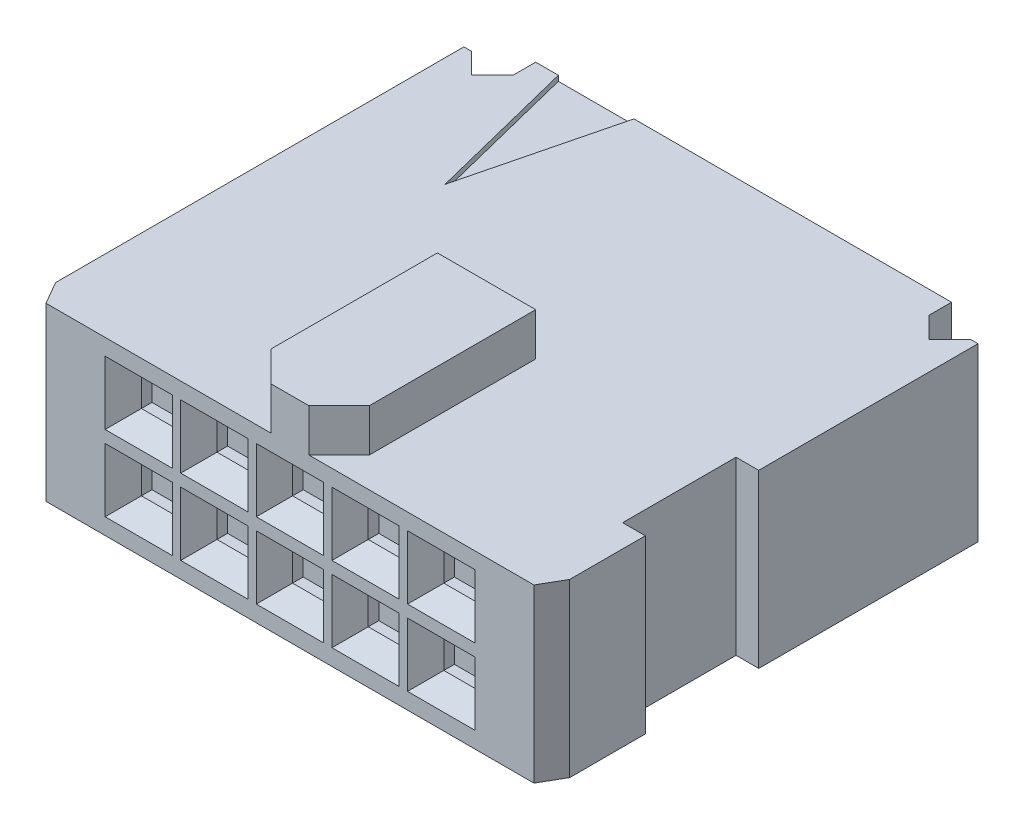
ISO-10303-21;
HEADER;
FILE_DESCRIPTION(('STEP AP214'),'2;1');
FILE_NAME('part.step','',(''),(''),'','','');
FILE_SCHEMA(('AUTOMOTIVE_DESIGN { 1 0 10303 214 1 1 1 1 }'));
ENDSEC;
DATA;
#1=APPLICATION_CONTEXT('core data for automotive mechanical design processes');
#2=APPLICATION_PROTOCOL_DEFINITION('international standard','automotive_design',2000,#1);
#3=PRODUCT_CONTEXT('',#1,'mechanical');
#4=PRODUCT('Part','Part','',(#3));
#5=PRODUCT_RELATED_PRODUCT_CATEGORY('part','',(#4));
#6=PRODUCT_DEFINITION_FORMATION('','',#4);
#7=PRODUCT_DEFINITION_CONTEXT('part definition',#1,'design');
#8=PRODUCT_DEFINITION('design','',#6,#7);
#9=PRODUCT_DEFINITION_SHAPE('','',#8);
#10=(LENGTH_UNIT() NAMED_UNIT(*) SI_UNIT(.MILLI.,.METRE.));
#11=(NAMED_UNIT(*) PLANE_ANGLE_UNIT() SI_UNIT($,.RADIAN.));
#12=(NAMED_UNIT(*) SI_UNIT($,.STERADIAN.) SOLID_ANGLE_UNIT());
#13=UNCERTAINTY_MEASURE_WITH_UNIT(LENGTH_MEASURE(1.E-05),#10,'distance_accuracy_value','');
#14=(GEOMETRIC_REPRESENTATION_CONTEXT(3) GLOBAL_UNCERTAINTY_ASSIGNED_CONTEXT((#13)) GLOBAL_UNIT_ASSIGNED_CONTEXT((#10,
#11,#12)) REPRESENTATION_CONTEXT('',''));
#15=CARTESIAN_POINT('',(0.,0.,0.));
#16=DIRECTION('',(0.,0.,1.));
#17=DIRECTION('',(1.,0.,0.));
#18=AXIS2_PLACEMENT_3D('',#15,#16,#17);
#19=CARTESIAN_POINT('',(-8.636,0.,-0.9906));
#20=DIRECTION('',(0.,0.,1.));
#21=DIRECTION('',(1.,0.,0.));
#22=AXIS2_PLACEMENT_3D('',#19,#20,#21);
#23=PLANE('',#22);
#24=DIRECTION('',(1.,0.,0.));
#25=VECTOR('',#24,1.);
#26=CARTESIAN_POINT('',(-5.08,1.7526,-0.9906));
#27=LINE('',#26,#25);
#28=CARTESIAN_POINT('',(-4.5339,1.7526,-0.9906));
#29=VERTEX_POINT('',#28);
#30=CARTESIAN_POINT('',(-5.6261,1.7526,-0.9906));
#31=VERTEX_POINT('',#30);
#32=EDGE_CURVE('E1045',#29,#31,#27,.F.);
#33=ORIENTED_EDGE('',*,*,#32,.T.);
#34=DIRECTION('',(0.,1.,0.));
#35=VECTOR('',#34,1.);
#36=CARTESIAN_POINT('',(-5.6261,1.27,-0.9906));
#37=LINE('',#36,#35);
#38=CARTESIAN_POINT('',(-5.6261,0.7874,-0.9906));
#39=VERTEX_POINT('',#38);
#40=EDGE_CURVE('E1035',#31,#39,#37,.F.);
#41=ORIENTED_EDGE('',*,*,#40,.T.);
#42=DIRECTION('',(1.,0.,0.));
#43=VECTOR('',#42,1.);
#44=CARTESIAN_POINT('',(-5.08,0.7874,-0.9906));
#45=LINE('',#44,#43);
#46=CARTESIAN_POINT('',(-4.5339,0.7874,-0.9906));
#47=VERTEX_POINT('',#46);
#48=EDGE_CURVE('E1039',#39,#47,#45,.T.);
#49=ORIENTED_EDGE('',*,*,#48,.T.);
#50=DIRECTION('',(0.,1.,0.));
#51=VECTOR('',#50,1.);
#52=CARTESIAN_POINT('',(-4.5339,1.27,-0.9906));
#53=LINE('',#52,#51);
#54=EDGE_CURVE('E1043',#47,#29,#53,.T.);
#55=ORIENTED_EDGE('',*,*,#54,.T.);
#56=EDGE_LOOP('',(#33,#41,#49,#55));
#57=FACE_BOUND('',#56,.T.);
#58=ADVANCED_FACE('F15',(#57),#23,.T.);
#59=CARTESIAN_POINT('',(-6.096,0.,-0.9906));
#60=DIRECTION('',(0.,0.,1.));
#61=DIRECTION('',(1.,0.,0.));
#62=AXIS2_PLACEMENT_3D('',#59,#60,#61);
#63=PLANE('',#62);
#64=DIRECTION('',(1.,0.,0.));
#65=VECTOR('',#64,1.);
#66=CARTESIAN_POINT('',(-2.54,1.7526,-0.9906));
#67=LINE('',#66,#65);
#68=CARTESIAN_POINT('',(-1.9939,1.7526,-0.9906));
#69=VERTEX_POINT('',#68);
#70=CARTESIAN_POINT('',(-3.0861,1.7526,-0.9906));
#71=VERTEX_POINT('',#70);
#72=EDGE_CURVE('E1028',#69,#71,#67,.F.);
#73=ORIENTED_EDGE('',*,*,#72,.T.);
#74=DIRECTION('',(0.,1.,0.));
#75=VECTOR('',#74,1.);
#76=CARTESIAN_POINT('',(-3.0861,1.27,-0.9906));
#77=LINE('',#76,#75);
#78=CARTESIAN_POINT('',(-3.0861,0.7874,-0.9906));
#79=VERTEX_POINT('',#78);
#80=EDGE_CURVE('E1018',#71,#79,#77,.F.);
#81=ORIENTED_EDGE('',*,*,#80,.T.);
#82=DIRECTION('',(1.,0.,0.));
#83=VECTOR('',#82,1.);
#84=CARTESIAN_POINT('',(-2.54,0.7874,-0.9906));
#85=LINE('',#84,#83);
#86=CARTESIAN_POINT('',(-1.9939,0.7874,-0.9906));
#87=VERTEX_POINT('',#86);
#88=EDGE_CURVE('E1022',#79,#87,#85,.T.);
#89=ORIENTED_EDGE('',*,*,#88,.T.);
#90=DIRECTION('',(0.,1.,0.));
#91=VECTOR('',#90,1.);
#92=CARTESIAN_POINT('',(-1.9939,1.27,-0.9906));
#93=LINE('',#92,#91);
#94=EDGE_CURVE('E1026',#87,#69,#93,.T.);
#95=ORIENTED_EDGE('',*,*,#94,.T.);
#96=EDGE_LOOP('',(#73,#81,#89,#95));
#97=FACE_BOUND('',#96,.T.);
#98=ADVANCED_FACE('F2468',(#97),#63,.T.);
#99=CARTESIAN_POINT('',(-3.556,0.,-0.9906));
#100=DIRECTION('',(0.,0.,1.));
#101=DIRECTION('',(1.,0.,0.));
#102=AXIS2_PLACEMENT_3D('',#99,#100,#101);
#103=PLANE('',#102);
#104=DIRECTION('',(1.,0.,0.));
#105=VECTOR('',#104,1.);
#106=CARTESIAN_POINT('',(0.,1.7526,-0.9906));
#107=LINE('',#106,#105);
#108=CARTESIAN_POINT('',(0.5461,1.7526,-0.9906));
#109=VERTEX_POINT('',#108);
#110=CARTESIAN_POINT('',(-0.5461,1.7526,-0.9906));
#111=VERTEX_POINT('',#110);
#112=EDGE_CURVE('E1011',#109,#111,#107,.F.);
#113=ORIENTED_EDGE('',*,*,#112,.T.);
#114=DIRECTION('',(0.,1.,0.));
#115=VECTOR('',#114,1.);
#116=CARTESIAN_POINT('',(-0.5461,1.27,-0.9906));
#117=LINE('',#116,#115);
#118=CARTESIAN_POINT('',(-0.5461,0.7874,-0.9906));
#119=VERTEX_POINT('',#118);
#120=EDGE_CURVE('E1001',#111,#119,#117,.F.);
#121=ORIENTED_EDGE('',*,*,#120,.T.);
#122=DIRECTION('',(1.,0.,0.));
#123=VECTOR('',#122,1.);
#124=CARTESIAN_POINT('',(0.,0.7874,-0.9906));
#125=LINE('',#124,#123);
#126=CARTESIAN_POINT('',(0.5461,0.7874,-0.9906));
#127=VERTEX_POINT('',#126);
#128=EDGE_CURVE('E1005',#119,#127,#125,.T.);
#129=ORIENTED_EDGE('',*,*,#128,.T.);
#130=DIRECTION('',(0.,1.,0.));
#131=VECTOR('',#130,1.);
#132=CARTESIAN_POINT('',(0.5461,1.27,-0.9906));
#133=LINE('',#132,#131);
#134=EDGE_CURVE('E1009',#127,#109,#133,.T.);
#135=ORIENTED_EDGE('',*,*,#134,.T.);
#136=EDGE_LOOP('',(#113,#121,#129,#135));
#137=FACE_BOUND('',#136,.T.);
#138=ADVANCED_FACE('F2470',(#137),#103,.T.);
#139=CARTESIAN_POINT('',(-1.016,0.,-0.9906));
#140=DIRECTION('',(0.,0.,1.));
#141=DIRECTION('',(1.,0.,0.));
#142=AXIS2_PLACEMENT_3D('',#139,#140,#141);
#143=PLANE('',#142);
#144=DIRECTION('',(1.,0.,0.));
#145=VECTOR('',#144,1.);
#146=CARTESIAN_POINT('',(2.54,1.7526,-0.9906));
#147=LINE('',#146,#145);
#148=CARTESIAN_POINT('',(3.0861,1.7526,-0.9906));
#149=VERTEX_POINT('',#148);
#150=CARTESIAN_POINT('',(1.9939,1.7526,-0.9906));
#151=VERTEX_POINT('',#150);
#152=EDGE_CURVE('E994',#149,#151,#147,.F.);
#153=ORIENTED_EDGE('',*,*,#152,.T.);
#154=DIRECTION('',(0.,1.,0.));
#155=VECTOR('',#154,1.);
#156=CARTESIAN_POINT('',(1.9939,1.27,-0.9906));
#157=LINE('',#156,#155);
#158=CARTESIAN_POINT('',(1.9939,0.7874,-0.9906));
#159=VERTEX_POINT('',#158);
#160=EDGE_CURVE('E984',#151,#159,#157,.F.);
#161=ORIENTED_EDGE('',*,*,#160,.T.);
#162=DIRECTION('',(1.,0.,0.));
#163=VECTOR('',#162,1.);
#164=CARTESIAN_POINT('',(2.54,0.7874,-0.9906));
#165=LINE('',#164,#163);
#166=CARTESIAN_POINT('',(3.0861,0.7874,-0.9906));
#167=VERTEX_POINT('',#166);
#168=EDGE_CURVE('E988',#159,#167,#165,.T.);
#169=ORIENTED_EDGE('',*,*,#168,.T.);
#170=DIRECTION('',(0.,1.,0.));
#171=VECTOR('',#170,1.);
#172=CARTESIAN_POINT('',(3.0861,1.27,-0.9906));
#173=LINE('',#172,#171);
#174=EDGE_CURVE('E992',#167,#149,#173,.T.);
#175=ORIENTED_EDGE('',*,*,#174,.T.);
#176=EDGE_LOOP('',(#153,#161,#169,#175));
#177=FACE_BOUND('',#176,.T.);
#178=ADVANCED_FACE('F2475',(#177),#143,.T.);
#179=CARTESIAN_POINT('',(1.524,0.,-0.9906));
#180=DIRECTION('',(0.,0.,1.));
#181=DIRECTION('',(1.,0.,0.));
#182=AXIS2_PLACEMENT_3D('',#179,#180,#181);
#183=PLANE('',#182);
#184=DIRECTION('',(1.,0.,0.));
#185=VECTOR('',#184,1.);
#186=CARTESIAN_POINT('',(5.08,1.7526,-0.9906));
#187=LINE('',#186,#185);
#188=CARTESIAN_POINT('',(5.6261,1.7526,-0.9906));
#189=VERTEX_POINT('',#188);
#190=CARTESIAN_POINT('',(4.5339,1.7526,-0.9906));
#191=VERTEX_POINT('',#190);
#192=EDGE_CURVE('E977',#189,#191,#187,.F.);
#193=ORIENTED_EDGE('',*,*,#192,.T.);
#194=DIRECTION('',(0.,1.,0.));
#195=VECTOR('',#194,1.);
#196=CARTESIAN_POINT('',(4.5339,1.27,-0.9906));
#197=LINE('',#196,#195);
#198=CARTESIAN_POINT('',(4.5339,0.7874,-0.9906));
#199=VERTEX_POINT('',#198);
#200=EDGE_CURVE('E967',#191,#199,#197,.F.);
#201=ORIENTED_EDGE('',*,*,#200,.T.);
#202=DIRECTION('',(1.,0.,0.));
#203=VECTOR('',#202,1.);
#204=CARTESIAN_POINT('',(5.08,0.7874,-0.9906));
#205=LINE('',#204,#203);
#206=CARTESIAN_POINT('',(5.6261,0.7874,-0.9906));
#207=VERTEX_POINT('',#206);
#208=EDGE_CURVE('E971',#199,#207,#205,.T.);
#209=ORIENTED_EDGE('',*,*,#208,.T.);
#210=DIRECTION('',(0.,1.,0.));
#211=VECTOR('',#210,1.);
#212=CARTESIAN_POINT('',(5.6261,1.27,-0.9906));
#213=LINE('',#212,#211);
#214=EDGE_CURVE('E975',#207,#189,#213,.T.);
#215=ORIENTED_EDGE('',*,*,#214,.T.);
#216=EDGE_LOOP('',(#193,#201,#209,#215));
#217=FACE_BOUND('',#216,.T.);
#218=ADVANCED_FACE('F2481',(#217),#183,.T.);
#219=CARTESIAN_POINT('',(-8.636,0.,-0.9906));
#220=DIRECTION('',(0.,0.,1.));
#221=DIRECTION('',(1.,0.,0.));
#222=AXIS2_PLACEMENT_3D('',#219,#220,#221);
#223=PLANE('',#222);
#224=DIRECTION('',(1.,0.,0.));
#225=VECTOR('',#224,1.);
#226=CARTESIAN_POINT('',(-5.08,-0.7874,-0.9906));
#227=LINE('',#226,#225);
#228=CARTESIAN_POINT('',(-4.5339,-0.7874,-0.9906));
#229=VERTEX_POINT('',#228);
#230=CARTESIAN_POINT('',(-5.6261,-0.7874,-0.9906));
#231=VERTEX_POINT('',#230);
#232=EDGE_CURVE('E960',#229,#231,#227,.F.);
#233=ORIENTED_EDGE('',*,*,#232,.T.);
#234=DIRECTION('',(0.,1.,0.));
#235=VECTOR('',#234,1.);
#236=CARTESIAN_POINT('',(-5.6261,-1.27,-0.9906));
#237=LINE('',#236,#235);
#238=CARTESIAN_POINT('',(-5.6261,-1.7526,-0.9906));
#239=VERTEX_POINT('',#238);
#240=EDGE_CURVE('E950',#231,#239,#237,.F.);
#241=ORIENTED_EDGE('',*,*,#240,.T.);
#242=DIRECTION('',(1.,0.,0.));
#243=VECTOR('',#242,1.);
#244=CARTESIAN_POINT('',(-5.08,-1.7526,-0.9906));
#245=LINE('',#244,#243);
#246=CARTESIAN_POINT('',(-4.5339,-1.7526,-0.9906));
#247=VERTEX_POINT('',#246);
#248=EDGE_CURVE('E954',#239,#247,#245,.T.);
#249=ORIENTED_EDGE('',*,*,#248,.T.);
#250=DIRECTION('',(0.,1.,0.));
#251=VECTOR('',#250,1.);
#252=CARTESIAN_POINT('',(-4.5339,-1.27,-0.9906));
#253=LINE('',#252,#251);
#254=EDGE_CURVE('E958',#247,#229,#253,.T.);
#255=ORIENTED_EDGE('',*,*,#254,.T.);
#256=EDGE_LOOP('',(#233,#241,#249,#255));
#257=FACE_BOUND('',#256,.T.);
#258=ADVANCED_FACE('F2485',(#257),#223,.T.);
#259=CARTESIAN_POINT('',(-8.636,0.,-0.9906));
#260=DIRECTION('',(0.,0.,1.));
#261=DIRECTION('',(1.,0.,0.));
#262=AXIS2_PLACEMENT_3D('',#259,#260,#261);
#263=PLANE('',#262);
#264=DIRECTION('',(1.,0.,0.));
#265=VECTOR('',#264,1.);
#266=CARTESIAN_POINT('',(-2.54,-0.7874,-0.9906));
#267=LINE('',#266,#265);
#268=CARTESIAN_POINT('',(-1.9939,-0.7874,-0.9906));
#269=VERTEX_POINT('',#268);
#270=CARTESIAN_POINT('',(-3.0861,-0.7874,-0.9906));
#271=VERTEX_POINT('',#270);
#272=EDGE_CURVE('E943',#269,#271,#267,.F.);
#273=ORIENTED_EDGE('',*,*,#272,.T.);
#274=DIRECTION('',(0.,1.,0.));
#275=VECTOR('',#274,1.);
#276=CARTESIAN_POINT('',(-3.0861,-1.27,-0.9906));
#277=LINE('',#276,#275);
#278=CARTESIAN_POINT('',(-3.0861,-1.7526,-0.9906));
#279=VERTEX_POINT('',#278);
#280=EDGE_CURVE('E933',#271,#279,#277,.F.);
#281=ORIENTED_EDGE('',*,*,#280,.T.);
#282=DIRECTION('',(1.,0.,0.));
#283=VECTOR('',#282,1.);
#284=CARTESIAN_POINT('',(-2.54,-1.7526,-0.9906));
#285=LINE('',#284,#283);
#286=CARTESIAN_POINT('',(-1.9939,-1.7526,-0.9906));
#287=VERTEX_POINT('',#286);
#288=EDGE_CURVE('E937',#279,#287,#285,.T.);
#289=ORIENTED_EDGE('',*,*,#288,.T.);
#290=DIRECTION('',(0.,1.,0.));
#291=VECTOR('',#290,1.);
#292=CARTESIAN_POINT('',(-1.9939,-1.27,-0.9906));
#293=LINE('',#292,#291);
#294=EDGE_CURVE('E941',#287,#269,#293,.T.);
#295=ORIENTED_EDGE('',*,*,#294,.T.);
#296=EDGE_LOOP('',(#273,#281,#289,#295));
#297=FACE_BOUND('',#296,.T.);
#298=ADVANCED_FACE('F2489',(#297),#263,.T.);
#299=CARTESIAN_POINT('',(-8.636,0.,-0.9906));
#300=DIRECTION('',(0.,0.,1.));
#301=DIRECTION('',(1.,0.,0.));
#302=AXIS2_PLACEMENT_3D('',#299,#300,#301);
#303=PLANE('',#302);
#304=DIRECTION('',(1.,0.,0.));
#305=VECTOR('',#304,1.);
#306=CARTESIAN_POINT('',(0.,-0.7874,-0.9906));
#307=LINE('',#306,#305);
#308=CARTESIAN_POINT('',(0.5461,-0.7874,-0.9906));
#309=VERTEX_POINT('',#308);
#310=CARTESIAN_POINT('',(-0.5461,-0.7874,-0.9906));
#311=VERTEX_POINT('',#310);
#312=EDGE_CURVE('E926',#309,#311,#307,.F.);
#313=ORIENTED_EDGE('',*,*,#312,.T.);
#314=DIRECTION('',(0.,1.,0.));
#315=VECTOR('',#314,1.);
#316=CARTESIAN_POINT('',(-0.5461,-1.27,-0.9906));
#317=LINE('',#316,#315);
#318=CARTESIAN_POINT('',(-0.5461,-1.7526,-0.9906));
#319=VERTEX_POINT('',#318);
#320=EDGE_CURVE('E916',#311,#319,#317,.F.);
#321=ORIENTED_EDGE('',*,*,#320,.T.);
#322=DIRECTION('',(1.,0.,0.));
#323=VECTOR('',#322,1.);
#324=CARTESIAN_POINT('',(0.,-1.7526,-0.9906));
#325=LINE('',#324,#323);
#326=CARTESIAN_POINT('',(0.5461,-1.7526,-0.9906));
#327=VERTEX_POINT('',#326);
#328=EDGE_CURVE('E920',#319,#327,#325,.T.);
#329=ORIENTED_EDGE('',*,*,#328,.T.);
#330=DIRECTION('',(0.,1.,0.));
#331=VECTOR('',#330,1.);
#332=CARTESIAN_POINT('',(0.5461,-1.27,-0.9906));
#333=LINE('',#332,#331);
#334=EDGE_CURVE('E924',#327,#309,#333,.T.);
#335=ORIENTED_EDGE('',*,*,#334,.T.);
#336=EDGE_LOOP('',(#313,#321,#329,#335));
#337=FACE_BOUND('',#336,.T.);
#338=ADVANCED_FACE('F2493',(#337),#303,.T.);
#339=CARTESIAN_POINT('',(-8.636,0.,-0.9906));
#340=DIRECTION('',(0.,0.,1.));
#341=DIRECTION('',(1.,0.,0.));
#342=AXIS2_PLACEMENT_3D('',#339,#340,#341);
#343=PLANE('',#342);
#344=DIRECTION('',(1.,0.,0.));
#345=VECTOR('',#344,1.);
#346=CARTESIAN_POINT('',(2.54,-0.7874,-0.9906));
#347=LINE('',#346,#345);
#348=CARTESIAN_POINT('',(3.0861,-0.7874,-0.9906));
#349=VERTEX_POINT('',#348);
#350=CARTESIAN_POINT('',(1.9939,-0.7874,-0.9906));
#351=VERTEX_POINT('',#350);
#352=EDGE_CURVE('E909',#349,#351,#347,.F.);
#353=ORIENTED_EDGE('',*,*,#352,.T.);
#354=DIRECTION('',(0.,1.,0.));
#355=VECTOR('',#354,1.);
#356=CARTESIAN_POINT('',(1.9939,-1.27,-0.9906));
#357=LINE('',#356,#355);
#358=CARTESIAN_POINT('',(1.9939,-1.7526,-0.9906));
#359=VERTEX_POINT('',#358);
#360=EDGE_CURVE('E899',#351,#359,#357,.F.);
#361=ORIENTED_EDGE('',*,*,#360,.T.);
#362=DIRECTION('',(1.,0.,0.));
#363=VECTOR('',#362,1.);
#364=CARTESIAN_POINT('',(2.54,-1.7526,-0.9906));
#365=LINE('',#364,#363);
#366=CARTESIAN_POINT('',(3.0861,-1.7526,-0.9906));
#367=VERTEX_POINT('',#366);
#368=EDGE_CURVE('E903',#359,#367,#365,.T.);
#369=ORIENTED_EDGE('',*,*,#368,.T.);
#370=DIRECTION('',(0.,1.,0.));
#371=VECTOR('',#370,1.);
#372=CARTESIAN_POINT('',(3.0861,-1.27,-0.9906));
#373=LINE('',#372,#371);
#374=EDGE_CURVE('E907',#367,#349,#373,.T.);
#375=ORIENTED_EDGE('',*,*,#374,.T.);
#376=EDGE_LOOP('',(#353,#361,#369,#375));
#377=FACE_BOUND('',#376,.T.);
#378=ADVANCED_FACE('F2497',(#377),#343,.T.);
#379=CARTESIAN_POINT('',(-8.636,0.,-0.9906));
#380=DIRECTION('',(0.,0.,1.));
#381=DIRECTION('',(1.,0.,0.));
#382=AXIS2_PLACEMENT_3D('',#379,#380,#381);
#383=PLANE('',#382);
#384=DIRECTION('',(1.,0.,0.));
#385=VECTOR('',#384,1.);
#386=CARTESIAN_POINT('',(5.08,-0.7874,-0.9906));
#387=LINE('',#386,#385);
#388=CARTESIAN_POINT('',(5.6261,-0.7874,-0.9906));
#389=VERTEX_POINT('',#388);
#390=CARTESIAN_POINT('',(4.5339,-0.7874,-0.9906));
#391=VERTEX_POINT('',#390);
#392=EDGE_CURVE('E892',#389,#391,#387,.F.);
#393=ORIENTED_EDGE('',*,*,#392,.T.);
#394=DIRECTION('',(0.,1.,0.));
#395=VECTOR('',#394,1.);
#396=CARTESIAN_POINT('',(4.5339,-1.27,-0.9906));
#397=LINE('',#396,#395);
#398=CARTESIAN_POINT('',(4.5339,-1.7526,-0.9906));
#399=VERTEX_POINT('',#398);
#400=EDGE_CURVE('E882',#391,#399,#397,.F.);
#401=ORIENTED_EDGE('',*,*,#400,.T.);
#402=DIRECTION('',(1.,0.,0.));
#403=VECTOR('',#402,1.);
#404=CARTESIAN_POINT('',(5.08,-1.7526,-0.9906));
#405=LINE('',#404,#403);
#406=CARTESIAN_POINT('',(5.6261,-1.7526,-0.9906));
#407=VERTEX_POINT('',#406);
#408=EDGE_CURVE('E886',#399,#407,#405,.T.);
#409=ORIENTED_EDGE('',*,*,#408,.T.);
#410=DIRECTION('',(0.,1.,0.));
#411=VECTOR('',#410,1.);
#412=CARTESIAN_POINT('',(5.6261,-1.27,-0.9906));
#413=LINE('',#412,#411);
#414=EDGE_CURVE('E890',#407,#389,#413,.T.);
#415=ORIENTED_EDGE('',*,*,#414,.T.);
#416=EDGE_LOOP('',(#393,#401,#409,#415));
#417=FACE_BOUND('',#416,.T.);
#418=ADVANCED_FACE('F2501',(#417),#383,.T.);
#419=CARTESIAN_POINT('',(-8.636,4.318,0.));
#420=DIRECTION('',(0.,1.,0.));
#421=DIRECTION('',(0.,0.,1.));
#422=AXIS2_PLACEMENT_3D('',#419,#420,#421);
#423=PLANE('',#422);
#424=DIRECTION('',(-1.,0.,0.));
#425=VECTOR('',#424,1.);
#426=CARTESIAN_POINT('',(1.651,4.318,-6.604));
#427=LINE('',#426,#425);
#428=CARTESIAN_POINT('',(-1.651,4.318,-6.604));
#429=VERTEX_POINT('',#428);
#430=CARTESIAN_POINT('',(1.651,4.318,-6.604));
#431=VERTEX_POINT('',#430);
#432=EDGE_CURVE('E819',#429,#431,#427,.F.);
#433=ORIENTED_EDGE('',*,*,#432,.F.);
#434=DIRECTION('',(0.,0.,1.));
#435=VECTOR('',#434,1.);
#436=CARTESIAN_POINT('',(-1.651,4.318,-6.604));
#437=LINE('',#436,#435);
#438=CARTESIAN_POINT('',(-1.651,4.318,-1.016));
#439=VERTEX_POINT('',#438);
#440=EDGE_CURVE('E816',#439,#429,#437,.F.);
#441=ORIENTED_EDGE('',*,*,#440,.F.);
#442=DIRECTION('',(0.707106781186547,0.,0.707106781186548));
#443=VECTOR('',#442,1.);
#444=CARTESIAN_POINT('',(-1.651,4.318,-1.016));
#445=LINE('',#444,#443);
#446=CARTESIAN_POINT('',(-0.635,4.318,0.));
#447=VERTEX_POINT('',#446);
#448=EDGE_CURVE('E18',#439,#447,#445,.T.);
#449=ORIENTED_EDGE('',*,*,#448,.T.);
#450=DIRECTION('',(1.,0.,0.));
#451=VECTOR('',#450,1.);
#452=CARTESIAN_POINT('',(-8.636,4.318,0.));
#453=LINE('',#452,#451);
#454=CARTESIAN_POINT('',(0.635000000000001,4.318,0.));
#455=VERTEX_POINT('',#454);
#456=EDGE_CURVE('E797',#447,#455,#453,.T.);
#457=ORIENTED_EDGE('',*,*,#456,.T.);
#458=DIRECTION('',(0.707106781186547,0.,-0.707106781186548));
#459=VECTOR('',#458,1.);
#460=CARTESIAN_POINT('',(0.635,4.318,0.));
#461=LINE('',#460,#459);
#462=CARTESIAN_POINT('',(1.651,4.318,-1.016));
#463=VERTEX_POINT('',#462);
#464=EDGE_CURVE('E791',#455,#463,#461,.T.);
#465=ORIENTED_EDGE('',*,*,#464,.T.);
#466=DIRECTION('',(0.,0.,-1.));
#467=VECTOR('',#466,1.);
#468=CARTESIAN_POINT('',(1.651,4.318,-1.016));
#469=LINE('',#468,#467);
#470=EDGE_CURVE('E848',#431,#463,#469,.F.);
#471=ORIENTED_EDGE('',*,*,#470,.F.);
#472=EDGE_LOOP('',(#433,#441,#449,#457,#465,#471));
#473=FACE_BOUND('',#472,.T.);
#474=ADVANCED_FACE('F815',(#473),#423,.T.);
#475=CARTESIAN_POINT('',(-5.08,1.7526,-0.8128));
#476=DIRECTION('',(0.,1.,0.));
#477=DIRECTION('',(0.,0.,1.));
#478=AXIS2_PLACEMENT_3D('',#475,#476,#477);
#479=PLANE('',#478);
#480=DIRECTION('',(1.,0.,0.));
#481=VECTOR('',#480,1.);
#482=CARTESIAN_POINT('',(-5.08,1.75259999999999,-0.634999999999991));
#483=LINE('',#482,#481);
#484=CARTESIAN_POINT('',(-4.5339,1.7526,-0.634999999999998));
#485=VERTEX_POINT('',#484);
#486=CARTESIAN_POINT('',(-5.6261,1.7526,-0.634999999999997));
#487=VERTEX_POINT('',#486);
#488=EDGE_CURVE('E830',#485,#487,#483,.F.);
#489=ORIENTED_EDGE('',*,*,#488,.T.);
#490=DIRECTION('',(0.,0.,1.));
#491=VECTOR('',#490,1.);
#492=CARTESIAN_POINT('',(-5.6261,1.7526,-0.8128));
#493=LINE('',#492,#491);
#494=EDGE_CURVE('E1030',#487,#31,#493,.F.);
#495=ORIENTED_EDGE('',*,*,#494,.T.);
#496=ORIENTED_EDGE('',*,*,#32,.F.);
#497=DIRECTION('',(0.,0.,-1.));
#498=VECTOR('',#497,1.);
#499=CARTESIAN_POINT('',(-4.5339,1.7526,-0.8128));
#500=LINE('',#499,#498);
#501=EDGE_CURVE('E1041',#29,#485,#500,.F.);
#502=ORIENTED_EDGE('',*,*,#501,.T.);
#503=EDGE_LOOP('',(#489,#495,#496,#502));
#504=FACE_BOUND('',#503,.T.);
#505=ADVANCED_FACE('F1846',(#504),#479,.F.);
#506=CARTESIAN_POINT('',(-4.5339,1.27,-0.8128));
#507=DIRECTION('',(1.,0.,0.));
#508=DIRECTION('',(0.,0.,-1.));
#509=AXIS2_PLACEMENT_3D('',#506,#507,#508);
#510=PLANE('',#509);
#511=DIRECTION('',(0.,1.,0.));
#512=VECTOR('',#511,1.);
#513=CARTESIAN_POINT('',(-4.53390000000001,1.27,-0.634999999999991));
#514=LINE('',#513,#512);
#515=CARTESIAN_POINT('',(-4.5339,0.787400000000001,-0.634999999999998));
#516=VERTEX_POINT('',#515);
#517=EDGE_CURVE('E833',#516,#485,#514,.T.);
#518=ORIENTED_EDGE('',*,*,#517,.T.);
#519=ORIENTED_EDGE('',*,*,#501,.F.);
#520=ORIENTED_EDGE('',*,*,#54,.F.);
#521=DIRECTION('',(0.,0.,-1.));
#522=VECTOR('',#521,1.);
#523=CARTESIAN_POINT('',(-4.5339,0.7874,-0.8128));
#524=LINE('',#523,#522);
#525=EDGE_CURVE('E1037',#47,#516,#524,.F.);
#526=ORIENTED_EDGE('',*,*,#525,.T.);
#527=EDGE_LOOP('',(#518,#519,#520,#526));
#528=FACE_BOUND('',#527,.T.);
#529=ADVANCED_FACE('F1476',(#528),#510,.F.);
#530=CARTESIAN_POINT('',(-5.08,0.7874,-0.8128));
#531=DIRECTION('',(0.,-1.,0.));
#532=DIRECTION('',(0.,0.,-1.));
#533=AXIS2_PLACEMENT_3D('',#530,#531,#532);
#534=PLANE('',#533);
#535=DIRECTION('',(1.,0.,0.));
#536=VECTOR('',#535,1.);
#537=CARTESIAN_POINT('',(-5.08,0.78740000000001,-0.634999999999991));
#538=LINE('',#537,#536);
#539=CARTESIAN_POINT('',(-5.6261,0.787400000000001,-0.634999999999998));
#540=VERTEX_POINT('',#539);
#541=EDGE_CURVE('E1467',#540,#516,#538,.T.);
#542=ORIENTED_EDGE('',*,*,#541,.T.);
#543=ORIENTED_EDGE('',*,*,#525,.F.);
#544=ORIENTED_EDGE('',*,*,#48,.F.);
#545=DIRECTION('',(0.,0.,1.));
#546=VECTOR('',#545,1.);
#547=CARTESIAN_POINT('',(-5.6261,0.7874,-0.8128));
#548=LINE('',#547,#546);
#549=EDGE_CURVE('E1033',#39,#540,#548,.T.);
#550=ORIENTED_EDGE('',*,*,#549,.T.);
#551=EDGE_LOOP('',(#542,#543,#544,#550));
#552=FACE_BOUND('',#551,.T.);
#553=ADVANCED_FACE('F1850',(#552),#534,.F.);
#554=CARTESIAN_POINT('',(-5.6261,1.27,-0.8128));
#555=DIRECTION('',(-1.,0.,0.));
#556=DIRECTION('',(0.,0.,1.));
#557=AXIS2_PLACEMENT_3D('',#554,#555,#556);
#558=PLANE('',#557);
#559=DIRECTION('',(0.,1.,0.));
#560=VECTOR('',#559,1.);
#561=CARTESIAN_POINT('',(-5.62609999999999,1.27,-0.634999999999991));
#562=LINE('',#561,#560);
#563=EDGE_CURVE('E1459',#487,#540,#562,.F.);
#564=ORIENTED_EDGE('',*,*,#563,.T.);
#565=ORIENTED_EDGE('',*,*,#549,.F.);
#566=ORIENTED_EDGE('',*,*,#40,.F.);
#567=ORIENTED_EDGE('',*,*,#494,.F.);
#568=EDGE_LOOP('',(#564,#565,#566,#567));
#569=FACE_BOUND('',#568,.T.);
#570=ADVANCED_FACE('F1843',(#569),#558,.F.);
#571=CARTESIAN_POINT('',(-2.54,1.7526,-0.8128));
#572=DIRECTION('',(0.,1.,0.));
#573=DIRECTION('',(0.,0.,1.));
#574=AXIS2_PLACEMENT_3D('',#571,#572,#573);
#575=PLANE('',#574);
#576=DIRECTION('',(1.,0.,0.));
#577=VECTOR('',#576,1.);
#578=CARTESIAN_POINT('',(-2.54,1.75259999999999,-0.634999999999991));
#579=LINE('',#578,#577);
#580=CARTESIAN_POINT('',(-1.9939,1.7526,-0.634999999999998));
#581=VERTEX_POINT('',#580);
#582=CARTESIAN_POINT('',(-3.0861,1.7526,-0.634999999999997));
#583=VERTEX_POINT('',#582);
#584=EDGE_CURVE('E1455',#581,#583,#579,.F.);
#585=ORIENTED_EDGE('',*,*,#584,.T.);
#586=DIRECTION('',(0.,0.,1.));
#587=VECTOR('',#586,1.);
#588=CARTESIAN_POINT('',(-3.0861,1.7526,-0.8128));
#589=LINE('',#588,#587);
#590=EDGE_CURVE('E1013',#583,#71,#589,.F.);
#591=ORIENTED_EDGE('',*,*,#590,.T.);
#592=ORIENTED_EDGE('',*,*,#72,.F.);
#593=DIRECTION('',(0.,0.,-1.));
#594=VECTOR('',#593,1.);
#595=CARTESIAN_POINT('',(-1.9939,1.7526,-0.8128));
#596=LINE('',#595,#594);
#597=EDGE_CURVE('E1024',#69,#581,#596,.F.);
#598=ORIENTED_EDGE('',*,*,#597,.T.);
#599=EDGE_LOOP('',(#585,#591,#592,#598));
#600=FACE_BOUND('',#599,.T.);
#601=ADVANCED_FACE('F1858',(#600),#575,.F.);
#602=CARTESIAN_POINT('',(-1.9939,1.27,-0.8128));
#603=DIRECTION('',(1.,0.,0.));
#604=DIRECTION('',(0.,0.,-1.));
#605=AXIS2_PLACEMENT_3D('',#602,#603,#604);
#606=PLANE('',#605);
#607=DIRECTION('',(0.,1.,0.));
#608=VECTOR('',#607,1.);
#609=CARTESIAN_POINT('',(-1.99390000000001,1.27,-0.634999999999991));
#610=LINE('',#609,#608);
#611=CARTESIAN_POINT('',(-1.9939,0.787400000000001,-0.634999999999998));
#612=VERTEX_POINT('',#611);
#613=EDGE_CURVE('E1452',#612,#581,#610,.T.);
#614=ORIENTED_EDGE('',*,*,#613,.T.);
#615=ORIENTED_EDGE('',*,*,#597,.F.);
#616=ORIENTED_EDGE('',*,*,#94,.F.);
#617=DIRECTION('',(0.,0.,-1.));
#618=VECTOR('',#617,1.);
#619=CARTESIAN_POINT('',(-1.9939,0.7874,-0.8128));
#620=LINE('',#619,#618);
#621=EDGE_CURVE('E1020',#87,#612,#620,.F.);
#622=ORIENTED_EDGE('',*,*,#621,.T.);
#623=EDGE_LOOP('',(#614,#615,#616,#622));
#624=FACE_BOUND('',#623,.T.);
#625=ADVANCED_FACE('F2439',(#624),#606,.F.);
#626=CARTESIAN_POINT('',(-2.54,0.7874,-0.8128));
#627=DIRECTION('',(0.,-1.,0.));
#628=DIRECTION('',(0.,0.,-1.));
#629=AXIS2_PLACEMENT_3D('',#626,#627,#628);
#630=PLANE('',#629);
#631=DIRECTION('',(1.,0.,0.));
#632=VECTOR('',#631,1.);
#633=CARTESIAN_POINT('',(-2.54,0.78740000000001,-0.634999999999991));
#634=LINE('',#633,#632);
#635=CARTESIAN_POINT('',(-3.0861,0.787400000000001,-0.634999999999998));
#636=VERTEX_POINT('',#635);
#637=EDGE_CURVE('E1447',#636,#612,#634,.T.);
#638=ORIENTED_EDGE('',*,*,#637,.T.);
#639=ORIENTED_EDGE('',*,*,#621,.F.);
#640=ORIENTED_EDGE('',*,*,#88,.F.);
#641=DIRECTION('',(0.,0.,1.));
#642=VECTOR('',#641,1.);
#643=CARTESIAN_POINT('',(-3.0861,0.7874,-0.8128));
#644=LINE('',#643,#642);
#645=EDGE_CURVE('E1016',#79,#636,#644,.T.);
#646=ORIENTED_EDGE('',*,*,#645,.T.);
#647=EDGE_LOOP('',(#638,#639,#640,#646));
#648=FACE_BOUND('',#647,.T.);
#649=ADVANCED_FACE('F2435',(#648),#630,.F.);
#650=CARTESIAN_POINT('',(-3.0861,1.27,-0.8128));
#651=DIRECTION('',(-1.,0.,0.));
#652=DIRECTION('',(0.,0.,1.));
#653=AXIS2_PLACEMENT_3D('',#650,#651,#652);
#654=PLANE('',#653);
#655=DIRECTION('',(0.,1.,0.));
#656=VECTOR('',#655,1.);
#657=CARTESIAN_POINT('',(-3.08609999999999,1.27,-0.634999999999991));
#658=LINE('',#657,#656);
#659=EDGE_CURVE('E1439',#583,#636,#658,.F.);
#660=ORIENTED_EDGE('',*,*,#659,.T.);
#661=ORIENTED_EDGE('',*,*,#645,.F.);
#662=ORIENTED_EDGE('',*,*,#80,.F.);
#663=ORIENTED_EDGE('',*,*,#590,.F.);
#664=EDGE_LOOP('',(#660,#661,#662,#663));
#665=FACE_BOUND('',#664,.T.);
#666=ADVANCED_FACE('F2431',(#665),#654,.F.);
#667=CARTESIAN_POINT('',(0.,1.7526,-0.8128));
#668=DIRECTION('',(0.,1.,0.));
#669=DIRECTION('',(0.,0.,1.));
#670=AXIS2_PLACEMENT_3D('',#667,#668,#669);
#671=PLANE('',#670);
#672=DIRECTION('',(1.,0.,0.));
#673=VECTOR('',#672,1.);
#674=CARTESIAN_POINT('',(0.,1.75259999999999,-0.634999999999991));
#675=LINE('',#674,#673);
#676=CARTESIAN_POINT('',(0.546099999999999,1.7526,-0.634999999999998));
#677=VERTEX_POINT('',#676);
#678=CARTESIAN_POINT('',(-0.546099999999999,1.7526,-0.634999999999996));
#679=VERTEX_POINT('',#678);
#680=EDGE_CURVE('E1435',#677,#679,#675,.F.);
#681=ORIENTED_EDGE('',*,*,#680,.T.);
#682=DIRECTION('',(0.,0.,1.));
#683=VECTOR('',#682,1.);
#684=CARTESIAN_POINT('',(-0.5461,1.7526,-0.8128));
#685=LINE('',#684,#683);
#686=EDGE_CURVE('E996',#679,#111,#685,.F.);
#687=ORIENTED_EDGE('',*,*,#686,.T.);
#688=ORIENTED_EDGE('',*,*,#112,.F.);
#689=DIRECTION('',(0.,0.,-1.));
#690=VECTOR('',#689,1.);
#691=CARTESIAN_POINT('',(0.5461,1.7526,-0.8128));
#692=LINE('',#691,#690);
#693=EDGE_CURVE('E1007',#109,#677,#692,.F.);
#694=ORIENTED_EDGE('',*,*,#693,.T.);
#695=EDGE_LOOP('',(#681,#687,#688,#694));
#696=FACE_BOUND('',#695,.T.);
#697=ADVANCED_FACE('F2427',(#696),#671,.F.);
#698=CARTESIAN_POINT('',(0.5461,1.27,-0.8128));
#699=DIRECTION('',(1.,0.,0.));
#700=DIRECTION('',(0.,0.,-1.));
#701=AXIS2_PLACEMENT_3D('',#698,#699,#700);
#702=PLANE('',#701);
#703=DIRECTION('',(0.,1.,0.));
#704=VECTOR('',#703,1.);
#705=CARTESIAN_POINT('',(0.54609999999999,1.27,-0.634999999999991));
#706=LINE('',#705,#704);
#707=CARTESIAN_POINT('',(0.546099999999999,0.787400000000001,-0.634999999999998));
#708=VERTEX_POINT('',#707);
#709=EDGE_CURVE('E1432',#708,#677,#706,.T.);
#710=ORIENTED_EDGE('',*,*,#709,.T.);
#711=ORIENTED_EDGE('',*,*,#693,.F.);
#712=ORIENTED_EDGE('',*,*,#134,.F.);
#713=DIRECTION('',(0.,0.,-1.));
#714=VECTOR('',#713,1.);
#715=CARTESIAN_POINT('',(0.5461,0.7874,-0.8128));
#716=LINE('',#715,#714);
#717=EDGE_CURVE('E1003',#127,#708,#716,.F.);
#718=ORIENTED_EDGE('',*,*,#717,.T.);
#719=EDGE_LOOP('',(#710,#711,#712,#718));
#720=FACE_BOUND('',#719,.T.);
#721=ADVANCED_FACE('F2423',(#720),#702,.F.);
#722=CARTESIAN_POINT('',(0.,0.7874,-0.8128));
#723=DIRECTION('',(0.,-1.,0.));
#724=DIRECTION('',(0.,0.,-1.));
#725=AXIS2_PLACEMENT_3D('',#722,#723,#724);
#726=PLANE('',#725);
#727=DIRECTION('',(1.,0.,0.));
#728=VECTOR('',#727,1.);
#729=CARTESIAN_POINT('',(0.,0.78740000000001,-0.634999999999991));
#730=LINE('',#729,#728);
#731=CARTESIAN_POINT('',(-0.546099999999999,0.787400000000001,-0.634999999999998));
#732=VERTEX_POINT('',#731);
#733=EDGE_CURVE('E1427',#732,#708,#730,.T.);
#734=ORIENTED_EDGE('',*,*,#733,.T.);
#735=ORIENTED_EDGE('',*,*,#717,.F.);
#736=ORIENTED_EDGE('',*,*,#128,.F.);
#737=DIRECTION('',(0.,0.,1.));
#738=VECTOR('',#737,1.);
#739=CARTESIAN_POINT('',(-0.5461,0.7874,-0.8128));
#740=LINE('',#739,#738);
#741=EDGE_CURVE('E999',#119,#732,#740,.T.);
#742=ORIENTED_EDGE('',*,*,#741,.T.);
#743=EDGE_LOOP('',(#734,#735,#736,#742));
#744=FACE_BOUND('',#743,.T.);
#745=ADVANCED_FACE('F2419',(#744),#726,.F.);
#746=CARTESIAN_POINT('',(-0.5461,1.27,-0.8128));
#747=DIRECTION('',(-1.,0.,0.));
#748=DIRECTION('',(0.,0.,1.));
#749=AXIS2_PLACEMENT_3D('',#746,#747,#748);
#750=PLANE('',#749);
#751=DIRECTION('',(0.,1.,0.));
#752=VECTOR('',#751,1.);
#753=CARTESIAN_POINT('',(-0.54609999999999,1.27,-0.634999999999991));
#754=LINE('',#753,#752);
#755=EDGE_CURVE('E1419',#679,#732,#754,.F.);
#756=ORIENTED_EDGE('',*,*,#755,.T.);
#757=ORIENTED_EDGE('',*,*,#741,.F.);
#758=ORIENTED_EDGE('',*,*,#120,.F.);
#759=ORIENTED_EDGE('',*,*,#686,.F.);
#760=EDGE_LOOP('',(#756,#757,#758,#759));
#761=FACE_BOUND('',#760,.T.);
#762=ADVANCED_FACE('F2415',(#761),#750,.F.);
#763=CARTESIAN_POINT('',(2.54,1.7526,-0.8128));
#764=DIRECTION('',(0.,1.,0.));
#765=DIRECTION('',(0.,0.,1.));
#766=AXIS2_PLACEMENT_3D('',#763,#764,#765);
#767=PLANE('',#766);
#768=DIRECTION('',(1.,0.,0.));
#769=VECTOR('',#768,1.);
#770=CARTESIAN_POINT('',(2.54,1.75259999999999,-0.634999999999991));
#771=LINE('',#770,#769);
#772=CARTESIAN_POINT('',(3.0861,1.7526,-0.634999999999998));
#773=VERTEX_POINT('',#772);
#774=CARTESIAN_POINT('',(1.9939,1.7526,-0.634999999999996));
#775=VERTEX_POINT('',#774);
#776=EDGE_CURVE('E1415',#773,#775,#771,.F.);
#777=ORIENTED_EDGE('',*,*,#776,.T.);
#778=DIRECTION('',(0.,0.,1.));
#779=VECTOR('',#778,1.);
#780=CARTESIAN_POINT('',(1.9939,1.7526,-0.8128));
#781=LINE('',#780,#779);
#782=EDGE_CURVE('E979',#775,#151,#781,.F.);
#783=ORIENTED_EDGE('',*,*,#782,.T.);
#784=ORIENTED_EDGE('',*,*,#152,.F.);
#785=DIRECTION('',(0.,0.,-1.));
#786=VECTOR('',#785,1.);
#787=CARTESIAN_POINT('',(3.0861,1.7526,-0.8128));
#788=LINE('',#787,#786);
#789=EDGE_CURVE('E990',#149,#773,#788,.F.);
#790=ORIENTED_EDGE('',*,*,#789,.T.);
#791=EDGE_LOOP('',(#777,#783,#784,#790));
#792=FACE_BOUND('',#791,.T.);
#793=ADVANCED_FACE('F2411',(#792),#767,.F.);
#794=CARTESIAN_POINT('',(3.0861,1.27,-0.8128));
#795=DIRECTION('',(1.,0.,0.));
#796=DIRECTION('',(0.,0.,-1.));
#797=AXIS2_PLACEMENT_3D('',#794,#795,#796);
#798=PLANE('',#797);
#799=DIRECTION('',(0.,1.,0.));
#800=VECTOR('',#799,1.);
#801=CARTESIAN_POINT('',(3.08609999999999,1.27,-0.634999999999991));
#802=LINE('',#801,#800);
#803=CARTESIAN_POINT('',(3.0861,0.787400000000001,-0.634999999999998));
#804=VERTEX_POINT('',#803);
#805=EDGE_CURVE('E1412',#804,#773,#802,.T.);
#806=ORIENTED_EDGE('',*,*,#805,.T.);
#807=ORIENTED_EDGE('',*,*,#789,.F.);
#808=ORIENTED_EDGE('',*,*,#174,.F.);
#809=DIRECTION('',(0.,0.,-1.));
#810=VECTOR('',#809,1.);
#811=CARTESIAN_POINT('',(3.0861,0.7874,-0.8128));
#812=LINE('',#811,#810);
#813=EDGE_CURVE('E986',#167,#804,#812,.F.);
#814=ORIENTED_EDGE('',*,*,#813,.T.);
#815=EDGE_LOOP('',(#806,#807,#808,#814));
#816=FACE_BOUND('',#815,.T.);
#817=ADVANCED_FACE('F2407',(#816),#798,.F.);
#818=CARTESIAN_POINT('',(2.54,0.7874,-0.8128));
#819=DIRECTION('',(0.,-1.,0.));
#820=DIRECTION('',(0.,0.,-1.));
#821=AXIS2_PLACEMENT_3D('',#818,#819,#820);
#822=PLANE('',#821);
#823=DIRECTION('',(1.,0.,0.));
#824=VECTOR('',#823,1.);
#825=CARTESIAN_POINT('',(2.54,0.78740000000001,-0.634999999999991));
#826=LINE('',#825,#824);
#827=CARTESIAN_POINT('',(1.9939,0.787400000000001,-0.634999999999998));
#828=VERTEX_POINT('',#827);
#829=EDGE_CURVE('E1407',#828,#804,#826,.T.);
#830=ORIENTED_EDGE('',*,*,#829,.T.);
#831=ORIENTED_EDGE('',*,*,#813,.F.);
#832=ORIENTED_EDGE('',*,*,#168,.F.);
#833=DIRECTION('',(0.,0.,1.));
#834=VECTOR('',#833,1.);
#835=CARTESIAN_POINT('',(1.9939,0.7874,-0.8128));
#836=LINE('',#835,#834);
#837=EDGE_CURVE('E982',#159,#828,#836,.T.);
#838=ORIENTED_EDGE('',*,*,#837,.T.);
#839=EDGE_LOOP('',(#830,#831,#832,#838));
#840=FACE_BOUND('',#839,.T.);
#841=ADVANCED_FACE('F2403',(#840),#822,.F.);
#842=CARTESIAN_POINT('',(1.9939,1.27,-0.8128));
#843=DIRECTION('',(-1.,0.,0.));
#844=DIRECTION('',(0.,0.,1.));
#845=AXIS2_PLACEMENT_3D('',#842,#843,#844);
#846=PLANE('',#845);
#847=DIRECTION('',(0.,1.,0.));
#848=VECTOR('',#847,1.);
#849=CARTESIAN_POINT('',(1.99390000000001,1.27,-0.634999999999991));
#850=LINE('',#849,#848);
#851=EDGE_CURVE('E1399',#775,#828,#850,.F.);
#852=ORIENTED_EDGE('',*,*,#851,.T.);
#853=ORIENTED_EDGE('',*,*,#837,.F.);
#854=ORIENTED_EDGE('',*,*,#160,.F.);
#855=ORIENTED_EDGE('',*,*,#782,.F.);
#856=EDGE_LOOP('',(#852,#853,#854,#855));
#857=FACE_BOUND('',#856,.T.);
#858=ADVANCED_FACE('F2399',(#857),#846,.F.);
#859=CARTESIAN_POINT('',(5.08,1.7526,-0.8128));
#860=DIRECTION('',(0.,1.,0.));
#861=DIRECTION('',(0.,0.,1.));
#862=AXIS2_PLACEMENT_3D('',#859,#860,#861);
#863=PLANE('',#862);
#864=DIRECTION('',(1.,0.,0.));
#865=VECTOR('',#864,1.);
#866=CARTESIAN_POINT('',(5.08,1.75259999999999,-0.634999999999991));
#867=LINE('',#866,#865);
#868=CARTESIAN_POINT('',(5.6261,1.7526,-0.634999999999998));
#869=VERTEX_POINT('',#868);
#870=CARTESIAN_POINT('',(4.5339,1.7526,-0.634999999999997));
#871=VERTEX_POINT('',#870);
#872=EDGE_CURVE('E1395',#869,#871,#867,.F.);
#873=ORIENTED_EDGE('',*,*,#872,.T.);
#874=DIRECTION('',(0.,0.,1.));
#875=VECTOR('',#874,1.);
#876=CARTESIAN_POINT('',(4.5339,1.7526,-0.8128));
#877=LINE('',#876,#875);
#878=EDGE_CURVE('E962',#871,#191,#877,.F.);
#879=ORIENTED_EDGE('',*,*,#878,.T.);
#880=ORIENTED_EDGE('',*,*,#192,.F.);
#881=DIRECTION('',(0.,0.,-1.));
#882=VECTOR('',#881,1.);
#883=CARTESIAN_POINT('',(5.6261,1.7526,-0.8128));
#884=LINE('',#883,#882);
#885=EDGE_CURVE('E973',#189,#869,#884,.F.);
#886=ORIENTED_EDGE('',*,*,#885,.T.);
#887=EDGE_LOOP('',(#873,#879,#880,#886));
#888=FACE_BOUND('',#887,.T.);
#889=ADVANCED_FACE('F2395',(#888),#863,.F.);
#890=CARTESIAN_POINT('',(5.6261,1.27,-0.8128));
#891=DIRECTION('',(1.,0.,0.));
#892=DIRECTION('',(0.,0.,-1.));
#893=AXIS2_PLACEMENT_3D('',#890,#891,#892);
#894=PLANE('',#893);
#895=DIRECTION('',(0.,1.,0.));
#896=VECTOR('',#895,1.);
#897=CARTESIAN_POINT('',(5.62609999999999,1.27,-0.634999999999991));
#898=LINE('',#897,#896);
#899=CARTESIAN_POINT('',(5.6261,0.787400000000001,-0.634999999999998));
#900=VERTEX_POINT('',#899);
#901=EDGE_CURVE('E1392',#900,#869,#898,.T.);
#902=ORIENTED_EDGE('',*,*,#901,.T.);
#903=ORIENTED_EDGE('',*,*,#885,.F.);
#904=ORIENTED_EDGE('',*,*,#214,.F.);
#905=DIRECTION('',(0.,0.,-1.));
#906=VECTOR('',#905,1.);
#907=CARTESIAN_POINT('',(5.6261,0.7874,-0.8128));
#908=LINE('',#907,#906);
#909=EDGE_CURVE('E969',#207,#900,#908,.F.);
#910=ORIENTED_EDGE('',*,*,#909,.T.);
#911=EDGE_LOOP('',(#902,#903,#904,#910));
#912=FACE_BOUND('',#911,.T.);
#913=ADVANCED_FACE('F2391',(#912),#894,.F.);
#914=CARTESIAN_POINT('',(5.08,0.7874,-0.8128));
#915=DIRECTION('',(0.,-1.,0.));
#916=DIRECTION('',(0.,0.,-1.));
#917=AXIS2_PLACEMENT_3D('',#914,#915,#916);
#918=PLANE('',#917);
#919=DIRECTION('',(1.,0.,0.));
#920=VECTOR('',#919,1.);
#921=CARTESIAN_POINT('',(5.08,0.78740000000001,-0.634999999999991));
#922=LINE('',#921,#920);
#923=CARTESIAN_POINT('',(4.5339,0.787400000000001,-0.634999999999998));
#924=VERTEX_POINT('',#923);
#925=EDGE_CURVE('E1387',#924,#900,#922,.T.);
#926=ORIENTED_EDGE('',*,*,#925,.T.);
#927=ORIENTED_EDGE('',*,*,#909,.F.);
#928=ORIENTED_EDGE('',*,*,#208,.F.);
#929=DIRECTION('',(0.,0.,1.));
#930=VECTOR('',#929,1.);
#931=CARTESIAN_POINT('',(4.5339,0.7874,-0.8128));
#932=LINE('',#931,#930);
#933=EDGE_CURVE('E965',#199,#924,#932,.T.);
#934=ORIENTED_EDGE('',*,*,#933,.T.);
#935=EDGE_LOOP('',(#926,#927,#928,#934));
#936=FACE_BOUND('',#935,.T.);
#937=ADVANCED_FACE('F2387',(#936),#918,.F.);
#938=CARTESIAN_POINT('',(4.5339,1.27,-0.8128));
#939=DIRECTION('',(-1.,0.,0.));
#940=DIRECTION('',(0.,0.,1.));
#941=AXIS2_PLACEMENT_3D('',#938,#939,#940);
#942=PLANE('',#941);
#943=DIRECTION('',(0.,1.,0.));
#944=VECTOR('',#943,1.);
#945=CARTESIAN_POINT('',(4.53390000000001,1.27,-0.634999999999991));
#946=LINE('',#945,#944);
#947=EDGE_CURVE('E1379',#871,#924,#946,.F.);
#948=ORIENTED_EDGE('',*,*,#947,.T.);
#949=ORIENTED_EDGE('',*,*,#933,.F.);
#950=ORIENTED_EDGE('',*,*,#200,.F.);
#951=ORIENTED_EDGE('',*,*,#878,.F.);
#952=EDGE_LOOP('',(#948,#949,#950,#951));
#953=FACE_BOUND('',#952,.T.);
#954=ADVANCED_FACE('F2383',(#953),#942,.F.);
#955=CARTESIAN_POINT('',(-5.08,-0.7874,-0.8128));
#956=DIRECTION('',(0.,1.,0.));
#957=DIRECTION('',(0.,0.,1.));
#958=AXIS2_PLACEMENT_3D('',#955,#956,#957);
#959=PLANE('',#958);
#960=DIRECTION('',(1.,0.,0.));
#961=VECTOR('',#960,1.);
#962=CARTESIAN_POINT('',(-5.08,-0.78740000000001,-0.634999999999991));
#963=LINE('',#962,#961);
#964=CARTESIAN_POINT('',(-4.5339,-0.787400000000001,-0.634999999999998));
#965=VERTEX_POINT('',#964);
#966=CARTESIAN_POINT('',(-5.6261,-0.787400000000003,-0.634999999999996));
#967=VERTEX_POINT('',#966);
#968=EDGE_CURVE('E1375',#965,#967,#963,.F.);
#969=ORIENTED_EDGE('',*,*,#968,.T.);
#970=DIRECTION('',(0.,0.,1.));
#971=VECTOR('',#970,1.);
#972=CARTESIAN_POINT('',(-5.6261,-0.7874,-0.8128));
#973=LINE('',#972,#971);
#974=EDGE_CURVE('E945',#967,#231,#973,.F.);
#975=ORIENTED_EDGE('',*,*,#974,.T.);
#976=ORIENTED_EDGE('',*,*,#232,.F.);
#977=DIRECTION('',(0.,0.,-1.));
#978=VECTOR('',#977,1.);
#979=CARTESIAN_POINT('',(-4.5339,-0.7874,-0.8128));
#980=LINE('',#979,#978);
#981=EDGE_CURVE('E956',#229,#965,#980,.F.);
#982=ORIENTED_EDGE('',*,*,#981,.T.);
#983=EDGE_LOOP('',(#969,#975,#976,#982));
#984=FACE_BOUND('',#983,.T.);
#985=ADVANCED_FACE('F2379',(#984),#959,.F.);
#986=CARTESIAN_POINT('',(-4.5339,-1.27,-0.8128));
#987=DIRECTION('',(1.,0.,0.));
#988=DIRECTION('',(0.,0.,-1.));
#989=AXIS2_PLACEMENT_3D('',#986,#987,#988);
#990=PLANE('',#989);
#991=DIRECTION('',(0.,1.,0.));
#992=VECTOR('',#991,1.);
#993=CARTESIAN_POINT('',(-4.53390000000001,-1.27,-0.634999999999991));
#994=LINE('',#993,#992);
#995=CARTESIAN_POINT('',(-4.5339,-1.7526,-0.634999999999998));
#996=VERTEX_POINT('',#995);
#997=EDGE_CURVE('E1372',#996,#965,#994,.T.);
#998=ORIENTED_EDGE('',*,*,#997,.T.);
#999=ORIENTED_EDGE('',*,*,#981,.F.);
#1000=ORIENTED_EDGE('',*,*,#254,.F.);
#1001=DIRECTION('',(0.,0.,-1.));
#1002=VECTOR('',#1001,1.);
#1003=CARTESIAN_POINT('',(-4.5339,-1.7526,-0.8128));
#1004=LINE('',#1003,#1002);
#1005=EDGE_CURVE('E952',#247,#996,#1004,.F.);
#1006=ORIENTED_EDGE('',*,*,#1005,.T.);
#1007=EDGE_LOOP('',(#998,#999,#1000,#1006));
#1008=FACE_BOUND('',#1007,.T.);
#1009=ADVANCED_FACE('F2375',(#1008),#990,.F.);
#1010=CARTESIAN_POINT('',(-5.08,-1.7526,-0.8128));
#1011=DIRECTION('',(0.,-1.,0.));
#1012=DIRECTION('',(0.,0.,-1.));
#1013=AXIS2_PLACEMENT_3D('',#1010,#1011,#1012);
#1014=PLANE('',#1013);
#1015=DIRECTION('',(1.,0.,0.));
#1016=VECTOR('',#1015,1.);
#1017=CARTESIAN_POINT('',(-5.08,-1.75259999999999,-0.634999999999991));
#1018=LINE('',#1017,#1016);
#1019=CARTESIAN_POINT('',(-5.6261,-1.7526,-0.634999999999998));
#1020=VERTEX_POINT('',#1019);
#1021=EDGE_CURVE('E1367',#1020,#996,#1018,.T.);
#1022=ORIENTED_EDGE('',*,*,#1021,.T.);
#1023=ORIENTED_EDGE('',*,*,#1005,.F.);
#1024=ORIENTED_EDGE('',*,*,#248,.F.);
#1025=DIRECTION('',(0.,0.,1.));
#1026=VECTOR('',#1025,1.);
#1027=CARTESIAN_POINT('',(-5.6261,-1.7526,-0.8128));
#1028=LINE('',#1027,#1026);
#1029=EDGE_CURVE('E948',#239,#1020,#1028,.T.);
#1030=ORIENTED_EDGE('',*,*,#1029,.T.);
#1031=EDGE_LOOP('',(#1022,#1023,#1024,#1030));
#1032=FACE_BOUND('',#1031,.T.);
#1033=ADVANCED_FACE('F2371',(#1032),#1014,.F.);
#1034=CARTESIAN_POINT('',(-5.6261,-1.27,-0.8128));
#1035=DIRECTION('',(-1.,0.,0.));
#1036=DIRECTION('',(0.,0.,1.));
#1037=AXIS2_PLACEMENT_3D('',#1034,#1035,#1036);
#1038=PLANE('',#1037);
#1039=DIRECTION('',(0.,1.,0.));
#1040=VECTOR('',#1039,1.);
#1041=CARTESIAN_POINT('',(-5.62609999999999,-1.27,-0.634999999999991));
#1042=LINE('',#1041,#1040);
#1043=EDGE_CURVE('E1359',#967,#1020,#1042,.F.);
#1044=ORIENTED_EDGE('',*,*,#1043,.T.);
#1045=ORIENTED_EDGE('',*,*,#1029,.F.);
#1046=ORIENTED_EDGE('',*,*,#240,.F.);
#1047=ORIENTED_EDGE('',*,*,#974,.F.);
#1048=EDGE_LOOP('',(#1044,#1045,#1046,#1047));
#1049=FACE_BOUND('',#1048,.T.);
#1050=ADVANCED_FACE('F2367',(#1049),#1038,.F.);
#1051=CARTESIAN_POINT('',(-2.54,-0.7874,-0.8128));
#1052=DIRECTION('',(0.,1.,0.));
#1053=DIRECTION('',(0.,0.,1.));
#1054=AXIS2_PLACEMENT_3D('',#1051,#1052,#1053);
#1055=PLANE('',#1054);
#1056=DIRECTION('',(1.,0.,0.));
#1057=VECTOR('',#1056,1.);
#1058=CARTESIAN_POINT('',(-2.54,-0.78740000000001,-0.634999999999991));
#1059=LINE('',#1058,#1057);
#1060=CARTESIAN_POINT('',(-1.9939,-0.787400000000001,-0.634999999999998));
#1061=VERTEX_POINT('',#1060);
#1062=CARTESIAN_POINT('',(-3.0861,-0.787400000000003,-0.634999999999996));
#1063=VERTEX_POINT('',#1062);
#1064=EDGE_CURVE('E1355',#1061,#1063,#1059,.F.);
#1065=ORIENTED_EDGE('',*,*,#1064,.T.);
#1066=DIRECTION('',(0.,0.,1.));
#1067=VECTOR('',#1066,1.);
#1068=CARTESIAN_POINT('',(-3.0861,-0.7874,-0.8128));
#1069=LINE('',#1068,#1067);
#1070=EDGE_CURVE('E928',#1063,#271,#1069,.F.);
#1071=ORIENTED_EDGE('',*,*,#1070,.T.);
#1072=ORIENTED_EDGE('',*,*,#272,.F.);
#1073=DIRECTION('',(0.,0.,-1.));
#1074=VECTOR('',#1073,1.);
#1075=CARTESIAN_POINT('',(-1.9939,-0.7874,-0.8128));
#1076=LINE('',#1075,#1074);
#1077=EDGE_CURVE('E939',#269,#1061,#1076,.F.);
#1078=ORIENTED_EDGE('',*,*,#1077,.T.);
#1079=EDGE_LOOP('',(#1065,#1071,#1072,#1078));
#1080=FACE_BOUND('',#1079,.T.);
#1081=ADVANCED_FACE('F2363',(#1080),#1055,.F.);
#1082=CARTESIAN_POINT('',(-1.9939,-1.27,-0.8128));
#1083=DIRECTION('',(1.,0.,0.));
#1084=DIRECTION('',(0.,0.,-1.));
#1085=AXIS2_PLACEMENT_3D('',#1082,#1083,#1084);
#1086=PLANE('',#1085);
#1087=DIRECTION('',(0.,1.,0.));
#1088=VECTOR('',#1087,1.);
#1089=CARTESIAN_POINT('',(-1.99390000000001,-1.27,-0.634999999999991));
#1090=LINE('',#1089,#1088);
#1091=CARTESIAN_POINT('',(-1.9939,-1.7526,-0.634999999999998));
#1092=VERTEX_POINT('',#1091);
#1093=EDGE_CURVE('E1352',#1092,#1061,#1090,.T.);
#1094=ORIENTED_EDGE('',*,*,#1093,.T.);
#1095=ORIENTED_EDGE('',*,*,#1077,.F.);
#1096=ORIENTED_EDGE('',*,*,#294,.F.);
#1097=DIRECTION('',(0.,0.,-1.));
#1098=VECTOR('',#1097,1.);
#1099=CARTESIAN_POINT('',(-1.9939,-1.7526,-0.8128));
#1100=LINE('',#1099,#1098);
#1101=EDGE_CURVE('E935',#287,#1092,#1100,.F.);
#1102=ORIENTED_EDGE('',*,*,#1101,.T.);
#1103=EDGE_LOOP('',(#1094,#1095,#1096,#1102));
#1104=FACE_BOUND('',#1103,.T.);
#1105=ADVANCED_FACE('F2359',(#1104),#1086,.F.);
#1106=CARTESIAN_POINT('',(-2.54,-1.7526,-0.8128));
#1107=DIRECTION('',(0.,-1.,0.));
#1108=DIRECTION('',(0.,0.,-1.));
#1109=AXIS2_PLACEMENT_3D('',#1106,#1107,#1108);
#1110=PLANE('',#1109);
#1111=DIRECTION('',(1.,0.,0.));
#1112=VECTOR('',#1111,1.);
#1113=CARTESIAN_POINT('',(-2.54,-1.75259999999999,-0.634999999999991));
#1114=LINE('',#1113,#1112);
#1115=CARTESIAN_POINT('',(-3.0861,-1.7526,-0.634999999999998));
#1116=VERTEX_POINT('',#1115);
#1117=EDGE_CURVE('E1347',#1116,#1092,#1114,.T.);
#1118=ORIENTED_EDGE('',*,*,#1117,.T.);
#1119=ORIENTED_EDGE('',*,*,#1101,.F.);
#1120=ORIENTED_EDGE('',*,*,#288,.F.);
#1121=DIRECTION('',(0.,0.,1.));
#1122=VECTOR('',#1121,1.);
#1123=CARTESIAN_POINT('',(-3.0861,-1.7526,-0.8128));
#1124=LINE('',#1123,#1122);
#1125=EDGE_CURVE('E931',#279,#1116,#1124,.T.);
#1126=ORIENTED_EDGE('',*,*,#1125,.T.);
#1127=EDGE_LOOP('',(#1118,#1119,#1120,#1126));
#1128=FACE_BOUND('',#1127,.T.);
#1129=ADVANCED_FACE('F2355',(#1128),#1110,.F.);
#1130=CARTESIAN_POINT('',(-3.0861,-1.27,-0.8128));
#1131=DIRECTION('',(-1.,0.,0.));
#1132=DIRECTION('',(0.,0.,1.));
#1133=AXIS2_PLACEMENT_3D('',#1130,#1131,#1132);
#1134=PLANE('',#1133);
#1135=DIRECTION('',(0.,1.,0.));
#1136=VECTOR('',#1135,1.);
#1137=CARTESIAN_POINT('',(-3.08609999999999,-1.27,-0.634999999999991));
#1138=LINE('',#1137,#1136);
#1139=EDGE_CURVE('E1339',#1063,#1116,#1138,.F.);
#1140=ORIENTED_EDGE('',*,*,#1139,.T.);
#1141=ORIENTED_EDGE('',*,*,#1125,.F.);
#1142=ORIENTED_EDGE('',*,*,#280,.F.);
#1143=ORIENTED_EDGE('',*,*,#1070,.F.);
#1144=EDGE_LOOP('',(#1140,#1141,#1142,#1143));
#1145=FACE_BOUND('',#1144,.T.);
#1146=ADVANCED_FACE('F2351',(#1145),#1134,.F.);
#1147=CARTESIAN_POINT('',(0.,-0.7874,-0.8128));
#1148=DIRECTION('',(0.,1.,0.));
#1149=DIRECTION('',(0.,0.,1.));
#1150=AXIS2_PLACEMENT_3D('',#1147,#1148,#1149);
#1151=PLANE('',#1150);
#1152=DIRECTION('',(1.,0.,0.));
#1153=VECTOR('',#1152,1.);
#1154=CARTESIAN_POINT('',(0.,-0.78740000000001,-0.634999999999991));
#1155=LINE('',#1154,#1153);
#1156=CARTESIAN_POINT('',(0.546099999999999,-0.787400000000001,-0.634999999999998));
#1157=VERTEX_POINT('',#1156);
#1158=CARTESIAN_POINT('',(-0.546099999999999,-0.787400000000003,-0.634999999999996));
#1159=VERTEX_POINT('',#1158);
#1160=EDGE_CURVE('E1335',#1157,#1159,#1155,.F.);
#1161=ORIENTED_EDGE('',*,*,#1160,.T.);
#1162=DIRECTION('',(0.,0.,1.));
#1163=VECTOR('',#1162,1.);
#1164=CARTESIAN_POINT('',(-0.5461,-0.7874,-0.8128));
#1165=LINE('',#1164,#1163);
#1166=EDGE_CURVE('E911',#1159,#311,#1165,.F.);
#1167=ORIENTED_EDGE('',*,*,#1166,.T.);
#1168=ORIENTED_EDGE('',*,*,#312,.F.);
#1169=DIRECTION('',(0.,0.,-1.));
#1170=VECTOR('',#1169,1.);
#1171=CARTESIAN_POINT('',(0.5461,-0.7874,-0.8128));
#1172=LINE('',#1171,#1170);
#1173=EDGE_CURVE('E922',#309,#1157,#1172,.F.);
#1174=ORIENTED_EDGE('',*,*,#1173,.T.);
#1175=EDGE_LOOP('',(#1161,#1167,#1168,#1174));
#1176=FACE_BOUND('',#1175,.T.);
#1177=ADVANCED_FACE('F2347',(#1176),#1151,.F.);
#1178=CARTESIAN_POINT('',(0.5461,-1.27,-0.8128));
#1179=DIRECTION('',(1.,0.,0.));
#1180=DIRECTION('',(0.,0.,-1.));
#1181=AXIS2_PLACEMENT_3D('',#1178,#1179,#1180);
#1182=PLANE('',#1181);
#1183=DIRECTION('',(0.,1.,0.));
#1184=VECTOR('',#1183,1.);
#1185=CARTESIAN_POINT('',(0.54609999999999,-1.27,-0.634999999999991));
#1186=LINE('',#1185,#1184);
#1187=CARTESIAN_POINT('',(0.546099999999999,-1.7526,-0.634999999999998));
#1188=VERTEX_POINT('',#1187);
#1189=EDGE_CURVE('E1332',#1188,#1157,#1186,.T.);
#1190=ORIENTED_EDGE('',*,*,#1189,.T.);
#1191=ORIENTED_EDGE('',*,*,#1173,.F.);
#1192=ORIENTED_EDGE('',*,*,#334,.F.);
#1193=DIRECTION('',(0.,0.,-1.));
#1194=VECTOR('',#1193,1.);
#1195=CARTESIAN_POINT('',(0.5461,-1.7526,-0.8128));
#1196=LINE('',#1195,#1194);
#1197=EDGE_CURVE('E918',#327,#1188,#1196,.F.);
#1198=ORIENTED_EDGE('',*,*,#1197,.T.);
#1199=EDGE_LOOP('',(#1190,#1191,#1192,#1198));
#1200=FACE_BOUND('',#1199,.T.);
#1201=ADVANCED_FACE('F2343',(#1200),#1182,.F.);
#1202=CARTESIAN_POINT('',(0.,-1.7526,-0.8128));
#1203=DIRECTION('',(0.,-1.,0.));
#1204=DIRECTION('',(0.,0.,-1.));
#1205=AXIS2_PLACEMENT_3D('',#1202,#1203,#1204);
#1206=PLANE('',#1205);
#1207=DIRECTION('',(1.,0.,0.));
#1208=VECTOR('',#1207,1.);
#1209=CARTESIAN_POINT('',(0.,-1.75259999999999,-0.634999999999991));
#1210=LINE('',#1209,#1208);
#1211=CARTESIAN_POINT('',(-0.546099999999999,-1.7526,-0.634999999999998));
#1212=VERTEX_POINT('',#1211);
#1213=EDGE_CURVE('E1327',#1212,#1188,#1210,.T.);
#1214=ORIENTED_EDGE('',*,*,#1213,.T.);
#1215=ORIENTED_EDGE('',*,*,#1197,.F.);
#1216=ORIENTED_EDGE('',*,*,#328,.F.);
#1217=DIRECTION('',(0.,0.,1.));
#1218=VECTOR('',#1217,1.);
#1219=CARTESIAN_POINT('',(-0.5461,-1.7526,-0.8128));
#1220=LINE('',#1219,#1218);
#1221=EDGE_CURVE('E914',#319,#1212,#1220,.T.);
#1222=ORIENTED_EDGE('',*,*,#1221,.T.);
#1223=EDGE_LOOP('',(#1214,#1215,#1216,#1222));
#1224=FACE_BOUND('',#1223,.T.);
#1225=ADVANCED_FACE('F2339',(#1224),#1206,.F.);
#1226=CARTESIAN_POINT('',(-0.5461,-1.27,-0.8128));
#1227=DIRECTION('',(-1.,0.,0.));
#1228=DIRECTION('',(0.,0.,1.));
#1229=AXIS2_PLACEMENT_3D('',#1226,#1227,#1228);
#1230=PLANE('',#1229);
#1231=DIRECTION('',(0.,1.,0.));
#1232=VECTOR('',#1231,1.);
#1233=CARTESIAN_POINT('',(-0.54609999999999,-1.27,-0.634999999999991));
#1234=LINE('',#1233,#1232);
#1235=EDGE_CURVE('E1319',#1159,#1212,#1234,.F.);
#1236=ORIENTED_EDGE('',*,*,#1235,.T.);
#1237=ORIENTED_EDGE('',*,*,#1221,.F.);
#1238=ORIENTED_EDGE('',*,*,#320,.F.);
#1239=ORIENTED_EDGE('',*,*,#1166,.F.);
#1240=EDGE_LOOP('',(#1236,#1237,#1238,#1239));
#1241=FACE_BOUND('',#1240,.T.);
#1242=ADVANCED_FACE('F2335',(#1241),#1230,.F.);
#1243=CARTESIAN_POINT('',(2.54,-0.7874,-0.8128));
#1244=DIRECTION('',(0.,1.,0.));
#1245=DIRECTION('',(0.,0.,1.));
#1246=AXIS2_PLACEMENT_3D('',#1243,#1244,#1245);
#1247=PLANE('',#1246);
#1248=DIRECTION('',(1.,0.,0.));
#1249=VECTOR('',#1248,1.);
#1250=CARTESIAN_POINT('',(2.54,-0.78740000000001,-0.634999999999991));
#1251=LINE('',#1250,#1249);
#1252=CARTESIAN_POINT('',(3.0861,-0.787400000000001,-0.634999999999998));
#1253=VERTEX_POINT('',#1252);
#1254=CARTESIAN_POINT('',(1.9939,-0.787400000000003,-0.634999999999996));
#1255=VERTEX_POINT('',#1254);
#1256=EDGE_CURVE('E1315',#1253,#1255,#1251,.F.);
#1257=ORIENTED_EDGE('',*,*,#1256,.T.);
#1258=DIRECTION('',(0.,0.,1.));
#1259=VECTOR('',#1258,1.);
#1260=CARTESIAN_POINT('',(1.9939,-0.7874,-0.8128));
#1261=LINE('',#1260,#1259);
#1262=EDGE_CURVE('E894',#1255,#351,#1261,.F.);
#1263=ORIENTED_EDGE('',*,*,#1262,.T.);
#1264=ORIENTED_EDGE('',*,*,#352,.F.);
#1265=DIRECTION('',(0.,0.,-1.));
#1266=VECTOR('',#1265,1.);
#1267=CARTESIAN_POINT('',(3.0861,-0.7874,-0.8128));
#1268=LINE('',#1267,#1266);
#1269=EDGE_CURVE('E905',#349,#1253,#1268,.F.);
#1270=ORIENTED_EDGE('',*,*,#1269,.T.);
#1271=EDGE_LOOP('',(#1257,#1263,#1264,#1270));
#1272=FACE_BOUND('',#1271,.T.);
#1273=ADVANCED_FACE('F2331',(#1272),#1247,.F.);
#1274=CARTESIAN_POINT('',(3.0861,-1.27,-0.8128));
#1275=DIRECTION('',(1.,0.,0.));
#1276=DIRECTION('',(0.,0.,-1.));
#1277=AXIS2_PLACEMENT_3D('',#1274,#1275,#1276);
#1278=PLANE('',#1277);
#1279=DIRECTION('',(0.,1.,0.));
#1280=VECTOR('',#1279,1.);
#1281=CARTESIAN_POINT('',(3.08609999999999,-1.27,-0.634999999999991));
#1282=LINE('',#1281,#1280);
#1283=CARTESIAN_POINT('',(3.0861,-1.7526,-0.634999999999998));
#1284=VERTEX_POINT('',#1283);
#1285=EDGE_CURVE('E1312',#1284,#1253,#1282,.T.);
#1286=ORIENTED_EDGE('',*,*,#1285,.T.);
#1287=ORIENTED_EDGE('',*,*,#1269,.F.);
#1288=ORIENTED_EDGE('',*,*,#374,.F.);
#1289=DIRECTION('',(0.,0.,-1.));
#1290=VECTOR('',#1289,1.);
#1291=CARTESIAN_POINT('',(3.0861,-1.7526,-0.8128));
#1292=LINE('',#1291,#1290);
#1293=EDGE_CURVE('E901',#367,#1284,#1292,.F.);
#1294=ORIENTED_EDGE('',*,*,#1293,.T.);
#1295=EDGE_LOOP('',(#1286,#1287,#1288,#1294));
#1296=FACE_BOUND('',#1295,.T.);
#1297=ADVANCED_FACE('F2327',(#1296),#1278,.F.);
#1298=CARTESIAN_POINT('',(2.54,-1.7526,-0.8128));
#1299=DIRECTION('',(0.,-1.,0.));
#1300=DIRECTION('',(0.,0.,-1.));
#1301=AXIS2_PLACEMENT_3D('',#1298,#1299,#1300);
#1302=PLANE('',#1301);
#1303=DIRECTION('',(1.,0.,0.));
#1304=VECTOR('',#1303,1.);
#1305=CARTESIAN_POINT('',(2.54,-1.75259999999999,-0.634999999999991));
#1306=LINE('',#1305,#1304);
#1307=CARTESIAN_POINT('',(1.9939,-1.7526,-0.634999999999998));
#1308=VERTEX_POINT('',#1307);
#1309=EDGE_CURVE('E1307',#1308,#1284,#1306,.T.);
#1310=ORIENTED_EDGE('',*,*,#1309,.T.);
#1311=ORIENTED_EDGE('',*,*,#1293,.F.);
#1312=ORIENTED_EDGE('',*,*,#368,.F.);
#1313=DIRECTION('',(0.,0.,1.));
#1314=VECTOR('',#1313,1.);
#1315=CARTESIAN_POINT('',(1.9939,-1.7526,-0.8128));
#1316=LINE('',#1315,#1314);
#1317=EDGE_CURVE('E897',#359,#1308,#1316,.T.);
#1318=ORIENTED_EDGE('',*,*,#1317,.T.);
#1319=EDGE_LOOP('',(#1310,#1311,#1312,#1318));
#1320=FACE_BOUND('',#1319,.T.);
#1321=ADVANCED_FACE('F2323',(#1320),#1302,.F.);
#1322=CARTESIAN_POINT('',(1.9939,-1.27,-0.8128));
#1323=DIRECTION('',(-1.,0.,0.));
#1324=DIRECTION('',(0.,0.,1.));
#1325=AXIS2_PLACEMENT_3D('',#1322,#1323,#1324);
#1326=PLANE('',#1325);
#1327=DIRECTION('',(0.,1.,0.));
#1328=VECTOR('',#1327,1.);
#1329=CARTESIAN_POINT('',(1.99390000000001,-1.27,-0.634999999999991));
#1330=LINE('',#1329,#1328);
#1331=EDGE_CURVE('E1299',#1255,#1308,#1330,.F.);
#1332=ORIENTED_EDGE('',*,*,#1331,.T.);
#1333=ORIENTED_EDGE('',*,*,#1317,.F.);
#1334=ORIENTED_EDGE('',*,*,#360,.F.);
#1335=ORIENTED_EDGE('',*,*,#1262,.F.);
#1336=EDGE_LOOP('',(#1332,#1333,#1334,#1335));
#1337=FACE_BOUND('',#1336,.T.);
#1338=ADVANCED_FACE('F2319',(#1337),#1326,.F.);
#1339=CARTESIAN_POINT('',(5.08,-0.7874,-0.8128));
#1340=DIRECTION('',(0.,1.,0.));
#1341=DIRECTION('',(0.,0.,1.));
#1342=AXIS2_PLACEMENT_3D('',#1339,#1340,#1341);
#1343=PLANE('',#1342);
#1344=DIRECTION('',(1.,0.,0.));
#1345=VECTOR('',#1344,1.);
#1346=CARTESIAN_POINT('',(5.08,-0.78740000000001,-0.634999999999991));
#1347=LINE('',#1346,#1345);
#1348=CARTESIAN_POINT('',(5.6261,-0.787400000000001,-0.634999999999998));
#1349=VERTEX_POINT('',#1348);
#1350=CARTESIAN_POINT('',(4.5339,-0.787400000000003,-0.634999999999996));
#1351=VERTEX_POINT('',#1350);
#1352=EDGE_CURVE('E1295',#1349,#1351,#1347,.F.);
#1353=ORIENTED_EDGE('',*,*,#1352,.T.);
#1354=DIRECTION('',(0.,0.,1.));
#1355=VECTOR('',#1354,1.);
#1356=CARTESIAN_POINT('',(4.5339,-0.7874,-0.8128));
#1357=LINE('',#1356,#1355);
#1358=EDGE_CURVE('E877',#1351,#391,#1357,.F.);
#1359=ORIENTED_EDGE('',*,*,#1358,.T.);
#1360=ORIENTED_EDGE('',*,*,#392,.F.);
#1361=DIRECTION('',(0.,0.,-1.));
#1362=VECTOR('',#1361,1.);
#1363=CARTESIAN_POINT('',(5.6261,-0.7874,-0.8128));
#1364=LINE('',#1363,#1362);
#1365=EDGE_CURVE('E888',#389,#1349,#1364,.F.);
#1366=ORIENTED_EDGE('',*,*,#1365,.T.);
#1367=EDGE_LOOP('',(#1353,#1359,#1360,#1366));
#1368=FACE_BOUND('',#1367,.T.);
#1369=ADVANCED_FACE('F2315',(#1368),#1343,.F.);
#1370=CARTESIAN_POINT('',(5.6261,-1.27,-0.8128));
#1371=DIRECTION('',(1.,0.,0.));
#1372=DIRECTION('',(0.,0.,-1.));
#1373=AXIS2_PLACEMENT_3D('',#1370,#1371,#1372);
#1374=PLANE('',#1373);
#1375=DIRECTION('',(0.,1.,0.));
#1376=VECTOR('',#1375,1.);
#1377=CARTESIAN_POINT('',(5.62609999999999,-1.27,-0.634999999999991));
#1378=LINE('',#1377,#1376);
#1379=CARTESIAN_POINT('',(5.6261,-1.7526,-0.634999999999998));
#1380=VERTEX_POINT('',#1379);
#1381=EDGE_CURVE('E1292',#1380,#1349,#1378,.T.);
#1382=ORIENTED_EDGE('',*,*,#1381,.T.);
#1383=ORIENTED_EDGE('',*,*,#1365,.F.);
#1384=ORIENTED_EDGE('',*,*,#414,.F.);
#1385=DIRECTION('',(0.,0.,-1.));
#1386=VECTOR('',#1385,1.);
#1387=CARTESIAN_POINT('',(5.6261,-1.7526,-0.8128));
#1388=LINE('',#1387,#1386);
#1389=EDGE_CURVE('E884',#407,#1380,#1388,.F.);
#1390=ORIENTED_EDGE('',*,*,#1389,.T.);
#1391=EDGE_LOOP('',(#1382,#1383,#1384,#1390));
#1392=FACE_BOUND('',#1391,.T.);
#1393=ADVANCED_FACE('F2311',(#1392),#1374,.F.);
#1394=CARTESIAN_POINT('',(5.08,-1.7526,-0.8128));
#1395=DIRECTION('',(0.,-1.,0.));
#1396=DIRECTION('',(0.,0.,-1.));
#1397=AXIS2_PLACEMENT_3D('',#1394,#1395,#1396);
#1398=PLANE('',#1397);
#1399=DIRECTION('',(1.,0.,0.));
#1400=VECTOR('',#1399,1.);
#1401=CARTESIAN_POINT('',(5.08,-1.75259999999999,-0.634999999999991));
#1402=LINE('',#1401,#1400);
#1403=CARTESIAN_POINT('',(4.5339,-1.7526,-0.634999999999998));
#1404=VERTEX_POINT('',#1403);
#1405=EDGE_CURVE('E1287',#1404,#1380,#1402,.T.);
#1406=ORIENTED_EDGE('',*,*,#1405,.T.);
#1407=ORIENTED_EDGE('',*,*,#1389,.F.);
#1408=ORIENTED_EDGE('',*,*,#408,.F.);
#1409=DIRECTION('',(0.,0.,1.));
#1410=VECTOR('',#1409,1.);
#1411=CARTESIAN_POINT('',(4.5339,-1.7526,-0.8128));
#1412=LINE('',#1411,#1410);
#1413=EDGE_CURVE('E880',#399,#1404,#1412,.T.);
#1414=ORIENTED_EDGE('',*,*,#1413,.T.);
#1415=EDGE_LOOP('',(#1406,#1407,#1408,#1414));
#1416=FACE_BOUND('',#1415,.T.);
#1417=ADVANCED_FACE('F2307',(#1416),#1398,.F.);
#1418=CARTESIAN_POINT('',(4.5339,-1.27,-0.8128));
#1419=DIRECTION('',(-1.,0.,0.));
#1420=DIRECTION('',(0.,0.,1.));
#1421=AXIS2_PLACEMENT_3D('',#1418,#1419,#1420);
#1422=PLANE('',#1421);
#1423=DIRECTION('',(0.,1.,0.));
#1424=VECTOR('',#1423,1.);
#1425=CARTESIAN_POINT('',(4.53390000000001,-1.27,-0.634999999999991));
#1426=LINE('',#1425,#1424);
#1427=EDGE_CURVE('E1279',#1351,#1404,#1426,.F.);
#1428=ORIENTED_EDGE('',*,*,#1427,.T.);
#1429=ORIENTED_EDGE('',*,*,#1413,.F.);
#1430=ORIENTED_EDGE('',*,*,#400,.F.);
#1431=ORIENTED_EDGE('',*,*,#1358,.F.);
#1432=EDGE_LOOP('',(#1428,#1429,#1430,#1431));
#1433=FACE_BOUND('',#1432,.T.);
#1434=ADVANCED_FACE('F2303',(#1433),#1422,.F.);
#1435=CARTESIAN_POINT('',(-8.382,2.8829,-14.478));
#1436=DIRECTION('',(-0.707106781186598,0.,0.707106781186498));
#1437=DIRECTION('',(0.707106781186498,0.,0.707106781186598));
#1438=AXIS2_PLACEMENT_3D('',#1435,#1436,#1437);
#1439=PLANE('',#1438);
#1440=DIRECTION('',(0.707106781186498,0.,0.707106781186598));
#1441=VECTOR('',#1440,1.);
#1442=CARTESIAN_POINT('',(-8.382,2.8829,-14.478));
#1443=LINE('',#1442,#1441);
#1444=CARTESIAN_POINT('',(-7.68350000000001,2.8829,-13.7795));
#1445=VERTEX_POINT('',#1444);
#1446=CARTESIAN_POINT('',(-8.382,2.8829,-14.478));
#1447=VERTEX_POINT('',#1446);
#1448=EDGE_CURVE('E873',#1445,#1447,#1443,.F.);
#1449=ORIENTED_EDGE('',*,*,#1448,.F.);
#1450=DIRECTION('',(0.,1.,0.));
#1451=VECTOR('',#1450,1.);
#1452=CARTESIAN_POINT('',(-7.6835,2.8829,-13.7795));
#1453=LINE('',#1452,#1451);
#1454=CARTESIAN_POINT('',(-7.68350000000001,-2.8829,-13.7795));
#1455=VERTEX_POINT('',#1454);
#1456=EDGE_CURVE('E862',#1445,#1455,#1453,.F.);
#1457=ORIENTED_EDGE('',*,*,#1456,.T.);
#1458=DIRECTION('',(0.707106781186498,0.,0.707106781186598));
#1459=VECTOR('',#1458,1.);
#1460=CARTESIAN_POINT('',(-8.382,-2.8829,-14.478));
#1461=LINE('',#1460,#1459);
#1462=CARTESIAN_POINT('',(-8.382,-2.8829,-14.478));
#1463=VERTEX_POINT('',#1462);
#1464=EDGE_CURVE('E875',#1463,#1455,#1461,.T.);
#1465=ORIENTED_EDGE('',*,*,#1464,.F.);
#1466=DIRECTION('',(0.,1.,0.));
#1467=VECTOR('',#1466,1.);
#1468=CARTESIAN_POINT('',(-8.382,2.8829,-14.478));
#1469=LINE('',#1468,#1467);
#1470=EDGE_CURVE('E1272',#1463,#1447,#1469,.T.);
#1471=ORIENTED_EDGE('',*,*,#1470,.T.);
#1472=EDGE_LOOP('',(#1449,#1457,#1465,#1471));
#1473=FACE_BOUND('',#1472,.T.);
#1474=ADVANCED_FACE('F2299',(#1473),#1439,.F.);
#1475=CARTESIAN_POINT('',(6.985,2.8829,-14.478));
#1476=DIRECTION('',(-0.707106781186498,0.,0.707106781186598));
#1477=DIRECTION('',(0.707106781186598,0.,0.707106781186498));
#1478=AXIS2_PLACEMENT_3D('',#1475,#1476,#1477);
#1479=PLANE('',#1478);
#1480=DIRECTION('',(0.707106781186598,0.,0.707106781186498));
#1481=VECTOR('',#1480,1.);
#1482=CARTESIAN_POINT('',(6.985,2.8829,-14.478));
#1483=LINE('',#1482,#1481);
#1484=CARTESIAN_POINT('',(7.68350000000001,2.8829,-13.7795));
#1485=VERTEX_POINT('',#1484);
#1486=CARTESIAN_POINT('',(6.985,2.8829,-14.478));
#1487=VERTEX_POINT('',#1486);
#1488=EDGE_CURVE('E869',#1485,#1487,#1483,.F.);
#1489=ORIENTED_EDGE('',*,*,#1488,.F.);
#1490=DIRECTION('',(0.,1.,0.));
#1491=VECTOR('',#1490,1.);
#1492=CARTESIAN_POINT('',(7.6835,2.8829,-13.7795));
#1493=LINE('',#1492,#1491);
#1494=CARTESIAN_POINT('',(7.68350000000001,-2.8829,-13.7795));
#1495=VERTEX_POINT('',#1494);
#1496=EDGE_CURVE('E823',#1485,#1495,#1493,.F.);
#1497=ORIENTED_EDGE('',*,*,#1496,.T.);
#1498=DIRECTION('',(0.707106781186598,0.,0.707106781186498));
#1499=VECTOR('',#1498,1.);
#1500=CARTESIAN_POINT('',(6.985,-2.8829,-14.478));
#1501=LINE('',#1500,#1499);
#1502=CARTESIAN_POINT('',(6.985,-2.8829,-14.478));
#1503=VERTEX_POINT('',#1502);
#1504=EDGE_CURVE('E871',#1503,#1495,#1501,.T.);
#1505=ORIENTED_EDGE('',*,*,#1504,.F.);
#1506=DIRECTION('',(0.,1.,0.));
#1507=VECTOR('',#1506,1.);
#1508=CARTESIAN_POINT('',(6.985,2.8829,-14.478));
#1509=LINE('',#1508,#1507);
#1510=EDGE_CURVE('E1259',#1503,#1487,#1509,.T.);
#1511=ORIENTED_EDGE('',*,*,#1510,.T.);
#1512=EDGE_LOOP('',(#1489,#1497,#1505,#1511));
#1513=FACE_BOUND('',#1512,.T.);
#1514=ADVANCED_FACE('F2295',(#1513),#1479,.F.);
#1515=CARTESIAN_POINT('',(-7.6835,2.8829,-13.7795));
#1516=DIRECTION('',(0.707106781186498,0.,0.707106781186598));
#1517=DIRECTION('',(0.707106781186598,0.,-0.707106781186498));
#1518=AXIS2_PLACEMENT_3D('',#1515,#1516,#1517);
#1519=PLANE('',#1518);
#1520=DIRECTION('',(0.707106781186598,0.,-0.707106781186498));
#1521=VECTOR('',#1520,1.);
#1522=CARTESIAN_POINT('',(-7.6835,2.8829,-13.7795));
#1523=LINE('',#1522,#1521);
#1524=CARTESIAN_POINT('',(-6.98499999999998,2.8829,-14.478));
#1525=VERTEX_POINT('',#1524);
#1526=EDGE_CURVE('E865',#1525,#1445,#1523,.F.);
#1527=ORIENTED_EDGE('',*,*,#1526,.F.);
#1528=DIRECTION('',(0.,1.,0.));
#1529=VECTOR('',#1528,1.);
#1530=CARTESIAN_POINT('',(-6.985,2.8829,-14.478));
#1531=LINE('',#1530,#1529);
#1532=CARTESIAN_POINT('',(-6.98499999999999,-2.8829,-14.478));
#1533=VERTEX_POINT('',#1532);
#1534=EDGE_CURVE('E1254',#1525,#1533,#1531,.F.);
#1535=ORIENTED_EDGE('',*,*,#1534,.T.);
#1536=DIRECTION('',(0.707106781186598,0.,-0.707106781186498));
#1537=VECTOR('',#1536,1.);
#1538=CARTESIAN_POINT('',(-7.6835,-2.8829,-13.7795));
#1539=LINE('',#1538,#1537);
#1540=EDGE_CURVE('E867',#1455,#1533,#1539,.T.);
#1541=ORIENTED_EDGE('',*,*,#1540,.F.);
#1542=ORIENTED_EDGE('',*,*,#1456,.F.);
#1543=EDGE_LOOP('',(#1527,#1535,#1541,#1542));
#1544=FACE_BOUND('',#1543,.T.);
#1545=ADVANCED_FACE('F2291',(#1544),#1519,.F.);
#1546=CARTESIAN_POINT('',(0.,0.,-14.740001));
#1547=DIRECTION('',(0.,0.,-1.));
#1548=DIRECTION('',(-1.,0.,0.));
#1549=AXIS2_PLACEMENT_3D('',#1546,#1547,#1548);
#1550=PLANE('',#1549);
#1551=DIRECTION('',(0.,1.,0.));
#1552=VECTOR('',#1551,1.);
#1553=CARTESIAN_POINT('',(-4.1656,-0.3556,-14.740001));
#1554=LINE('',#1553,#1552);
#1555=CARTESIAN_POINT('',(-4.1656,-0.3556,-14.740001));
#1556=VERTEX_POINT('',#1555);
#1557=CARTESIAN_POINT('',(-4.1656,-2.1844,-14.740001));
#1558=VERTEX_POINT('',#1557);
#1559=EDGE_CURVE('E1252',#1556,#1558,#1554,.F.);
#1560=ORIENTED_EDGE('',*,*,#1559,.T.);
#1561=DIRECTION('',(1.,0.,0.));
#1562=VECTOR('',#1561,1.);
#1563=CARTESIAN_POINT('',(-4.1656,-2.1844,-14.740001));
#1564=LINE('',#1563,#1562);
#1565=CARTESIAN_POINT('',(-5.9944,-2.1844,-14.740001));
#1566=VERTEX_POINT('',#1565);
#1567=EDGE_CURVE('E1239',#1558,#1566,#1564,.F.);
#1568=ORIENTED_EDGE('',*,*,#1567,.T.);
#1569=DIRECTION('',(0.,1.,0.));
#1570=VECTOR('',#1569,1.);
#1571=CARTESIAN_POINT('',(-5.9944,-2.1844,-14.740001));
#1572=LINE('',#1571,#1570);
#1573=CARTESIAN_POINT('',(-5.9944,-0.3556,-14.740001));
#1574=VERTEX_POINT('',#1573);
#1575=EDGE_CURVE('E1246',#1566,#1574,#1572,.T.);
#1576=ORIENTED_EDGE('',*,*,#1575,.T.);
#1577=DIRECTION('',(1.,0.,0.));
#1578=VECTOR('',#1577,1.);
#1579=CARTESIAN_POINT('',(-5.9944,-0.3556,-14.740001));
#1580=LINE('',#1579,#1578);
#1581=EDGE_CURVE('E1250',#1574,#1556,#1580,.T.);
#1582=ORIENTED_EDGE('',*,*,#1581,.T.);
#1583=EDGE_LOOP('',(#1560,#1568,#1576,#1582));
#1584=FACE_BOUND('',#1583,.T.);
#1585=ADVANCED_FACE('F2287',(#1584),#1550,.T.);
#1586=CARTESIAN_POINT('',(0.,0.,-14.740001));
#1587=DIRECTION('',(0.,0.,-1.));
#1588=DIRECTION('',(-1.,0.,0.));
#1589=AXIS2_PLACEMENT_3D('',#1586,#1587,#1588);
#1590=PLANE('',#1589);
#1591=DIRECTION('',(1.,0.,0.));
#1592=VECTOR('',#1591,1.);
#1593=CARTESIAN_POINT('',(-5.9944,2.1844,-14.740001));
#1594=LINE('',#1593,#1592);
#1595=CARTESIAN_POINT('',(-5.9944,2.1844,-14.740001));
#1596=VERTEX_POINT('',#1595);
#1597=CARTESIAN_POINT('',(-4.1656,2.1844,-14.740001));
#1598=VERTEX_POINT('',#1597);
#1599=EDGE_CURVE('E1233',#1596,#1598,#1594,.T.);
#1600=ORIENTED_EDGE('',*,*,#1599,.T.);
#1601=DIRECTION('',(0.,1.,0.));
#1602=VECTOR('',#1601,1.);
#1603=CARTESIAN_POINT('',(-4.1656,2.1844,-14.740001));
#1604=LINE('',#1603,#1602);
#1605=CARTESIAN_POINT('',(-4.1656,0.3556,-14.740001));
#1606=VERTEX_POINT('',#1605);
#1607=EDGE_CURVE('E1235',#1598,#1606,#1604,.F.);
#1608=ORIENTED_EDGE('',*,*,#1607,.T.);
#1609=DIRECTION('',(1.,0.,0.));
#1610=VECTOR('',#1609,1.);
#1611=CARTESIAN_POINT('',(-4.1656,0.3556,-14.740001));
#1612=LINE('',#1611,#1610);
#1613=CARTESIAN_POINT('',(-5.9944,0.3556,-14.740001));
#1614=VERTEX_POINT('',#1613);
#1615=EDGE_CURVE('E1222',#1606,#1614,#1612,.F.);
#1616=ORIENTED_EDGE('',*,*,#1615,.T.);
#1617=DIRECTION('',(0.,1.,0.));
#1618=VECTOR('',#1617,1.);
#1619=CARTESIAN_POINT('',(-5.9944,0.3556,-14.740001));
#1620=LINE('',#1619,#1618);
#1621=EDGE_CURVE('E1229',#1614,#1596,#1620,.T.);
#1622=ORIENTED_EDGE('',*,*,#1621,.T.);
#1623=EDGE_LOOP('',(#1600,#1608,#1616,#1622));
#1624=FACE_BOUND('',#1623,.T.);
#1625=ADVANCED_FACE('F2283',(#1624),#1590,.T.);
#1626=CARTESIAN_POINT('',(0.,0.,-14.740001));
#1627=DIRECTION('',(0.,0.,-1.));
#1628=DIRECTION('',(-1.,0.,0.));
#1629=AXIS2_PLACEMENT_3D('',#1626,#1627,#1628);
#1630=PLANE('',#1629);
#1631=DIRECTION('',(0.,1.,0.));
#1632=VECTOR('',#1631,1.);
#1633=CARTESIAN_POINT('',(-1.6256,-0.3556,-14.740001));
#1634=LINE('',#1633,#1632);
#1635=CARTESIAN_POINT('',(-1.6256,-0.3556,-14.740001));
#1636=VERTEX_POINT('',#1635);
#1637=CARTESIAN_POINT('',(-1.6256,-2.1844,-14.740001));
#1638=VERTEX_POINT('',#1637);
#1639=EDGE_CURVE('E1218',#1636,#1638,#1634,.F.);
#1640=ORIENTED_EDGE('',*,*,#1639,.T.);
#1641=DIRECTION('',(1.,0.,0.));
#1642=VECTOR('',#1641,1.);
#1643=CARTESIAN_POINT('',(-1.6256,-2.1844,-14.740001));
#1644=LINE('',#1643,#1642);
#1645=CARTESIAN_POINT('',(-3.4544,-2.1844,-14.740001));
#1646=VERTEX_POINT('',#1645);
#1647=EDGE_CURVE('E1205',#1638,#1646,#1644,.F.);
#1648=ORIENTED_EDGE('',*,*,#1647,.T.);
#1649=DIRECTION('',(0.,1.,0.));
#1650=VECTOR('',#1649,1.);
#1651=CARTESIAN_POINT('',(-3.4544,-2.1844,-14.740001));
#1652=LINE('',#1651,#1650);
#1653=CARTESIAN_POINT('',(-3.4544,-0.3556,-14.740001));
#1654=VERTEX_POINT('',#1653);
#1655=EDGE_CURVE('E1212',#1646,#1654,#1652,.T.);
#1656=ORIENTED_EDGE('',*,*,#1655,.T.);
#1657=DIRECTION('',(1.,0.,0.));
#1658=VECTOR('',#1657,1.);
#1659=CARTESIAN_POINT('',(-3.4544,-0.3556,-14.740001));
#1660=LINE('',#1659,#1658);
#1661=EDGE_CURVE('E1216',#1654,#1636,#1660,.T.);
#1662=ORIENTED_EDGE('',*,*,#1661,.T.);
#1663=EDGE_LOOP('',(#1640,#1648,#1656,#1662));
#1664=FACE_BOUND('',#1663,.T.);
#1665=ADVANCED_FACE('F2279',(#1664),#1630,.T.);
#1666=CARTESIAN_POINT('',(0.,0.,-14.740001));
#1667=DIRECTION('',(0.,0.,-1.));
#1668=DIRECTION('',(-1.,0.,0.));
#1669=AXIS2_PLACEMENT_3D('',#1666,#1667,#1668);
#1670=PLANE('',#1669);
#1671=DIRECTION('',(1.,0.,0.));
#1672=VECTOR('',#1671,1.);
#1673=CARTESIAN_POINT('',(-3.4544,2.1844,-14.740001));
#1674=LINE('',#1673,#1672);
#1675=CARTESIAN_POINT('',(-3.4544,2.1844,-14.740001));
#1676=VERTEX_POINT('',#1675);
#1677=CARTESIAN_POINT('',(-1.6256,2.1844,-14.740001));
#1678=VERTEX_POINT('',#1677);
#1679=EDGE_CURVE('E1201',#1676,#1678,#1674,.T.);
#1680=ORIENTED_EDGE('',*,*,#1679,.T.);
#1681=DIRECTION('',(0.,1.,0.));
#1682=VECTOR('',#1681,1.);
#1683=CARTESIAN_POINT('',(-1.6256,2.1844,-14.740001));
#1684=LINE('',#1683,#1682);
#1685=CARTESIAN_POINT('',(-1.6256,0.3556,-14.740001));
#1686=VERTEX_POINT('',#1685);
#1687=EDGE_CURVE('E1188',#1678,#1686,#1684,.F.);
#1688=ORIENTED_EDGE('',*,*,#1687,.T.);
#1689=DIRECTION('',(1.,0.,0.));
#1690=VECTOR('',#1689,1.);
#1691=CARTESIAN_POINT('',(-1.6256,0.3556,-14.740001));
#1692=LINE('',#1691,#1690);
#1693=CARTESIAN_POINT('',(-3.4544,0.3556,-14.740001));
#1694=VERTEX_POINT('',#1693);
#1695=EDGE_CURVE('E1195',#1686,#1694,#1692,.F.);
#1696=ORIENTED_EDGE('',*,*,#1695,.T.);
#1697=DIRECTION('',(0.,1.,0.));
#1698=VECTOR('',#1697,1.);
#1699=CARTESIAN_POINT('',(-3.4544,0.3556,-14.740001));
#1700=LINE('',#1699,#1698);
#1701=EDGE_CURVE('E1199',#1694,#1676,#1700,.T.);
#1702=ORIENTED_EDGE('',*,*,#1701,.T.);
#1703=EDGE_LOOP('',(#1680,#1688,#1696,#1702));
#1704=FACE_BOUND('',#1703,.T.);
#1705=ADVANCED_FACE('F2275',(#1704),#1670,.T.);
#1706=CARTESIAN_POINT('',(0.,0.,-14.740001));
#1707=DIRECTION('',(0.,0.,-1.));
#1708=DIRECTION('',(-1.,0.,0.));
#1709=AXIS2_PLACEMENT_3D('',#1706,#1707,#1708);
#1710=PLANE('',#1709);
#1711=DIRECTION('',(0.,1.,0.));
#1712=VECTOR('',#1711,1.);
#1713=CARTESIAN_POINT('',(0.9144,-0.3556,-14.740001));
#1714=LINE('',#1713,#1712);
#1715=CARTESIAN_POINT('',(0.9144,-0.3556,-14.740001));
#1716=VERTEX_POINT('',#1715);
#1717=CARTESIAN_POINT('',(0.9144,-2.1844,-14.740001));
#1718=VERTEX_POINT('',#1717);
#1719=EDGE_CURVE('E1184',#1716,#1718,#1714,.F.);
#1720=ORIENTED_EDGE('',*,*,#1719,.T.);
#1721=DIRECTION('',(1.,0.,0.));
#1722=VECTOR('',#1721,1.);
#1723=CARTESIAN_POINT('',(0.9144,-2.1844,-14.740001));
#1724=LINE('',#1723,#1722);
#1725=CARTESIAN_POINT('',(-0.9144,-2.1844,-14.740001));
#1726=VERTEX_POINT('',#1725);
#1727=EDGE_CURVE('E1171',#1718,#1726,#1724,.F.);
#1728=ORIENTED_EDGE('',*,*,#1727,.T.);
#1729=DIRECTION('',(0.,1.,0.));
#1730=VECTOR('',#1729,1.);
#1731=CARTESIAN_POINT('',(-0.9144,-2.1844,-14.740001));
#1732=LINE('',#1731,#1730);
#1733=CARTESIAN_POINT('',(-0.9144,-0.3556,-14.740001));
#1734=VERTEX_POINT('',#1733);
#1735=EDGE_CURVE('E1178',#1726,#1734,#1732,.T.);
#1736=ORIENTED_EDGE('',*,*,#1735,.T.);
#1737=DIRECTION('',(1.,0.,0.));
#1738=VECTOR('',#1737,1.);
#1739=CARTESIAN_POINT('',(-0.9144,-0.3556,-14.740001));
#1740=LINE('',#1739,#1738);
#1741=EDGE_CURVE('E1182',#1734,#1716,#1740,.T.);
#1742=ORIENTED_EDGE('',*,*,#1741,.T.);
#1743=EDGE_LOOP('',(#1720,#1728,#1736,#1742));
#1744=FACE_BOUND('',#1743,.T.);
#1745=ADVANCED_FACE('F2271',(#1744),#1710,.T.);
#1746=CARTESIAN_POINT('',(0.,0.,-14.740001));
#1747=DIRECTION('',(0.,0.,-1.));
#1748=DIRECTION('',(-1.,0.,0.));
#1749=AXIS2_PLACEMENT_3D('',#1746,#1747,#1748);
#1750=PLANE('',#1749);
#1751=DIRECTION('',(1.,0.,0.));
#1752=VECTOR('',#1751,1.);
#1753=CARTESIAN_POINT('',(-0.9144,2.1844,-14.740001));
#1754=LINE('',#1753,#1752);
#1755=CARTESIAN_POINT('',(-0.9144,2.1844,-14.740001));
#1756=VERTEX_POINT('',#1755);
#1757=CARTESIAN_POINT('',(0.9144,2.1844,-14.740001));
#1758=VERTEX_POINT('',#1757);
#1759=EDGE_CURVE('E1167',#1756,#1758,#1754,.T.);
#1760=ORIENTED_EDGE('',*,*,#1759,.T.);
#1761=DIRECTION('',(0.,1.,0.));
#1762=VECTOR('',#1761,1.);
#1763=CARTESIAN_POINT('',(0.9144,2.1844,-14.740001));
#1764=LINE('',#1763,#1762);
#1765=CARTESIAN_POINT('',(0.9144,0.3556,-14.740001));
#1766=VERTEX_POINT('',#1765);
#1767=EDGE_CURVE('E1154',#1758,#1766,#1764,.F.);
#1768=ORIENTED_EDGE('',*,*,#1767,.T.);
#1769=DIRECTION('',(1.,0.,0.));
#1770=VECTOR('',#1769,1.);
#1771=CARTESIAN_POINT('',(0.9144,0.3556,-14.740001));
#1772=LINE('',#1771,#1770);
#1773=CARTESIAN_POINT('',(-0.9144,0.3556,-14.740001));
#1774=VERTEX_POINT('',#1773);
#1775=EDGE_CURVE('E1161',#1766,#1774,#1772,.F.);
#1776=ORIENTED_EDGE('',*,*,#1775,.T.);
#1777=DIRECTION('',(0.,1.,0.));
#1778=VECTOR('',#1777,1.);
#1779=CARTESIAN_POINT('',(-0.9144,0.3556,-14.740001));
#1780=LINE('',#1779,#1778);
#1781=EDGE_CURVE('E1165',#1774,#1756,#1780,.T.);
#1782=ORIENTED_EDGE('',*,*,#1781,.T.);
#1783=EDGE_LOOP('',(#1760,#1768,#1776,#1782));
#1784=FACE_BOUND('',#1783,.T.);
#1785=ADVANCED_FACE('F2267',(#1784),#1750,.T.);
#1786=CARTESIAN_POINT('',(0.,0.,-14.740001));
#1787=DIRECTION('',(0.,0.,-1.));
#1788=DIRECTION('',(-1.,0.,0.));
#1789=AXIS2_PLACEMENT_3D('',#1786,#1787,#1788);
#1790=PLANE('',#1789);
#1791=DIRECTION('',(0.,1.,0.));
#1792=VECTOR('',#1791,1.);
#1793=CARTESIAN_POINT('',(3.4544,-0.3556,-14.740001));
#1794=LINE('',#1793,#1792);
#1795=CARTESIAN_POINT('',(3.4544,-0.3556,-14.740001));
#1796=VERTEX_POINT('',#1795);
#1797=CARTESIAN_POINT('',(3.4544,-2.1844,-14.740001));
#1798=VERTEX_POINT('',#1797);
#1799=EDGE_CURVE('E1150',#1796,#1798,#1794,.F.);
#1800=ORIENTED_EDGE('',*,*,#1799,.T.);
#1801=DIRECTION('',(1.,0.,0.));
#1802=VECTOR('',#1801,1.);
#1803=CARTESIAN_POINT('',(3.4544,-2.1844,-14.740001));
#1804=LINE('',#1803,#1802);
#1805=CARTESIAN_POINT('',(1.6256,-2.1844,-14.740001));
#1806=VERTEX_POINT('',#1805);
#1807=EDGE_CURVE('E1137',#1798,#1806,#1804,.F.);
#1808=ORIENTED_EDGE('',*,*,#1807,.T.);
#1809=DIRECTION('',(0.,1.,0.));
#1810=VECTOR('',#1809,1.);
#1811=CARTESIAN_POINT('',(1.6256,-2.1844,-14.740001));
#1812=LINE('',#1811,#1810);
#1813=CARTESIAN_POINT('',(1.6256,-0.3556,-14.740001));
#1814=VERTEX_POINT('',#1813);
#1815=EDGE_CURVE('E1144',#1806,#1814,#1812,.T.);
#1816=ORIENTED_EDGE('',*,*,#1815,.T.);
#1817=DIRECTION('',(1.,0.,0.));
#1818=VECTOR('',#1817,1.);
#1819=CARTESIAN_POINT('',(1.6256,-0.3556,-14.740001));
#1820=LINE('',#1819,#1818);
#1821=EDGE_CURVE('E1148',#1814,#1796,#1820,.T.);
#1822=ORIENTED_EDGE('',*,*,#1821,.T.);
#1823=EDGE_LOOP('',(#1800,#1808,#1816,#1822));
#1824=FACE_BOUND('',#1823,.T.);
#1825=ADVANCED_FACE('F2263',(#1824),#1790,.T.);
#1826=CARTESIAN_POINT('',(0.,0.,-14.740001));
#1827=DIRECTION('',(0.,0.,-1.));
#1828=DIRECTION('',(-1.,0.,0.));
#1829=AXIS2_PLACEMENT_3D('',#1826,#1827,#1828);
#1830=PLANE('',#1829);
#1831=DIRECTION('',(1.,0.,0.));
#1832=VECTOR('',#1831,1.);
#1833=CARTESIAN_POINT('',(1.6256,2.1844,-14.740001));
#1834=LINE('',#1833,#1832);
#1835=CARTESIAN_POINT('',(1.6256,2.1844,-14.740001));
#1836=VERTEX_POINT('',#1835);
#1837=CARTESIAN_POINT('',(3.4544,2.1844,-14.740001));
#1838=VERTEX_POINT('',#1837);
#1839=EDGE_CURVE('E1133',#1836,#1838,#1834,.T.);
#1840=ORIENTED_EDGE('',*,*,#1839,.T.);
#1841=DIRECTION('',(0.,1.,0.));
#1842=VECTOR('',#1841,1.);
#1843=CARTESIAN_POINT('',(3.4544,2.1844,-14.740001));
#1844=LINE('',#1843,#1842);
#1845=CARTESIAN_POINT('',(3.4544,0.3556,-14.740001));
#1846=VERTEX_POINT('',#1845);
#1847=EDGE_CURVE('E1120',#1838,#1846,#1844,.F.);
#1848=ORIENTED_EDGE('',*,*,#1847,.T.);
#1849=DIRECTION('',(1.,0.,0.));
#1850=VECTOR('',#1849,1.);
#1851=CARTESIAN_POINT('',(3.4544,0.3556,-14.740001));
#1852=LINE('',#1851,#1850);
#1853=CARTESIAN_POINT('',(1.6256,0.3556,-14.740001));
#1854=VERTEX_POINT('',#1853);
#1855=EDGE_CURVE('E1127',#1846,#1854,#1852,.F.);
#1856=ORIENTED_EDGE('',*,*,#1855,.T.);
#1857=DIRECTION('',(0.,1.,0.));
#1858=VECTOR('',#1857,1.);
#1859=CARTESIAN_POINT('',(1.6256,0.3556,-14.740001));
#1860=LINE('',#1859,#1858);
#1861=EDGE_CURVE('E1131',#1854,#1836,#1860,.T.);
#1862=ORIENTED_EDGE('',*,*,#1861,.T.);
#1863=EDGE_LOOP('',(#1840,#1848,#1856,#1862));
#1864=FACE_BOUND('',#1863,.T.);
#1865=ADVANCED_FACE('F2259',(#1864),#1830,.T.);
#1866=CARTESIAN_POINT('',(0.,0.,-14.740001));
#1867=DIRECTION('',(0.,0.,-1.));
#1868=DIRECTION('',(-1.,0.,0.));
#1869=AXIS2_PLACEMENT_3D('',#1866,#1867,#1868);
#1870=PLANE('',#1869);
#1871=DIRECTION('',(0.,1.,0.));
#1872=VECTOR('',#1871,1.);
#1873=CARTESIAN_POINT('',(5.9944,-0.3556,-14.740001));
#1874=LINE('',#1873,#1872);
#1875=CARTESIAN_POINT('',(5.9944,-0.3556,-14.740001));
#1876=VERTEX_POINT('',#1875);
#1877=CARTESIAN_POINT('',(5.9944,-2.1844,-14.740001));
#1878=VERTEX_POINT('',#1877);
#1879=EDGE_CURVE('E1116',#1876,#1878,#1874,.F.);
#1880=ORIENTED_EDGE('',*,*,#1879,.T.);
#1881=DIRECTION('',(1.,0.,0.));
#1882=VECTOR('',#1881,1.);
#1883=CARTESIAN_POINT('',(5.9944,-2.1844,-14.740001));
#1884=LINE('',#1883,#1882);
#1885=CARTESIAN_POINT('',(4.1656,-2.1844,-14.740001));
#1886=VERTEX_POINT('',#1885);
#1887=EDGE_CURVE('E1103',#1878,#1886,#1884,.F.);
#1888=ORIENTED_EDGE('',*,*,#1887,.T.);
#1889=DIRECTION('',(0.,1.,0.));
#1890=VECTOR('',#1889,1.);
#1891=CARTESIAN_POINT('',(4.1656,-2.1844,-14.740001));
#1892=LINE('',#1891,#1890);
#1893=CARTESIAN_POINT('',(4.1656,-0.3556,-14.740001));
#1894=VERTEX_POINT('',#1893);
#1895=EDGE_CURVE('E1110',#1886,#1894,#1892,.T.);
#1896=ORIENTED_EDGE('',*,*,#1895,.T.);
#1897=DIRECTION('',(1.,0.,0.));
#1898=VECTOR('',#1897,1.);
#1899=CARTESIAN_POINT('',(4.1656,-0.3556,-14.740001));
#1900=LINE('',#1899,#1898);
#1901=EDGE_CURVE('E1114',#1894,#1876,#1900,.T.);
#1902=ORIENTED_EDGE('',*,*,#1901,.T.);
#1903=EDGE_LOOP('',(#1880,#1888,#1896,#1902));
#1904=FACE_BOUND('',#1903,.T.);
#1905=ADVANCED_FACE('F2255',(#1904),#1870,.T.);
#1906=CARTESIAN_POINT('',(0.,0.,-14.740001));
#1907=DIRECTION('',(0.,0.,-1.));
#1908=DIRECTION('',(-1.,0.,0.));
#1909=AXIS2_PLACEMENT_3D('',#1906,#1907,#1908);
#1910=PLANE('',#1909);
#1911=DIRECTION('',(1.,0.,0.));
#1912=VECTOR('',#1911,1.);
#1913=CARTESIAN_POINT('',(4.1656,2.1844,-14.740001));
#1914=LINE('',#1913,#1912);
#1915=CARTESIAN_POINT('',(4.1656,2.1844,-14.740001));
#1916=VERTEX_POINT('',#1915);
#1917=CARTESIAN_POINT('',(5.9944,2.1844,-14.740001));
#1918=VERTEX_POINT('',#1917);
#1919=EDGE_CURVE('E1099',#1916,#1918,#1914,.T.);
#1920=ORIENTED_EDGE('',*,*,#1919,.T.);
#1921=DIRECTION('',(0.,1.,0.));
#1922=VECTOR('',#1921,1.);
#1923=CARTESIAN_POINT('',(5.9944,2.1844,-14.740001));
#1924=LINE('',#1923,#1922);
#1925=CARTESIAN_POINT('',(5.9944,0.3556,-14.740001));
#1926=VERTEX_POINT('',#1925);
#1927=EDGE_CURVE('E1086',#1918,#1926,#1924,.F.);
#1928=ORIENTED_EDGE('',*,*,#1927,.T.);
#1929=DIRECTION('',(1.,0.,0.));
#1930=VECTOR('',#1929,1.);
#1931=CARTESIAN_POINT('',(5.9944,0.3556,-14.740001));
#1932=LINE('',#1931,#1930);
#1933=CARTESIAN_POINT('',(4.1656,0.3556,-14.740001));
#1934=VERTEX_POINT('',#1933);
#1935=EDGE_CURVE('E1093',#1926,#1934,#1932,.F.);
#1936=ORIENTED_EDGE('',*,*,#1935,.T.);
#1937=DIRECTION('',(0.,1.,0.));
#1938=VECTOR('',#1937,1.);
#1939=CARTESIAN_POINT('',(4.1656,0.3556,-14.740001));
#1940=LINE('',#1939,#1938);
#1941=EDGE_CURVE('E1097',#1934,#1916,#1940,.T.);
#1942=ORIENTED_EDGE('',*,*,#1941,.T.);
#1943=EDGE_LOOP('',(#1920,#1928,#1936,#1942));
#1944=FACE_BOUND('',#1943,.T.);
#1945=ADVANCED_FACE('F2251',(#1944),#1910,.T.);
#1946=CARTESIAN_POINT('',(7.6835,2.8829,-13.7795));
#1947=DIRECTION('',(0.707106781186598,0.,0.707106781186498));
#1948=DIRECTION('',(0.707106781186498,0.,-0.707106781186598));
#1949=AXIS2_PLACEMENT_3D('',#1946,#1947,#1948);
#1950=PLANE('',#1949);
#1951=DIRECTION('',(0.707106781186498,0.,-0.707106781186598));
#1952=VECTOR('',#1951,1.);
#1953=CARTESIAN_POINT('',(7.6835,2.8829,-13.7795));
#1954=LINE('',#1953,#1952);
#1955=CARTESIAN_POINT('',(8.38199999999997,2.8829,-14.478));
#1956=VERTEX_POINT('',#1955);
#1957=EDGE_CURVE('E858',#1956,#1485,#1954,.F.);
#1958=ORIENTED_EDGE('',*,*,#1957,.F.);
#1959=DIRECTION('',(0.,1.,0.));
#1960=VECTOR('',#1959,1.);
#1961=CARTESIAN_POINT('',(8.382,2.8829,-14.478));
#1962=LINE('',#1961,#1960);
#1963=CARTESIAN_POINT('',(8.38199999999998,-2.8829,-14.478));
#1964=VERTEX_POINT('',#1963);
#1965=EDGE_CURVE('E1081',#1956,#1964,#1962,.F.);
#1966=ORIENTED_EDGE('',*,*,#1965,.T.);
#1967=DIRECTION('',(0.707106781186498,0.,-0.707106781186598));
#1968=VECTOR('',#1967,1.);
#1969=CARTESIAN_POINT('',(7.6835,-2.8829,-13.7795));
#1970=LINE('',#1969,#1968);
#1971=EDGE_CURVE('E860',#1495,#1964,#1970,.T.);
#1972=ORIENTED_EDGE('',*,*,#1971,.F.);
#1973=ORIENTED_EDGE('',*,*,#1496,.F.);
#1974=EDGE_LOOP('',(#1958,#1966,#1972,#1973));
#1975=FACE_BOUND('',#1974,.T.);
#1976=ADVANCED_FACE('F2248',(#1975),#1950,.F.);
#1977=CARTESIAN_POINT('',(-1.651,4.318,-6.604));
#1978=DIRECTION('',(-1.,0.,0.));
#1979=DIRECTION('',(0.,0.,1.));
#1980=AXIS2_PLACEMENT_3D('',#1977,#1978,#1979);
#1981=PLANE('',#1980);
#1982=DIRECTION('',(0.,1.,0.));
#1983=VECTOR('',#1982,1.);
#1984=CARTESIAN_POINT('',(-1.651,4.318,-6.604));
#1985=LINE('',#1984,#1983);
#1986=CARTESIAN_POINT('',(-1.651,2.8829,-6.604));
#1987=VERTEX_POINT('',#1986);
#1988=EDGE_CURVE('E822',#1987,#429,#1985,.T.);
#1989=ORIENTED_EDGE('',*,*,#1988,.F.);
#1990=DIRECTION('',(0.,0.,1.));
#1991=VECTOR('',#1990,1.);
#1992=CARTESIAN_POINT('',(-1.651,2.8829,-15.24));
#1993=LINE('',#1992,#1991);
#1994=CARTESIAN_POINT('',(-1.651,2.8829,-1.016));
#1995=VERTEX_POINT('',#1994);
#1996=EDGE_CURVE('E829',#1995,#1987,#1993,.F.);
#1997=ORIENTED_EDGE('',*,*,#1996,.F.);
#1998=DIRECTION('',(0.,1.,0.));
#1999=VECTOR('',#1998,1.);
#2000=CARTESIAN_POINT('',(-1.651,4.318,-1.016));
#2001=LINE('',#2000,#1999);
#2002=EDGE_CURVE('E826',#439,#1995,#2001,.F.);
#2003=ORIENTED_EDGE('',*,*,#2002,.F.);
#2004=ORIENTED_EDGE('',*,*,#440,.T.);
#2005=EDGE_LOOP('',(#1989,#1997,#2003,#2004));
#2006=FACE_BOUND('',#2005,.T.);
#2007=ADVANCED_FACE('F827',(#2006),#1981,.T.);
#2008=CARTESIAN_POINT('',(1.651,4.318,-6.604));
#2009=DIRECTION('',(0.,0.,-1.));
#2010=DIRECTION('',(-1.,0.,0.));
#2011=AXIS2_PLACEMENT_3D('',#2008,#2009,#2010);
#2012=PLANE('',#2011);
#2013=DIRECTION('',(0.,1.,0.));
#2014=VECTOR('',#2013,1.);
#2015=CARTESIAN_POINT('',(1.651,4.318,-6.604));
#2016=LINE('',#2015,#2014);
#2017=CARTESIAN_POINT('',(1.651,2.8829,-6.604));
#2018=VERTEX_POINT('',#2017);
#2019=EDGE_CURVE('E851',#2018,#431,#2016,.T.);
#2020=ORIENTED_EDGE('',*,*,#2019,.F.);
#2021=DIRECTION('',(1.,0.,0.));
#2022=VECTOR('',#2021,1.);
#2023=CARTESIAN_POINT('',(-8.636,2.8829,-6.604));
#2024=LINE('',#2023,#2022);
#2025=EDGE_CURVE('E1063',#1987,#2018,#2024,.T.);
#2026=ORIENTED_EDGE('',*,*,#2025,.F.);
#2027=ORIENTED_EDGE('',*,*,#1988,.T.);
#2028=ORIENTED_EDGE('',*,*,#432,.T.);
#2029=EDGE_LOOP('',(#2020,#2026,#2027,#2028));
#2030=FACE_BOUND('',#2029,.T.);
#2031=ADVANCED_FACE('F2242',(#2030),#2012,.T.);
#2032=CARTESIAN_POINT('',(1.651,4.318,-1.016));
#2033=DIRECTION('',(1.,0.,0.));
#2034=DIRECTION('',(0.,0.,-1.));
#2035=AXIS2_PLACEMENT_3D('',#2032,#2033,#2034);
#2036=PLANE('',#2035);
#2037=DIRECTION('',(0.,1.,0.));
#2038=VECTOR('',#2037,1.);
#2039=CARTESIAN_POINT('',(1.651,4.318,-1.016));
#2040=LINE('',#2039,#2038);
#2041=CARTESIAN_POINT('',(1.651,2.8829,-1.016));
#2042=VERTEX_POINT('',#2041);
#2043=EDGE_CURVE('E831',#2042,#463,#2040,.T.);
#2044=ORIENTED_EDGE('',*,*,#2043,.F.);
#2045=DIRECTION('',(0.,0.,1.));
#2046=VECTOR('',#2045,1.);
#2047=CARTESIAN_POINT('',(1.651,2.8829,-15.24));
#2048=LINE('',#2047,#2046);
#2049=EDGE_CURVE('E1057',#2018,#2042,#2048,.T.);
#2050=ORIENTED_EDGE('',*,*,#2049,.F.);
#2051=ORIENTED_EDGE('',*,*,#2019,.T.);
#2052=ORIENTED_EDGE('',*,*,#470,.T.);
#2053=EDGE_LOOP('',(#2044,#2050,#2051,#2052));
#2054=FACE_BOUND('',#2053,.T.);
#2055=ADVANCED_FACE('F1048',(#2054),#2036,.T.);
#2056=CARTESIAN_POINT('',(-4.953,2.8829,-10.16));
#2057=DIRECTION('',(0.970142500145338,0.,0.242535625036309));
#2058=DIRECTION('',(0.242535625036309,0.,-0.970142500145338));
#2059=AXIS2_PLACEMENT_3D('',#2056,#2057,#2058);
#2060=PLANE('',#2059);
#2061=DIRECTION('',(0.,1.,0.));
#2062=VECTOR('',#2061,1.);
#2063=CARTESIAN_POINT('',(-4.95300000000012,2.8829,-10.16));
#2064=LINE('',#2063,#2062);
#2065=CARTESIAN_POINT('',(-4.95300000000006,2.7051,-10.16));
#2066=VERTEX_POINT('',#2065);
#2067=CARTESIAN_POINT('',(-4.95300000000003,2.8829,-10.16));
#2068=VERTEX_POINT('',#2067);
#2069=EDGE_CURVE('E842',#2066,#2068,#2064,.T.);
#2070=ORIENTED_EDGE('',*,*,#2069,.T.);
#2071=DIRECTION('',(-0.242535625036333,0.,0.970142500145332));
#2072=VECTOR('',#2071,1.);
#2073=CARTESIAN_POINT('',(-3.683,2.8829,-15.24));
#2074=LINE('',#2073,#2072);
#2075=CARTESIAN_POINT('',(-3.68300000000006,2.8829,-15.24));
#2076=VERTEX_POINT('',#2075);
#2077=EDGE_CURVE('E1535',#2076,#2068,#2074,.T.);
#2078=ORIENTED_EDGE('',*,*,#2077,.F.);
#2079=DIRECTION('',(0.,1.,0.));
#2080=VECTOR('',#2079,1.);
#2081=CARTESIAN_POINT('',(-3.68300000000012,2.8829,-15.24));
#2082=LINE('',#2081,#2080);
#2083=CARTESIAN_POINT('',(-3.68300000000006,2.7051,-15.24));
#2084=VERTEX_POINT('',#2083);
#2085=EDGE_CURVE('E846',#2084,#2076,#2082,.T.);
#2086=ORIENTED_EDGE('',*,*,#2085,.F.);
#2087=DIRECTION('',(0.242535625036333,0.,-0.970142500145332));
#2088=VECTOR('',#2087,1.);
#2089=CARTESIAN_POINT('',(-4.953,2.7051,-10.16));
#2090=LINE('',#2089,#2088);
#2091=EDGE_CURVE('E1264',#2066,#2084,#2090,.T.);
#2092=ORIENTED_EDGE('',*,*,#2091,.F.);
#2093=EDGE_LOOP('',(#2070,#2078,#2086,#2092));
#2094=FACE_BOUND('',#2093,.T.);
#2095=ADVANCED_FACE('F2235',(#2094),#2060,.F.);
#2096=CARTESIAN_POINT('',(-6.223,2.8829,-15.24));
#2097=DIRECTION('',(-0.970142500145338,0.,0.242535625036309));
#2098=DIRECTION('',(0.242535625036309,0.,0.970142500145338));
#2099=AXIS2_PLACEMENT_3D('',#2096,#2097,#2098);
#2100=PLANE('',#2099);
#2101=ORIENTED_EDGE('',*,*,#2069,.F.);
#2102=DIRECTION('',(0.242535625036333,0.,0.970142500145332));
#2103=VECTOR('',#2102,1.);
#2104=CARTESIAN_POINT('',(-6.223,2.7051,-15.24));
#2105=LINE('',#2104,#2103);
#2106=CARTESIAN_POINT('',(-6.223,2.7051,-15.24));
#2107=VERTEX_POINT('',#2106);
#2108=EDGE_CURVE('E1267',#2107,#2066,#2105,.T.);
#2109=ORIENTED_EDGE('',*,*,#2108,.F.);
#2110=DIRECTION('',(0.,1.,0.));
#2111=VECTOR('',#2110,1.);
#2112=CARTESIAN_POINT('',(-6.223,2.8829,-15.24));
#2113=LINE('',#2112,#2111);
#2114=CARTESIAN_POINT('',(-6.223,2.8829,-15.24));
#2115=VERTEX_POINT('',#2114);
#2116=EDGE_CURVE('E844',#2115,#2107,#2113,.F.);
#2117=ORIENTED_EDGE('',*,*,#2116,.F.);
#2118=DIRECTION('',(-0.242535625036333,0.,-0.970142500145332));
#2119=VECTOR('',#2118,1.);
#2120=CARTESIAN_POINT('',(-4.953,2.8829,-10.16));
#2121=LINE('',#2120,#2119);
#2122=EDGE_CURVE('E1532',#2068,#2115,#2121,.T.);
#2123=ORIENTED_EDGE('',*,*,#2122,.F.);
#2124=EDGE_LOOP('',(#2101,#2109,#2117,#2123));
#2125=FACE_BOUND('',#2124,.T.);
#2126=ADVANCED_FACE('F2232',(#2125),#2100,.F.);
#2127=CARTESIAN_POINT('',(7.874,2.8829,-3.302));
#2128=DIRECTION('',(0.,0.,1.));
#2129=DIRECTION('',(1.,0.,0.));
#2130=AXIS2_PLACEMENT_3D('',#2127,#2128,#2129);
#2131=PLANE('',#2130);
#2132=DIRECTION('',(0.,1.,0.));
#2133=VECTOR('',#2132,1.);
#2134=CARTESIAN_POINT('',(7.874,2.8829,-3.302));
#2135=LINE('',#2134,#2133);
#2136=CARTESIAN_POINT('',(7.874,-2.8829,-3.302));
#2137=VERTEX_POINT('',#2136);
#2138=CARTESIAN_POINT('',(7.874,2.8829,-3.302));
#2139=VERTEX_POINT('',#2138);
#2140=EDGE_CURVE('E1527',#2137,#2139,#2135,.T.);
#2141=ORIENTED_EDGE('',*,*,#2140,.T.);
#2142=DIRECTION('',(1.,0.,0.));
#2143=VECTOR('',#2142,1.);
#2144=CARTESIAN_POINT('',(-8.636,2.8829,-3.302));
#2145=LINE('',#2144,#2143);
#2146=CARTESIAN_POINT('',(8.636,2.8829,-3.302));
#2147=VERTEX_POINT('',#2146);
#2148=EDGE_CURVE('E1542',#2147,#2139,#2145,.F.);
#2149=ORIENTED_EDGE('',*,*,#2148,.F.);
#2150=DIRECTION('',(0.,1.,0.));
#2151=VECTOR('',#2150,1.);
#2152=CARTESIAN_POINT('',(8.636,0.,-3.302));
#2153=LINE('',#2152,#2151);
#2154=CARTESIAN_POINT('',(8.636,-2.8829,-3.302));
#2155=VERTEX_POINT('',#2154);
#2156=EDGE_CURVE('E1514',#2155,#2147,#2153,.T.);
#2157=ORIENTED_EDGE('',*,*,#2156,.F.);
#2158=DIRECTION('',(1.,0.,0.));
#2159=VECTOR('',#2158,1.);
#2160=CARTESIAN_POINT('',(7.874,-2.8829,-3.302));
#2161=LINE('',#2160,#2159);
#2162=EDGE_CURVE('E840',#2137,#2155,#2161,.T.);
#2163=ORIENTED_EDGE('',*,*,#2162,.F.);
#2164=EDGE_LOOP('',(#2141,#2149,#2157,#2163));
#2165=FACE_BOUND('',#2164,.T.);
#2166=ADVANCED_FACE('F1556',(#2165),#2131,.F.);
#2167=CARTESIAN_POINT('',(8.636,2.8829,-0.762));
#2168=DIRECTION('',(-0.866025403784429,0.,-0.500000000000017));
#2169=DIRECTION('',(-0.500000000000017,0.,0.866025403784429));
#2170=AXIS2_PLACEMENT_3D('',#2167,#2168,#2169);
#2171=PLANE('',#2170);
#2172=DIRECTION('',(0.,1.,0.));
#2173=VECTOR('',#2172,1.);
#2174=CARTESIAN_POINT('',(8.196059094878,2.8829,0.));
#2175=LINE('',#2174,#2173);
#2176=CARTESIAN_POINT('',(8.19605909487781,-2.8829,-1.11239142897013E-13));
#2177=VERTEX_POINT('',#2176);
#2178=CARTESIAN_POINT('',(8.19605909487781,2.8829,-1.10970038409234E-13));
#2179=VERTEX_POINT('',#2178);
#2180=EDGE_CURVE('E1508',#2177,#2179,#2175,.T.);
#2181=ORIENTED_EDGE('',*,*,#2180,.F.);
#2182=DIRECTION('',(-0.500000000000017,0.,0.866025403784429));
#2183=VECTOR('',#2182,1.);
#2184=CARTESIAN_POINT('',(8.636,-2.8829,-0.762));
#2185=LINE('',#2184,#2183);
#2186=CARTESIAN_POINT('',(8.636,-2.8829,-0.762));
#2187=VERTEX_POINT('',#2186);
#2188=EDGE_CURVE('E835',#2187,#2177,#2185,.T.);
#2189=ORIENTED_EDGE('',*,*,#2188,.F.);
#2190=DIRECTION('',(0.,1.,0.));
#2191=VECTOR('',#2190,1.);
#2192=CARTESIAN_POINT('',(8.636,0.,-0.762));
#2193=LINE('',#2192,#2191);
#2194=CARTESIAN_POINT('',(8.636,2.8829,-0.761999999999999));
#2195=VERTEX_POINT('',#2194);
#2196=EDGE_CURVE('E1517',#2195,#2187,#2193,.F.);
#2197=ORIENTED_EDGE('',*,*,#2196,.F.);
#2198=DIRECTION('',(0.499999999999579,0.,-0.866025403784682));
#2199=VECTOR('',#2198,1.);
#2200=CARTESIAN_POINT('',(8.196059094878,2.8829,0.));
#2201=LINE('',#2200,#2199);
#2202=EDGE_CURVE('E1056',#2179,#2195,#2201,.T.);
#2203=ORIENTED_EDGE('',*,*,#2202,.F.);
#2204=EDGE_LOOP('',(#2181,#2189,#2197,#2203));
#2205=FACE_BOUND('',#2204,.T.);
#2206=ADVANCED_FACE('F1548',(#2205),#2171,.F.);
#2207=CARTESIAN_POINT('',(0.635,4.318,0.));
#2208=DIRECTION('',(0.707106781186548,0.,0.707106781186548));
#2209=DIRECTION('',(0.707106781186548,0.,-0.707106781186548));
#2210=AXIS2_PLACEMENT_3D('',#2207,#2208,#2209);
#2211=PLANE('',#2210);
#2212=DIRECTION('',(0.,1.,0.));
#2213=VECTOR('',#2212,1.);
#2214=CARTESIAN_POINT('',(0.635,2.8829,0.));
#2215=LINE('',#2214,#2213);
#2216=CARTESIAN_POINT('',(0.634999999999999,2.8829,0.));
#2217=VERTEX_POINT('',#2216);
#2218=EDGE_CURVE('E803',#2217,#455,#2215,.T.);
#2219=ORIENTED_EDGE('',*,*,#2218,.F.);
#2220=DIRECTION('',(-0.707106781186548,0.,0.707106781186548));
#2221=VECTOR('',#2220,1.);
#2222=CARTESIAN_POINT('',(1.651,2.8829,-1.016));
#2223=LINE('',#2222,#2221);
#2224=EDGE_CURVE('E1052',#2042,#2217,#2223,.T.);
#2225=ORIENTED_EDGE('',*,*,#2224,.F.);
#2226=ORIENTED_EDGE('',*,*,#2043,.T.);
#2227=ORIENTED_EDGE('',*,*,#464,.F.);
#2228=EDGE_LOOP('',(#2219,#2225,#2226,#2227));
#2229=FACE_BOUND('',#2228,.T.);
#2230=ADVANCED_FACE('F1051',(#2229),#2211,.T.);
#2231=CARTESIAN_POINT('',(-1.651,4.318,-1.016));
#2232=DIRECTION('',(-0.707106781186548,0.,0.707106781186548));
#2233=DIRECTION('',(0.707106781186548,0.,0.707106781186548));
#2234=AXIS2_PLACEMENT_3D('',#2231,#2232,#2233);
#2235=PLANE('',#2234);
#2236=ORIENTED_EDGE('',*,*,#2002,.T.);
#2237=DIRECTION('',(-0.707106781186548,0.,-0.707106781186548));
#2238=VECTOR('',#2237,1.);
#2239=CARTESIAN_POINT('',(-0.635,2.8829,0.));
#2240=LINE('',#2239,#2238);
#2241=CARTESIAN_POINT('',(-0.635,2.8829,0.));
#2242=VERTEX_POINT('',#2241);
#2243=EDGE_CURVE('E810',#2242,#1995,#2240,.T.);
#2244=ORIENTED_EDGE('',*,*,#2243,.F.);
#2245=DIRECTION('',(0.,1.,0.));
#2246=VECTOR('',#2245,1.);
#2247=CARTESIAN_POINT('',(-0.635,2.8829,0.));
#2248=LINE('',#2247,#2246);
#2249=EDGE_CURVE('E801',#447,#2242,#2248,.F.);
#2250=ORIENTED_EDGE('',*,*,#2249,.F.);
#2251=ORIENTED_EDGE('',*,*,#448,.F.);
#2252=EDGE_LOOP('',(#2236,#2244,#2250,#2251));
#2253=FACE_BOUND('',#2252,.T.);
#2254=ADVANCED_FACE('F807',(#2253),#2235,.T.);
#2255=CARTESIAN_POINT('',(-5.08,2.0447,-0.3175));
#2256=DIRECTION('',(0.,0.735931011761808,-0.677056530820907));
#2257=DIRECTION('',(0.,0.677056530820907,0.735931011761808));
#2258=AXIS2_PLACEMENT_3D('',#2255,#2256,#2257);
#2259=PLANE('',#2258);
#2260=ORIENTED_EDGE('',*,*,#488,.F.);
#2261=DIRECTION('',(0.560642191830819,0.560642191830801,0.609393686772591));
#2262=VECTOR('',#2261,1.);
#2263=CARTESIAN_POINT('',(-4.53390000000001,1.7526,-0.634999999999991));
#2264=LINE('',#2263,#2262);
#2265=CARTESIAN_POINT('',(-3.9497,2.33680000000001,0.));
#2266=VERTEX_POINT('',#2265);
#2267=EDGE_CURVE('E1470',#485,#2266,#2264,.T.);
#2268=ORIENTED_EDGE('',*,*,#2267,.T.);
#2269=DIRECTION('',(1.,0.,0.));
#2270=VECTOR('',#2269,1.);
#2271=CARTESIAN_POINT('',(-8.636,2.3368,0.));
#2272=LINE('',#2271,#2270);
#2273=CARTESIAN_POINT('',(-6.2103,2.33680000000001,0.));
#2274=VERTEX_POINT('',#2273);
#2275=EDGE_CURVE('E1496',#2274,#2266,#2272,.T.);
#2276=ORIENTED_EDGE('',*,*,#2275,.F.);
#2277=DIRECTION('',(0.56064219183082,-0.5606421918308,-0.609393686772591));
#2278=VECTOR('',#2277,1.);
#2279=CARTESIAN_POINT('',(-6.21030000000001,2.3368,0.));
#2280=LINE('',#2279,#2278);
#2281=EDGE_CURVE('E1462',#2274,#487,#2280,.T.);
#2282=ORIENTED_EDGE('',*,*,#2281,.T.);
#2283=EDGE_LOOP('',(#2260,#2268,#2276,#2282));
#2284=FACE_BOUND('',#2283,.T.);
#2285=ADVANCED_FACE('F1483',(#2284),#2259,.F.);
#2286=CARTESIAN_POINT('',(-4.2418,1.27,-0.3175));
#2287=DIRECTION('',(0.735931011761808,0.,-0.677056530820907));
#2288=DIRECTION('',(-0.677056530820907,0.,-0.735931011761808));
#2289=AXIS2_PLACEMENT_3D('',#2286,#2287,#2288);
#2290=PLANE('',#2289);
#2291=ORIENTED_EDGE('',*,*,#517,.F.);
#2292=DIRECTION('',(0.5606421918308,-0.56064219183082,0.609393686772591));
#2293=VECTOR('',#2292,1.);
#2294=CARTESIAN_POINT('',(-4.5339,0.78740000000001,-0.634999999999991));
#2295=LINE('',#2294,#2293);
#2296=CARTESIAN_POINT('',(-3.9497,0.203199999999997,0.));
#2297=VERTEX_POINT('',#2296);
#2298=EDGE_CURVE('E1465',#516,#2297,#2295,.T.);
#2299=ORIENTED_EDGE('',*,*,#2298,.T.);
#2300=DIRECTION('',(0.,1.,0.));
#2301=VECTOR('',#2300,1.);
#2302=CARTESIAN_POINT('',(-3.9497,2.8829,0.));
#2303=LINE('',#2302,#2301);
#2304=EDGE_CURVE('E1490',#2266,#2297,#2303,.F.);
#2305=ORIENTED_EDGE('',*,*,#2304,.F.);
#2306=ORIENTED_EDGE('',*,*,#2267,.F.);
#2307=EDGE_LOOP('',(#2291,#2299,#2305,#2306));
#2308=FACE_BOUND('',#2307,.T.);
#2309=ADVANCED_FACE('F1488',(#2308),#2290,.F.);
#2310=CARTESIAN_POINT('',(-5.08,0.4953,-0.3175));
#2311=DIRECTION('',(0.,-0.735931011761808,-0.677056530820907));
#2312=DIRECTION('',(0.,0.677056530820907,-0.735931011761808));
#2313=AXIS2_PLACEMENT_3D('',#2310,#2311,#2312);
#2314=PLANE('',#2313);
#2315=ORIENTED_EDGE('',*,*,#541,.F.);
#2316=DIRECTION('',(-0.56064219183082,-0.5606421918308,0.609393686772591));
#2317=VECTOR('',#2316,1.);
#2318=CARTESIAN_POINT('',(-5.62609999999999,0.7874,-0.634999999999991));
#2319=LINE('',#2318,#2317);
#2320=CARTESIAN_POINT('',(-6.2103,0.203199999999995,0.));
#2321=VERTEX_POINT('',#2320);
#2322=EDGE_CURVE('E1457',#540,#2321,#2319,.T.);
#2323=ORIENTED_EDGE('',*,*,#2322,.T.);
#2324=DIRECTION('',(1.,0.,0.));
#2325=VECTOR('',#2324,1.);
#2326=CARTESIAN_POINT('',(-8.636,0.2032,0.));
#2327=LINE('',#2326,#2325);
#2328=EDGE_CURVE('E1495',#2297,#2321,#2327,.F.);
#2329=ORIENTED_EDGE('',*,*,#2328,.F.);
#2330=ORIENTED_EDGE('',*,*,#2298,.F.);
#2331=EDGE_LOOP('',(#2315,#2323,#2329,#2330));
#2332=FACE_BOUND('',#2331,.T.);
#2333=ADVANCED_FACE('F1836',(#2332),#2314,.F.);
#2334=CARTESIAN_POINT('',(-5.9182,1.27,-0.3175));
#2335=DIRECTION('',(-0.735931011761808,0.,-0.677056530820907));
#2336=DIRECTION('',(-0.677056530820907,0.,0.735931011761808));
#2337=AXIS2_PLACEMENT_3D('',#2334,#2335,#2336);
#2338=PLANE('',#2337);
#2339=ORIENTED_EDGE('',*,*,#563,.F.);
#2340=ORIENTED_EDGE('',*,*,#2281,.F.);
#2341=DIRECTION('',(0.,1.,0.));
#2342=VECTOR('',#2341,1.);
#2343=CARTESIAN_POINT('',(-6.2103,2.8829,0.));
#2344=LINE('',#2343,#2342);
#2345=EDGE_CURVE('E1500',#2321,#2274,#2344,.T.);
#2346=ORIENTED_EDGE('',*,*,#2345,.F.);
#2347=ORIENTED_EDGE('',*,*,#2322,.F.);
#2348=EDGE_LOOP('',(#2339,#2340,#2346,#2347));
#2349=FACE_BOUND('',#2348,.T.);
#2350=ADVANCED_FACE('F1840',(#2349),#2338,.F.);
#2351=CARTESIAN_POINT('',(-2.54,2.0447,-0.3175));
#2352=DIRECTION('',(0.,0.735931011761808,-0.677056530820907));
#2353=DIRECTION('',(0.,0.677056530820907,0.735931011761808));
#2354=AXIS2_PLACEMENT_3D('',#2351,#2352,#2353);
#2355=PLANE('',#2354);
#2356=ORIENTED_EDGE('',*,*,#584,.F.);
#2357=DIRECTION('',(0.56064219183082,0.560642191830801,0.609393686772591));
#2358=VECTOR('',#2357,1.);
#2359=CARTESIAN_POINT('',(-1.99390000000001,1.7526,-0.634999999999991));
#2360=LINE('',#2359,#2358);
#2361=CARTESIAN_POINT('',(-1.4097,2.33680000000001,0.));
#2362=VERTEX_POINT('',#2361);
#2363=EDGE_CURVE('E1450',#581,#2362,#2360,.T.);
#2364=ORIENTED_EDGE('',*,*,#2363,.T.);
#2365=DIRECTION('',(1.,0.,0.));
#2366=VECTOR('',#2365,1.);
#2367=CARTESIAN_POINT('',(-8.636,2.3368,0.));
#2368=LINE('',#2367,#2366);
#2369=CARTESIAN_POINT('',(-3.6703,2.33680000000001,0.));
#2370=VERTEX_POINT('',#2369);
#2371=EDGE_CURVE('E1831',#2370,#2362,#2368,.T.);
#2372=ORIENTED_EDGE('',*,*,#2371,.F.);
#2373=DIRECTION('',(0.56064219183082,-0.5606421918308,-0.609393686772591));
#2374=VECTOR('',#2373,1.);
#2375=CARTESIAN_POINT('',(-3.67030000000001,2.3368,0.));
#2376=LINE('',#2375,#2374);
#2377=EDGE_CURVE('E1442',#2370,#583,#2376,.T.);
#2378=ORIENTED_EDGE('',*,*,#2377,.T.);
#2379=EDGE_LOOP('',(#2356,#2364,#2372,#2378));
#2380=FACE_BOUND('',#2379,.T.);
#2381=ADVANCED_FACE('F2211',(#2380),#2355,.F.);
#2382=CARTESIAN_POINT('',(-1.7018,1.27,-0.3175));
#2383=DIRECTION('',(0.735931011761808,0.,-0.677056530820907));
#2384=DIRECTION('',(-0.677056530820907,0.,-0.735931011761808));
#2385=AXIS2_PLACEMENT_3D('',#2382,#2383,#2384);
#2386=PLANE('',#2385);
#2387=ORIENTED_EDGE('',*,*,#613,.F.);
#2388=DIRECTION('',(0.5606421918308,-0.56064219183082,0.609393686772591));
#2389=VECTOR('',#2388,1.);
#2390=CARTESIAN_POINT('',(-1.9939,0.78740000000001,-0.634999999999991));
#2391=LINE('',#2390,#2389);
#2392=CARTESIAN_POINT('',(-1.40969999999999,0.203199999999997,0.));
#2393=VERTEX_POINT('',#2392);
#2394=EDGE_CURVE('E1445',#612,#2393,#2391,.T.);
#2395=ORIENTED_EDGE('',*,*,#2394,.T.);
#2396=DIRECTION('',(0.,1.,0.));
#2397=VECTOR('',#2396,1.);
#2398=CARTESIAN_POINT('',(-1.4097,2.8829,0.));
#2399=LINE('',#2398,#2397);
#2400=EDGE_CURVE('E1828',#2362,#2393,#2399,.F.);
#2401=ORIENTED_EDGE('',*,*,#2400,.F.);
#2402=ORIENTED_EDGE('',*,*,#2363,.F.);
#2403=EDGE_LOOP('',(#2387,#2395,#2401,#2402));
#2404=FACE_BOUND('',#2403,.T.);
#2405=ADVANCED_FACE('F2207',(#2404),#2386,.F.);
#2406=CARTESIAN_POINT('',(-2.54,0.4953,-0.3175));
#2407=DIRECTION('',(0.,-0.735931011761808,-0.677056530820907));
#2408=DIRECTION('',(0.,0.677056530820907,-0.735931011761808));
#2409=AXIS2_PLACEMENT_3D('',#2406,#2407,#2408);
#2410=PLANE('',#2409);
#2411=ORIENTED_EDGE('',*,*,#637,.F.);
#2412=DIRECTION('',(-0.56064219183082,-0.5606421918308,0.609393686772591));
#2413=VECTOR('',#2412,1.);
#2414=CARTESIAN_POINT('',(-3.08609999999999,0.7874,-0.634999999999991));
#2415=LINE('',#2414,#2413);
#2416=CARTESIAN_POINT('',(-3.6703,0.203199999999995,0.));
#2417=VERTEX_POINT('',#2416);
#2418=EDGE_CURVE('E1437',#636,#2417,#2415,.T.);
#2419=ORIENTED_EDGE('',*,*,#2418,.T.);
#2420=DIRECTION('',(1.,0.,0.));
#2421=VECTOR('',#2420,1.);
#2422=CARTESIAN_POINT('',(-8.636,0.2032,0.));
#2423=LINE('',#2422,#2421);
#2424=EDGE_CURVE('E1825',#2393,#2417,#2423,.F.);
#2425=ORIENTED_EDGE('',*,*,#2424,.F.);
#2426=ORIENTED_EDGE('',*,*,#2394,.F.);
#2427=EDGE_LOOP('',(#2411,#2419,#2425,#2426));
#2428=FACE_BOUND('',#2427,.T.);
#2429=ADVANCED_FACE('F2203',(#2428),#2410,.F.);
#2430=CARTESIAN_POINT('',(-3.3782,1.27,-0.3175));
#2431=DIRECTION('',(-0.735931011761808,0.,-0.677056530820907));
#2432=DIRECTION('',(-0.677056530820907,0.,0.735931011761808));
#2433=AXIS2_PLACEMENT_3D('',#2430,#2431,#2432);
#2434=PLANE('',#2433);
#2435=ORIENTED_EDGE('',*,*,#659,.F.);
#2436=ORIENTED_EDGE('',*,*,#2377,.F.);
#2437=DIRECTION('',(0.,1.,0.));
#2438=VECTOR('',#2437,1.);
#2439=CARTESIAN_POINT('',(-3.6703,2.8829,0.));
#2440=LINE('',#2439,#2438);
#2441=EDGE_CURVE('E1822',#2417,#2370,#2440,.T.);
#2442=ORIENTED_EDGE('',*,*,#2441,.F.);
#2443=ORIENTED_EDGE('',*,*,#2418,.F.);
#2444=EDGE_LOOP('',(#2435,#2436,#2442,#2443));
#2445=FACE_BOUND('',#2444,.T.);
#2446=ADVANCED_FACE('F2199',(#2445),#2434,.F.);
#2447=CARTESIAN_POINT('',(0.,2.0447,-0.3175));
#2448=DIRECTION('',(0.,0.735931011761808,-0.677056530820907));
#2449=DIRECTION('',(0.,0.677056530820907,0.735931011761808));
#2450=AXIS2_PLACEMENT_3D('',#2447,#2448,#2449);
#2451=PLANE('',#2450);
#2452=ORIENTED_EDGE('',*,*,#680,.F.);
#2453=DIRECTION('',(0.56064219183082,0.560642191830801,0.609393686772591));
#2454=VECTOR('',#2453,1.);
#2455=CARTESIAN_POINT('',(0.54609999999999,1.7526,-0.634999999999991));
#2456=LINE('',#2455,#2454);
#2457=CARTESIAN_POINT('',(1.1303,2.33680000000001,0.));
#2458=VERTEX_POINT('',#2457);
#2459=EDGE_CURVE('E1430',#677,#2458,#2456,.T.);
#2460=ORIENTED_EDGE('',*,*,#2459,.T.);
#2461=DIRECTION('',(1.,0.,0.));
#2462=VECTOR('',#2461,1.);
#2463=CARTESIAN_POINT('',(-8.636,2.3368,0.));
#2464=LINE('',#2463,#2462);
#2465=CARTESIAN_POINT('',(-1.1303,2.33680000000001,0.));
#2466=VERTEX_POINT('',#2465);
#2467=EDGE_CURVE('E1819',#2466,#2458,#2464,.T.);
#2468=ORIENTED_EDGE('',*,*,#2467,.F.);
#2469=DIRECTION('',(0.56064219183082,-0.560642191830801,-0.609393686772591));
#2470=VECTOR('',#2469,1.);
#2471=CARTESIAN_POINT('',(-1.13030000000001,2.3368,0.));
#2472=LINE('',#2471,#2470);
#2473=EDGE_CURVE('E1422',#2466,#679,#2472,.T.);
#2474=ORIENTED_EDGE('',*,*,#2473,.T.);
#2475=EDGE_LOOP('',(#2452,#2460,#2468,#2474));
#2476=FACE_BOUND('',#2475,.T.);
#2477=ADVANCED_FACE('F2195',(#2476),#2451,.F.);
#2478=CARTESIAN_POINT('',(0.8382,1.27,-0.3175));
#2479=DIRECTION('',(0.735931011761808,0.,-0.677056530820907));
#2480=DIRECTION('',(-0.677056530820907,0.,-0.735931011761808));
#2481=AXIS2_PLACEMENT_3D('',#2478,#2479,#2480);
#2482=PLANE('',#2481);
#2483=ORIENTED_EDGE('',*,*,#709,.F.);
#2484=DIRECTION('',(0.5606421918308,-0.56064219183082,0.609393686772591));
#2485=VECTOR('',#2484,1.);
#2486=CARTESIAN_POINT('',(0.5461,0.78740000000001,-0.634999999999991));
#2487=LINE('',#2486,#2485);
#2488=CARTESIAN_POINT('',(1.13030000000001,0.203199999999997,0.));
#2489=VERTEX_POINT('',#2488);
#2490=EDGE_CURVE('E1425',#708,#2489,#2487,.T.);
#2491=ORIENTED_EDGE('',*,*,#2490,.T.);
#2492=DIRECTION('',(0.,1.,0.));
#2493=VECTOR('',#2492,1.);
#2494=CARTESIAN_POINT('',(1.1303,2.8829,0.));
#2495=LINE('',#2494,#2493);
#2496=EDGE_CURVE('E1816',#2458,#2489,#2495,.F.);
#2497=ORIENTED_EDGE('',*,*,#2496,.F.);
#2498=ORIENTED_EDGE('',*,*,#2459,.F.);
#2499=EDGE_LOOP('',(#2483,#2491,#2497,#2498));
#2500=FACE_BOUND('',#2499,.T.);
#2501=ADVANCED_FACE('F2191',(#2500),#2482,.F.);
#2502=CARTESIAN_POINT('',(0.,0.4953,-0.3175));
#2503=DIRECTION('',(0.,-0.735931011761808,-0.677056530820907));
#2504=DIRECTION('',(0.,0.677056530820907,-0.735931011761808));
#2505=AXIS2_PLACEMENT_3D('',#2502,#2503,#2504);
#2506=PLANE('',#2505);
#2507=ORIENTED_EDGE('',*,*,#733,.F.);
#2508=DIRECTION('',(-0.56064219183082,-0.5606421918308,0.609393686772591));
#2509=VECTOR('',#2508,1.);
#2510=CARTESIAN_POINT('',(-0.54609999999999,0.7874,-0.634999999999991));
#2511=LINE('',#2510,#2509);
#2512=CARTESIAN_POINT('',(-1.1303,0.203199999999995,0.));
#2513=VERTEX_POINT('',#2512);
#2514=EDGE_CURVE('E1417',#732,#2513,#2511,.T.);
#2515=ORIENTED_EDGE('',*,*,#2514,.T.);
#2516=DIRECTION('',(1.,0.,0.));
#2517=VECTOR('',#2516,1.);
#2518=CARTESIAN_POINT('',(-8.636,0.2032,0.));
#2519=LINE('',#2518,#2517);
#2520=EDGE_CURVE('E1813',#2489,#2513,#2519,.F.);
#2521=ORIENTED_EDGE('',*,*,#2520,.F.);
#2522=ORIENTED_EDGE('',*,*,#2490,.F.);
#2523=EDGE_LOOP('',(#2507,#2515,#2521,#2522));
#2524=FACE_BOUND('',#2523,.T.);
#2525=ADVANCED_FACE('F2187',(#2524),#2506,.F.);
#2526=CARTESIAN_POINT('',(-0.8382,1.27,-0.3175));
#2527=DIRECTION('',(-0.735931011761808,0.,-0.677056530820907));
#2528=DIRECTION('',(-0.677056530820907,0.,0.735931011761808));
#2529=AXIS2_PLACEMENT_3D('',#2526,#2527,#2528);
#2530=PLANE('',#2529);
#2531=ORIENTED_EDGE('',*,*,#755,.F.);
#2532=ORIENTED_EDGE('',*,*,#2473,.F.);
#2533=DIRECTION('',(0.,1.,0.));
#2534=VECTOR('',#2533,1.);
#2535=CARTESIAN_POINT('',(-1.1303,2.8829,0.));
#2536=LINE('',#2535,#2534);
#2537=EDGE_CURVE('E1810',#2513,#2466,#2536,.T.);
#2538=ORIENTED_EDGE('',*,*,#2537,.F.);
#2539=ORIENTED_EDGE('',*,*,#2514,.F.);
#2540=EDGE_LOOP('',(#2531,#2532,#2538,#2539));
#2541=FACE_BOUND('',#2540,.T.);
#2542=ADVANCED_FACE('F2183',(#2541),#2530,.F.);
#2543=CARTESIAN_POINT('',(2.54,2.0447,-0.3175));
#2544=DIRECTION('',(0.,0.735931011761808,-0.677056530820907));
#2545=DIRECTION('',(0.,0.677056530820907,0.735931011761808));
#2546=AXIS2_PLACEMENT_3D('',#2543,#2544,#2545);
#2547=PLANE('',#2546);
#2548=ORIENTED_EDGE('',*,*,#776,.F.);
#2549=DIRECTION('',(0.56064219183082,0.5606421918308,0.609393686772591));
#2550=VECTOR('',#2549,1.);
#2551=CARTESIAN_POINT('',(3.08609999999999,1.7526,-0.634999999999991));
#2552=LINE('',#2551,#2550);
#2553=CARTESIAN_POINT('',(3.6703,2.33680000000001,0.));
#2554=VERTEX_POINT('',#2553);
#2555=EDGE_CURVE('E1410',#773,#2554,#2552,.T.);
#2556=ORIENTED_EDGE('',*,*,#2555,.T.);
#2557=DIRECTION('',(1.,0.,0.));
#2558=VECTOR('',#2557,1.);
#2559=CARTESIAN_POINT('',(-8.636,2.3368,0.));
#2560=LINE('',#2559,#2558);
#2561=CARTESIAN_POINT('',(1.4097,2.33680000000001,0.));
#2562=VERTEX_POINT('',#2561);
#2563=EDGE_CURVE('E1807',#2562,#2554,#2560,.T.);
#2564=ORIENTED_EDGE('',*,*,#2563,.F.);
#2565=DIRECTION('',(0.56064219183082,-0.560642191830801,-0.609393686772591));
#2566=VECTOR('',#2565,1.);
#2567=CARTESIAN_POINT('',(1.40969999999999,2.3368,0.));
#2568=LINE('',#2567,#2566);
#2569=EDGE_CURVE('E1402',#2562,#775,#2568,.T.);
#2570=ORIENTED_EDGE('',*,*,#2569,.T.);
#2571=EDGE_LOOP('',(#2548,#2556,#2564,#2570));
#2572=FACE_BOUND('',#2571,.T.);
#2573=ADVANCED_FACE('F2179',(#2572),#2547,.F.);
#2574=CARTESIAN_POINT('',(3.3782,1.27,-0.3175));
#2575=DIRECTION('',(0.735931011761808,0.,-0.677056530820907));
#2576=DIRECTION('',(-0.677056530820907,0.,-0.735931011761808));
#2577=AXIS2_PLACEMENT_3D('',#2574,#2575,#2576);
#2578=PLANE('',#2577);
#2579=ORIENTED_EDGE('',*,*,#805,.F.);
#2580=DIRECTION('',(0.5606421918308,-0.56064219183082,0.609393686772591));
#2581=VECTOR('',#2580,1.);
#2582=CARTESIAN_POINT('',(3.0861,0.78740000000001,-0.634999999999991));
#2583=LINE('',#2582,#2581);
#2584=CARTESIAN_POINT('',(3.67030000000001,0.203199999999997,0.));
#2585=VERTEX_POINT('',#2584);
#2586=EDGE_CURVE('E1405',#804,#2585,#2583,.T.);
#2587=ORIENTED_EDGE('',*,*,#2586,.T.);
#2588=DIRECTION('',(0.,1.,0.));
#2589=VECTOR('',#2588,1.);
#2590=CARTESIAN_POINT('',(3.6703,2.8829,0.));
#2591=LINE('',#2590,#2589);
#2592=EDGE_CURVE('E1804',#2554,#2585,#2591,.F.);
#2593=ORIENTED_EDGE('',*,*,#2592,.F.);
#2594=ORIENTED_EDGE('',*,*,#2555,.F.);
#2595=EDGE_LOOP('',(#2579,#2587,#2593,#2594));
#2596=FACE_BOUND('',#2595,.T.);
#2597=ADVANCED_FACE('F2175',(#2596),#2578,.F.);
#2598=CARTESIAN_POINT('',(2.54,0.4953,-0.3175));
#2599=DIRECTION('',(0.,-0.735931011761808,-0.677056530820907));
#2600=DIRECTION('',(0.,0.677056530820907,-0.735931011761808));
#2601=AXIS2_PLACEMENT_3D('',#2598,#2599,#2600);
#2602=PLANE('',#2601);
#2603=ORIENTED_EDGE('',*,*,#829,.F.);
#2604=DIRECTION('',(-0.56064219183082,-0.5606421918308,0.609393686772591));
#2605=VECTOR('',#2604,1.);
#2606=CARTESIAN_POINT('',(1.99390000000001,0.7874,-0.634999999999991));
#2607=LINE('',#2606,#2605);
#2608=CARTESIAN_POINT('',(1.4097,0.203199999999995,0.));
#2609=VERTEX_POINT('',#2608);
#2610=EDGE_CURVE('E1397',#828,#2609,#2607,.T.);
#2611=ORIENTED_EDGE('',*,*,#2610,.T.);
#2612=DIRECTION('',(1.,0.,0.));
#2613=VECTOR('',#2612,1.);
#2614=CARTESIAN_POINT('',(-8.636,0.2032,0.));
#2615=LINE('',#2614,#2613);
#2616=EDGE_CURVE('E1801',#2585,#2609,#2615,.F.);
#2617=ORIENTED_EDGE('',*,*,#2616,.F.);
#2618=ORIENTED_EDGE('',*,*,#2586,.F.);
#2619=EDGE_LOOP('',(#2603,#2611,#2617,#2618));
#2620=FACE_BOUND('',#2619,.T.);
#2621=ADVANCED_FACE('F2171',(#2620),#2602,.F.);
#2622=CARTESIAN_POINT('',(1.7018,1.27,-0.3175));
#2623=DIRECTION('',(-0.735931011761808,0.,-0.677056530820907));
#2624=DIRECTION('',(-0.677056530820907,0.,0.735931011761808));
#2625=AXIS2_PLACEMENT_3D('',#2622,#2623,#2624);
#2626=PLANE('',#2625);
#2627=ORIENTED_EDGE('',*,*,#851,.F.);
#2628=ORIENTED_EDGE('',*,*,#2569,.F.);
#2629=DIRECTION('',(0.,1.,0.));
#2630=VECTOR('',#2629,1.);
#2631=CARTESIAN_POINT('',(1.4097,2.8829,0.));
#2632=LINE('',#2631,#2630);
#2633=EDGE_CURVE('E1798',#2609,#2562,#2632,.T.);
#2634=ORIENTED_EDGE('',*,*,#2633,.F.);
#2635=ORIENTED_EDGE('',*,*,#2610,.F.);
#2636=EDGE_LOOP('',(#2627,#2628,#2634,#2635));
#2637=FACE_BOUND('',#2636,.T.);
#2638=ADVANCED_FACE('F2167',(#2637),#2626,.F.);
#2639=CARTESIAN_POINT('',(5.08,2.0447,-0.3175));
#2640=DIRECTION('',(0.,0.735931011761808,-0.677056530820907));
#2641=DIRECTION('',(0.,0.677056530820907,0.735931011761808));
#2642=AXIS2_PLACEMENT_3D('',#2639,#2640,#2641);
#2643=PLANE('',#2642);
#2644=ORIENTED_EDGE('',*,*,#872,.F.);
#2645=DIRECTION('',(0.56064219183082,0.5606421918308,0.609393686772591));
#2646=VECTOR('',#2645,1.);
#2647=CARTESIAN_POINT('',(5.62609999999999,1.7526,-0.634999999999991));
#2648=LINE('',#2647,#2646);
#2649=CARTESIAN_POINT('',(6.2103,2.33680000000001,0.));
#2650=VERTEX_POINT('',#2649);
#2651=EDGE_CURVE('E1390',#869,#2650,#2648,.T.);
#2652=ORIENTED_EDGE('',*,*,#2651,.T.);
#2653=DIRECTION('',(1.,0.,0.));
#2654=VECTOR('',#2653,1.);
#2655=CARTESIAN_POINT('',(-8.636,2.3368,0.));
#2656=LINE('',#2655,#2654);
#2657=CARTESIAN_POINT('',(3.9497,2.33680000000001,0.));
#2658=VERTEX_POINT('',#2657);
#2659=EDGE_CURVE('E1795',#2658,#2650,#2656,.T.);
#2660=ORIENTED_EDGE('',*,*,#2659,.F.);
#2661=DIRECTION('',(0.560642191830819,-0.560642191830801,-0.609393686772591));
#2662=VECTOR('',#2661,1.);
#2663=CARTESIAN_POINT('',(3.94969999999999,2.3368,0.));
#2664=LINE('',#2663,#2662);
#2665=EDGE_CURVE('E1382',#2658,#871,#2664,.T.);
#2666=ORIENTED_EDGE('',*,*,#2665,.T.);
#2667=EDGE_LOOP('',(#2644,#2652,#2660,#2666));
#2668=FACE_BOUND('',#2667,.T.);
#2669=ADVANCED_FACE('F2163',(#2668),#2643,.F.);
#2670=CARTESIAN_POINT('',(5.9182,1.27,-0.3175));
#2671=DIRECTION('',(0.735931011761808,0.,-0.677056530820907));
#2672=DIRECTION('',(-0.677056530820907,0.,-0.735931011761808));
#2673=AXIS2_PLACEMENT_3D('',#2670,#2671,#2672);
#2674=PLANE('',#2673);
#2675=ORIENTED_EDGE('',*,*,#901,.F.);
#2676=DIRECTION('',(0.5606421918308,-0.56064219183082,0.609393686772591));
#2677=VECTOR('',#2676,1.);
#2678=CARTESIAN_POINT('',(5.6261,0.78740000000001,-0.634999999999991));
#2679=LINE('',#2678,#2677);
#2680=CARTESIAN_POINT('',(6.21030000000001,0.203199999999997,0.));
#2681=VERTEX_POINT('',#2680);
#2682=EDGE_CURVE('E1385',#900,#2681,#2679,.T.);
#2683=ORIENTED_EDGE('',*,*,#2682,.T.);
#2684=DIRECTION('',(0.,1.,0.));
#2685=VECTOR('',#2684,1.);
#2686=CARTESIAN_POINT('',(6.2103,2.8829,0.));
#2687=LINE('',#2686,#2685);
#2688=EDGE_CURVE('E1792',#2650,#2681,#2687,.F.);
#2689=ORIENTED_EDGE('',*,*,#2688,.F.);
#2690=ORIENTED_EDGE('',*,*,#2651,.F.);
#2691=EDGE_LOOP('',(#2675,#2683,#2689,#2690));
#2692=FACE_BOUND('',#2691,.T.);
#2693=ADVANCED_FACE('F2159',(#2692),#2674,.F.);
#2694=CARTESIAN_POINT('',(5.08,0.4953,-0.3175));
#2695=DIRECTION('',(0.,-0.735931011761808,-0.677056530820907));
#2696=DIRECTION('',(0.,0.677056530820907,-0.735931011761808));
#2697=AXIS2_PLACEMENT_3D('',#2694,#2695,#2696);
#2698=PLANE('',#2697);
#2699=ORIENTED_EDGE('',*,*,#925,.F.);
#2700=DIRECTION('',(-0.560642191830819,-0.560642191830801,0.609393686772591));
#2701=VECTOR('',#2700,1.);
#2702=CARTESIAN_POINT('',(4.53390000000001,0.7874,-0.634999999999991));
#2703=LINE('',#2702,#2701);
#2704=CARTESIAN_POINT('',(3.9497,0.203199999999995,0.));
#2705=VERTEX_POINT('',#2704);
#2706=EDGE_CURVE('E1377',#924,#2705,#2703,.T.);
#2707=ORIENTED_EDGE('',*,*,#2706,.T.);
#2708=DIRECTION('',(1.,0.,0.));
#2709=VECTOR('',#2708,1.);
#2710=CARTESIAN_POINT('',(-8.636,0.2032,0.));
#2711=LINE('',#2710,#2709);
#2712=EDGE_CURVE('E1789',#2681,#2705,#2711,.F.);
#2713=ORIENTED_EDGE('',*,*,#2712,.F.);
#2714=ORIENTED_EDGE('',*,*,#2682,.F.);
#2715=EDGE_LOOP('',(#2699,#2707,#2713,#2714));
#2716=FACE_BOUND('',#2715,.T.);
#2717=ADVANCED_FACE('F2155',(#2716),#2698,.F.);
#2718=CARTESIAN_POINT('',(4.2418,1.27,-0.3175));
#2719=DIRECTION('',(-0.735931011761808,0.,-0.677056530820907));
#2720=DIRECTION('',(-0.677056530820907,0.,0.735931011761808));
#2721=AXIS2_PLACEMENT_3D('',#2718,#2719,#2720);
#2722=PLANE('',#2721);
#2723=ORIENTED_EDGE('',*,*,#947,.F.);
#2724=ORIENTED_EDGE('',*,*,#2665,.F.);
#2725=DIRECTION('',(0.,1.,0.));
#2726=VECTOR('',#2725,1.);
#2727=CARTESIAN_POINT('',(3.9497,2.8829,0.));
#2728=LINE('',#2727,#2726);
#2729=EDGE_CURVE('E1786',#2705,#2658,#2728,.T.);
#2730=ORIENTED_EDGE('',*,*,#2729,.F.);
#2731=ORIENTED_EDGE('',*,*,#2706,.F.);
#2732=EDGE_LOOP('',(#2723,#2724,#2730,#2731));
#2733=FACE_BOUND('',#2732,.T.);
#2734=ADVANCED_FACE('F2151',(#2733),#2722,.F.);
#2735=CARTESIAN_POINT('',(-5.08,-0.4953,-0.3175));
#2736=DIRECTION('',(0.,0.735931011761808,-0.677056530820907));
#2737=DIRECTION('',(0.,0.677056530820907,0.735931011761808));
#2738=AXIS2_PLACEMENT_3D('',#2735,#2736,#2737);
#2739=PLANE('',#2738);
#2740=ORIENTED_EDGE('',*,*,#968,.F.);
#2741=DIRECTION('',(0.560642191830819,0.560642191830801,0.609393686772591));
#2742=VECTOR('',#2741,1.);
#2743=CARTESIAN_POINT('',(-4.53390000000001,-0.7874,-0.634999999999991));
#2744=LINE('',#2743,#2742);
#2745=CARTESIAN_POINT('',(-3.9497,-0.203199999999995,0.));
#2746=VERTEX_POINT('',#2745);
#2747=EDGE_CURVE('E1370',#965,#2746,#2744,.T.);
#2748=ORIENTED_EDGE('',*,*,#2747,.T.);
#2749=DIRECTION('',(1.,0.,0.));
#2750=VECTOR('',#2749,1.);
#2751=CARTESIAN_POINT('',(-8.636,-0.2032,0.));
#2752=LINE('',#2751,#2750);
#2753=CARTESIAN_POINT('',(-6.2103,-0.203199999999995,0.));
#2754=VERTEX_POINT('',#2753);
#2755=EDGE_CURVE('E1783',#2754,#2746,#2752,.T.);
#2756=ORIENTED_EDGE('',*,*,#2755,.F.);
#2757=DIRECTION('',(0.56064219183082,-0.5606421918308,-0.609393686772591));
#2758=VECTOR('',#2757,1.);
#2759=CARTESIAN_POINT('',(-6.21030000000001,-0.2032,0.));
#2760=LINE('',#2759,#2758);
#2761=EDGE_CURVE('E1362',#2754,#967,#2760,.T.);
#2762=ORIENTED_EDGE('',*,*,#2761,.T.);
#2763=EDGE_LOOP('',(#2740,#2748,#2756,#2762));
#2764=FACE_BOUND('',#2763,.T.);
#2765=ADVANCED_FACE('F2147',(#2764),#2739,.F.);
#2766=CARTESIAN_POINT('',(-4.2418,-1.27,-0.3175));
#2767=DIRECTION('',(0.735931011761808,0.,-0.677056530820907));
#2768=DIRECTION('',(-0.677056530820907,0.,-0.735931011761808));
#2769=AXIS2_PLACEMENT_3D('',#2766,#2767,#2768);
#2770=PLANE('',#2769);
#2771=ORIENTED_EDGE('',*,*,#997,.F.);
#2772=DIRECTION('',(0.5606421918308,-0.56064219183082,0.609393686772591));
#2773=VECTOR('',#2772,1.);
#2774=CARTESIAN_POINT('',(-4.5339,-1.75259999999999,-0.634999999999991));
#2775=LINE('',#2774,#2773);
#2776=CARTESIAN_POINT('',(-3.9497,-2.3368,0.));
#2777=VERTEX_POINT('',#2776);
#2778=EDGE_CURVE('E1365',#996,#2777,#2775,.T.);
#2779=ORIENTED_EDGE('',*,*,#2778,.T.);
#2780=DIRECTION('',(0.,1.,0.));
#2781=VECTOR('',#2780,1.);
#2782=CARTESIAN_POINT('',(-3.9497,2.8829,0.));
#2783=LINE('',#2782,#2781);
#2784=EDGE_CURVE('E1780',#2746,#2777,#2783,.F.);
#2785=ORIENTED_EDGE('',*,*,#2784,.F.);
#2786=ORIENTED_EDGE('',*,*,#2747,.F.);
#2787=EDGE_LOOP('',(#2771,#2779,#2785,#2786));
#2788=FACE_BOUND('',#2787,.T.);
#2789=ADVANCED_FACE('F2143',(#2788),#2770,.F.);
#2790=CARTESIAN_POINT('',(-5.08,-2.0447,-0.3175));
#2791=DIRECTION('',(0.,-0.735931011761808,-0.677056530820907));
#2792=DIRECTION('',(0.,0.677056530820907,-0.735931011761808));
#2793=AXIS2_PLACEMENT_3D('',#2790,#2791,#2792);
#2794=PLANE('',#2793);
#2795=ORIENTED_EDGE('',*,*,#1021,.F.);
#2796=DIRECTION('',(-0.56064219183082,-0.5606421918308,0.609393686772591));
#2797=VECTOR('',#2796,1.);
#2798=CARTESIAN_POINT('',(-5.62609999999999,-1.7526,-0.634999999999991));
#2799=LINE('',#2798,#2797);
#2800=CARTESIAN_POINT('',(-6.2103,-2.33680000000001,0.));
#2801=VERTEX_POINT('',#2800);
#2802=EDGE_CURVE('E1357',#1020,#2801,#2799,.T.);
#2803=ORIENTED_EDGE('',*,*,#2802,.T.);
#2804=DIRECTION('',(1.,0.,0.));
#2805=VECTOR('',#2804,1.);
#2806=CARTESIAN_POINT('',(-8.636,-2.3368,0.));
#2807=LINE('',#2806,#2805);
#2808=EDGE_CURVE('E1777',#2777,#2801,#2807,.F.);
#2809=ORIENTED_EDGE('',*,*,#2808,.F.);
#2810=ORIENTED_EDGE('',*,*,#2778,.F.);
#2811=EDGE_LOOP('',(#2795,#2803,#2809,#2810));
#2812=FACE_BOUND('',#2811,.T.);
#2813=ADVANCED_FACE('F2139',(#2812),#2794,.F.);
#2814=CARTESIAN_POINT('',(-5.9182,-1.27,-0.3175));
#2815=DIRECTION('',(-0.735931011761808,0.,-0.677056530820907));
#2816=DIRECTION('',(-0.677056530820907,0.,0.735931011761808));
#2817=AXIS2_PLACEMENT_3D('',#2814,#2815,#2816);
#2818=PLANE('',#2817);
#2819=ORIENTED_EDGE('',*,*,#1043,.F.);
#2820=ORIENTED_EDGE('',*,*,#2761,.F.);
#2821=DIRECTION('',(0.,1.,0.));
#2822=VECTOR('',#2821,1.);
#2823=CARTESIAN_POINT('',(-6.2103,2.8829,0.));
#2824=LINE('',#2823,#2822);
#2825=EDGE_CURVE('E1774',#2801,#2754,#2824,.T.);
#2826=ORIENTED_EDGE('',*,*,#2825,.F.);
#2827=ORIENTED_EDGE('',*,*,#2802,.F.);
#2828=EDGE_LOOP('',(#2819,#2820,#2826,#2827));
#2829=FACE_BOUND('',#2828,.T.);
#2830=ADVANCED_FACE('F2135',(#2829),#2818,.F.);
#2831=CARTESIAN_POINT('',(-2.54,-0.4953,-0.3175));
#2832=DIRECTION('',(0.,0.735931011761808,-0.677056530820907));
#2833=DIRECTION('',(0.,0.677056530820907,0.735931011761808));
#2834=AXIS2_PLACEMENT_3D('',#2831,#2832,#2833);
#2835=PLANE('',#2834);
#2836=ORIENTED_EDGE('',*,*,#1064,.F.);
#2837=DIRECTION('',(0.56064219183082,0.5606421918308,0.609393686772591));
#2838=VECTOR('',#2837,1.);
#2839=CARTESIAN_POINT('',(-1.99390000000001,-0.7874,-0.634999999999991));
#2840=LINE('',#2839,#2838);
#2841=CARTESIAN_POINT('',(-1.4097,-0.203199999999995,0.));
#2842=VERTEX_POINT('',#2841);
#2843=EDGE_CURVE('E1350',#1061,#2842,#2840,.T.);
#2844=ORIENTED_EDGE('',*,*,#2843,.T.);
#2845=DIRECTION('',(1.,0.,0.));
#2846=VECTOR('',#2845,1.);
#2847=CARTESIAN_POINT('',(-8.636,-0.2032,0.));
#2848=LINE('',#2847,#2846);
#2849=CARTESIAN_POINT('',(-3.6703,-0.203199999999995,0.));
#2850=VERTEX_POINT('',#2849);
#2851=EDGE_CURVE('E1771',#2850,#2842,#2848,.T.);
#2852=ORIENTED_EDGE('',*,*,#2851,.F.);
#2853=DIRECTION('',(0.56064219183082,-0.5606421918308,-0.609393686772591));
#2854=VECTOR('',#2853,1.);
#2855=CARTESIAN_POINT('',(-3.67030000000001,-0.2032,0.));
#2856=LINE('',#2855,#2854);
#2857=EDGE_CURVE('E1342',#2850,#1063,#2856,.T.);
#2858=ORIENTED_EDGE('',*,*,#2857,.T.);
#2859=EDGE_LOOP('',(#2836,#2844,#2852,#2858));
#2860=FACE_BOUND('',#2859,.T.);
#2861=ADVANCED_FACE('F2131',(#2860),#2835,.F.);
#2862=CARTESIAN_POINT('',(-1.7018,-1.27,-0.3175));
#2863=DIRECTION('',(0.735931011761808,0.,-0.677056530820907));
#2864=DIRECTION('',(-0.677056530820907,0.,-0.735931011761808));
#2865=AXIS2_PLACEMENT_3D('',#2862,#2863,#2864);
#2866=PLANE('',#2865);
#2867=ORIENTED_EDGE('',*,*,#1093,.F.);
#2868=DIRECTION('',(0.5606421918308,-0.56064219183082,0.609393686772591));
#2869=VECTOR('',#2868,1.);
#2870=CARTESIAN_POINT('',(-1.9939,-1.75259999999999,-0.634999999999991));
#2871=LINE('',#2870,#2869);
#2872=CARTESIAN_POINT('',(-1.40969999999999,-2.3368,0.));
#2873=VERTEX_POINT('',#2872);
#2874=EDGE_CURVE('E1345',#1092,#2873,#2871,.T.);
#2875=ORIENTED_EDGE('',*,*,#2874,.T.);
#2876=DIRECTION('',(0.,1.,0.));
#2877=VECTOR('',#2876,1.);
#2878=CARTESIAN_POINT('',(-1.4097,2.8829,0.));
#2879=LINE('',#2878,#2877);
#2880=EDGE_CURVE('E1768',#2842,#2873,#2879,.F.);
#2881=ORIENTED_EDGE('',*,*,#2880,.F.);
#2882=ORIENTED_EDGE('',*,*,#2843,.F.);
#2883=EDGE_LOOP('',(#2867,#2875,#2881,#2882));
#2884=FACE_BOUND('',#2883,.T.);
#2885=ADVANCED_FACE('F2127',(#2884),#2866,.F.);
#2886=CARTESIAN_POINT('',(-2.54,-2.0447,-0.3175));
#2887=DIRECTION('',(0.,-0.735931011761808,-0.677056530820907));
#2888=DIRECTION('',(0.,0.677056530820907,-0.735931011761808));
#2889=AXIS2_PLACEMENT_3D('',#2886,#2887,#2888);
#2890=PLANE('',#2889);
#2891=ORIENTED_EDGE('',*,*,#1117,.F.);
#2892=DIRECTION('',(-0.56064219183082,-0.5606421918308,0.609393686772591));
#2893=VECTOR('',#2892,1.);
#2894=CARTESIAN_POINT('',(-3.08609999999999,-1.7526,-0.634999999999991));
#2895=LINE('',#2894,#2893);
#2896=CARTESIAN_POINT('',(-3.6703,-2.33680000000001,0.));
#2897=VERTEX_POINT('',#2896);
#2898=EDGE_CURVE('E1337',#1116,#2897,#2895,.T.);
#2899=ORIENTED_EDGE('',*,*,#2898,.T.);
#2900=DIRECTION('',(1.,0.,0.));
#2901=VECTOR('',#2900,1.);
#2902=CARTESIAN_POINT('',(-8.636,-2.3368,0.));
#2903=LINE('',#2902,#2901);
#2904=EDGE_CURVE('E1765',#2873,#2897,#2903,.F.);
#2905=ORIENTED_EDGE('',*,*,#2904,.F.);
#2906=ORIENTED_EDGE('',*,*,#2874,.F.);
#2907=EDGE_LOOP('',(#2891,#2899,#2905,#2906));
#2908=FACE_BOUND('',#2907,.T.);
#2909=ADVANCED_FACE('F2123',(#2908),#2890,.F.);
#2910=CARTESIAN_POINT('',(-3.3782,-1.27,-0.3175));
#2911=DIRECTION('',(-0.735931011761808,0.,-0.677056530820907));
#2912=DIRECTION('',(-0.677056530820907,0.,0.735931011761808));
#2913=AXIS2_PLACEMENT_3D('',#2910,#2911,#2912);
#2914=PLANE('',#2913);
#2915=ORIENTED_EDGE('',*,*,#1139,.F.);
#2916=ORIENTED_EDGE('',*,*,#2857,.F.);
#2917=DIRECTION('',(0.,1.,0.));
#2918=VECTOR('',#2917,1.);
#2919=CARTESIAN_POINT('',(-3.6703,2.8829,0.));
#2920=LINE('',#2919,#2918);
#2921=EDGE_CURVE('E1762',#2897,#2850,#2920,.T.);
#2922=ORIENTED_EDGE('',*,*,#2921,.F.);
#2923=ORIENTED_EDGE('',*,*,#2898,.F.);
#2924=EDGE_LOOP('',(#2915,#2916,#2922,#2923));
#2925=FACE_BOUND('',#2924,.T.);
#2926=ADVANCED_FACE('F2119',(#2925),#2914,.F.);
#2927=CARTESIAN_POINT('',(0.,-0.4953,-0.3175));
#2928=DIRECTION('',(0.,0.735931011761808,-0.677056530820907));
#2929=DIRECTION('',(0.,0.677056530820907,0.735931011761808));
#2930=AXIS2_PLACEMENT_3D('',#2927,#2928,#2929);
#2931=PLANE('',#2930);
#2932=ORIENTED_EDGE('',*,*,#1160,.F.);
#2933=DIRECTION('',(0.56064219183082,0.5606421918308,0.609393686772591));
#2934=VECTOR('',#2933,1.);
#2935=CARTESIAN_POINT('',(0.54609999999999,-0.7874,-0.634999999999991));
#2936=LINE('',#2935,#2934);
#2937=CARTESIAN_POINT('',(1.1303,-0.203199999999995,0.));
#2938=VERTEX_POINT('',#2937);
#2939=EDGE_CURVE('E1330',#1157,#2938,#2936,.T.);
#2940=ORIENTED_EDGE('',*,*,#2939,.T.);
#2941=DIRECTION('',(1.,0.,0.));
#2942=VECTOR('',#2941,1.);
#2943=CARTESIAN_POINT('',(-8.636,-0.2032,0.));
#2944=LINE('',#2943,#2942);
#2945=CARTESIAN_POINT('',(-1.1303,-0.203199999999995,0.));
#2946=VERTEX_POINT('',#2945);
#2947=EDGE_CURVE('E1759',#2946,#2938,#2944,.T.);
#2948=ORIENTED_EDGE('',*,*,#2947,.F.);
#2949=DIRECTION('',(0.56064219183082,-0.5606421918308,-0.609393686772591));
#2950=VECTOR('',#2949,1.);
#2951=CARTESIAN_POINT('',(-1.13030000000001,-0.2032,0.));
#2952=LINE('',#2951,#2950);
#2953=EDGE_CURVE('E1322',#2946,#1159,#2952,.T.);
#2954=ORIENTED_EDGE('',*,*,#2953,.T.);
#2955=EDGE_LOOP('',(#2932,#2940,#2948,#2954));
#2956=FACE_BOUND('',#2955,.T.);
#2957=ADVANCED_FACE('F2115',(#2956),#2931,.F.);
#2958=CARTESIAN_POINT('',(0.8382,-1.27,-0.3175));
#2959=DIRECTION('',(0.735931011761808,0.,-0.677056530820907));
#2960=DIRECTION('',(-0.677056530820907,0.,-0.735931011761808));
#2961=AXIS2_PLACEMENT_3D('',#2958,#2959,#2960);
#2962=PLANE('',#2961);
#2963=ORIENTED_EDGE('',*,*,#1189,.F.);
#2964=DIRECTION('',(0.5606421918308,-0.56064219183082,0.609393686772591));
#2965=VECTOR('',#2964,1.);
#2966=CARTESIAN_POINT('',(0.5461,-1.75259999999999,-0.634999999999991));
#2967=LINE('',#2966,#2965);
#2968=CARTESIAN_POINT('',(1.13030000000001,-2.3368,0.));
#2969=VERTEX_POINT('',#2968);
#2970=EDGE_CURVE('E1325',#1188,#2969,#2967,.T.);
#2971=ORIENTED_EDGE('',*,*,#2970,.T.);
#2972=DIRECTION('',(0.,1.,0.));
#2973=VECTOR('',#2972,1.);
#2974=CARTESIAN_POINT('',(1.1303,2.8829,0.));
#2975=LINE('',#2974,#2973);
#2976=EDGE_CURVE('E1756',#2938,#2969,#2975,.F.);
#2977=ORIENTED_EDGE('',*,*,#2976,.F.);
#2978=ORIENTED_EDGE('',*,*,#2939,.F.);
#2979=EDGE_LOOP('',(#2963,#2971,#2977,#2978));
#2980=FACE_BOUND('',#2979,.T.);
#2981=ADVANCED_FACE('F2111',(#2980),#2962,.F.);
#2982=CARTESIAN_POINT('',(0.,-2.0447,-0.3175));
#2983=DIRECTION('',(0.,-0.735931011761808,-0.677056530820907));
#2984=DIRECTION('',(0.,0.677056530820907,-0.735931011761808));
#2985=AXIS2_PLACEMENT_3D('',#2982,#2983,#2984);
#2986=PLANE('',#2985);
#2987=ORIENTED_EDGE('',*,*,#1213,.F.);
#2988=DIRECTION('',(-0.56064219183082,-0.560642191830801,0.609393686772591));
#2989=VECTOR('',#2988,1.);
#2990=CARTESIAN_POINT('',(-0.54609999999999,-1.7526,-0.634999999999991));
#2991=LINE('',#2990,#2989);
#2992=CARTESIAN_POINT('',(-1.1303,-2.33680000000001,0.));
#2993=VERTEX_POINT('',#2992);
#2994=EDGE_CURVE('E1317',#1212,#2993,#2991,.T.);
#2995=ORIENTED_EDGE('',*,*,#2994,.T.);
#2996=DIRECTION('',(1.,0.,0.));
#2997=VECTOR('',#2996,1.);
#2998=CARTESIAN_POINT('',(-8.636,-2.3368,0.));
#2999=LINE('',#2998,#2997);
#3000=EDGE_CURVE('E1753',#2969,#2993,#2999,.F.);
#3001=ORIENTED_EDGE('',*,*,#3000,.F.);
#3002=ORIENTED_EDGE('',*,*,#2970,.F.);
#3003=EDGE_LOOP('',(#2987,#2995,#3001,#3002));
#3004=FACE_BOUND('',#3003,.T.);
#3005=ADVANCED_FACE('F2107',(#3004),#2986,.F.);
#3006=CARTESIAN_POINT('',(-0.8382,-1.27,-0.3175));
#3007=DIRECTION('',(-0.735931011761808,0.,-0.677056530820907));
#3008=DIRECTION('',(-0.677056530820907,0.,0.735931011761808));
#3009=AXIS2_PLACEMENT_3D('',#3006,#3007,#3008);
#3010=PLANE('',#3009);
#3011=ORIENTED_EDGE('',*,*,#1235,.F.);
#3012=ORIENTED_EDGE('',*,*,#2953,.F.);
#3013=DIRECTION('',(0.,1.,0.));
#3014=VECTOR('',#3013,1.);
#3015=CARTESIAN_POINT('',(-1.1303,2.8829,0.));
#3016=LINE('',#3015,#3014);
#3017=EDGE_CURVE('E1750',#2993,#2946,#3016,.T.);
#3018=ORIENTED_EDGE('',*,*,#3017,.F.);
#3019=ORIENTED_EDGE('',*,*,#2994,.F.);
#3020=EDGE_LOOP('',(#3011,#3012,#3018,#3019));
#3021=FACE_BOUND('',#3020,.T.);
#3022=ADVANCED_FACE('F2103',(#3021),#3010,.F.);
#3023=CARTESIAN_POINT('',(2.54,-0.4953,-0.3175));
#3024=DIRECTION('',(0.,0.735931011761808,-0.677056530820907));
#3025=DIRECTION('',(0.,0.677056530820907,0.735931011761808));
#3026=AXIS2_PLACEMENT_3D('',#3023,#3024,#3025);
#3027=PLANE('',#3026);
#3028=ORIENTED_EDGE('',*,*,#1256,.F.);
#3029=DIRECTION('',(0.56064219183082,0.5606421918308,0.609393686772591));
#3030=VECTOR('',#3029,1.);
#3031=CARTESIAN_POINT('',(3.08609999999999,-0.7874,-0.634999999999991));
#3032=LINE('',#3031,#3030);
#3033=CARTESIAN_POINT('',(3.6703,-0.203199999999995,0.));
#3034=VERTEX_POINT('',#3033);
#3035=EDGE_CURVE('E1310',#1253,#3034,#3032,.T.);
#3036=ORIENTED_EDGE('',*,*,#3035,.T.);
#3037=DIRECTION('',(1.,0.,0.));
#3038=VECTOR('',#3037,1.);
#3039=CARTESIAN_POINT('',(-8.636,-0.2032,0.));
#3040=LINE('',#3039,#3038);
#3041=CARTESIAN_POINT('',(1.4097,-0.203199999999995,0.));
#3042=VERTEX_POINT('',#3041);
#3043=EDGE_CURVE('E1747',#3042,#3034,#3040,.T.);
#3044=ORIENTED_EDGE('',*,*,#3043,.F.);
#3045=DIRECTION('',(0.56064219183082,-0.5606421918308,-0.609393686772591));
#3046=VECTOR('',#3045,1.);
#3047=CARTESIAN_POINT('',(1.40969999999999,-0.2032,0.));
#3048=LINE('',#3047,#3046);
#3049=EDGE_CURVE('E1302',#3042,#1255,#3048,.T.);
#3050=ORIENTED_EDGE('',*,*,#3049,.T.);
#3051=EDGE_LOOP('',(#3028,#3036,#3044,#3050));
#3052=FACE_BOUND('',#3051,.T.);
#3053=ADVANCED_FACE('F2099',(#3052),#3027,.F.);
#3054=CARTESIAN_POINT('',(3.3782,-1.27,-0.3175));
#3055=DIRECTION('',(0.735931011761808,0.,-0.677056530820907));
#3056=DIRECTION('',(-0.677056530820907,0.,-0.735931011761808));
#3057=AXIS2_PLACEMENT_3D('',#3054,#3055,#3056);
#3058=PLANE('',#3057);
#3059=ORIENTED_EDGE('',*,*,#1285,.F.);
#3060=DIRECTION('',(0.5606421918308,-0.56064219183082,0.609393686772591));
#3061=VECTOR('',#3060,1.);
#3062=CARTESIAN_POINT('',(3.0861,-1.75259999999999,-0.634999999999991));
#3063=LINE('',#3062,#3061);
#3064=CARTESIAN_POINT('',(3.67030000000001,-2.3368,0.));
#3065=VERTEX_POINT('',#3064);
#3066=EDGE_CURVE('E1305',#1284,#3065,#3063,.T.);
#3067=ORIENTED_EDGE('',*,*,#3066,.T.);
#3068=DIRECTION('',(0.,1.,0.));
#3069=VECTOR('',#3068,1.);
#3070=CARTESIAN_POINT('',(3.6703,2.8829,0.));
#3071=LINE('',#3070,#3069);
#3072=EDGE_CURVE('E1744',#3034,#3065,#3071,.F.);
#3073=ORIENTED_EDGE('',*,*,#3072,.F.);
#3074=ORIENTED_EDGE('',*,*,#3035,.F.);
#3075=EDGE_LOOP('',(#3059,#3067,#3073,#3074));
#3076=FACE_BOUND('',#3075,.T.);
#3077=ADVANCED_FACE('F2095',(#3076),#3058,.F.);
#3078=CARTESIAN_POINT('',(2.54,-2.0447,-0.3175));
#3079=DIRECTION('',(0.,-0.735931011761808,-0.677056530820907));
#3080=DIRECTION('',(0.,0.677056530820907,-0.735931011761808));
#3081=AXIS2_PLACEMENT_3D('',#3078,#3079,#3080);
#3082=PLANE('',#3081);
#3083=ORIENTED_EDGE('',*,*,#1309,.F.);
#3084=DIRECTION('',(-0.56064219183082,-0.560642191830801,0.609393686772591));
#3085=VECTOR('',#3084,1.);
#3086=CARTESIAN_POINT('',(1.99390000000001,-1.7526,-0.634999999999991));
#3087=LINE('',#3086,#3085);
#3088=CARTESIAN_POINT('',(1.4097,-2.33680000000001,0.));
#3089=VERTEX_POINT('',#3088);
#3090=EDGE_CURVE('E1297',#1308,#3089,#3087,.T.);
#3091=ORIENTED_EDGE('',*,*,#3090,.T.);
#3092=DIRECTION('',(1.,0.,0.));
#3093=VECTOR('',#3092,1.);
#3094=CARTESIAN_POINT('',(-8.636,-2.3368,0.));
#3095=LINE('',#3094,#3093);
#3096=EDGE_CURVE('E1741',#3065,#3089,#3095,.F.);
#3097=ORIENTED_EDGE('',*,*,#3096,.F.);
#3098=ORIENTED_EDGE('',*,*,#3066,.F.);
#3099=EDGE_LOOP('',(#3083,#3091,#3097,#3098));
#3100=FACE_BOUND('',#3099,.T.);
#3101=ADVANCED_FACE('F2091',(#3100),#3082,.F.);
#3102=CARTESIAN_POINT('',(1.7018,-1.27,-0.3175));
#3103=DIRECTION('',(-0.735931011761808,0.,-0.677056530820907));
#3104=DIRECTION('',(-0.677056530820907,0.,0.735931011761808));
#3105=AXIS2_PLACEMENT_3D('',#3102,#3103,#3104);
#3106=PLANE('',#3105);
#3107=ORIENTED_EDGE('',*,*,#1331,.F.);
#3108=ORIENTED_EDGE('',*,*,#3049,.F.);
#3109=DIRECTION('',(0.,1.,0.));
#3110=VECTOR('',#3109,1.);
#3111=CARTESIAN_POINT('',(1.4097,2.8829,0.));
#3112=LINE('',#3111,#3110);
#3113=EDGE_CURVE('E1738',#3089,#3042,#3112,.T.);
#3114=ORIENTED_EDGE('',*,*,#3113,.F.);
#3115=ORIENTED_EDGE('',*,*,#3090,.F.);
#3116=EDGE_LOOP('',(#3107,#3108,#3114,#3115));
#3117=FACE_BOUND('',#3116,.T.);
#3118=ADVANCED_FACE('F2087',(#3117),#3106,.F.);
#3119=CARTESIAN_POINT('',(5.08,-0.4953,-0.3175));
#3120=DIRECTION('',(0.,0.735931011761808,-0.677056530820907));
#3121=DIRECTION('',(0.,0.677056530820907,0.735931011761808));
#3122=AXIS2_PLACEMENT_3D('',#3119,#3120,#3121);
#3123=PLANE('',#3122);
#3124=ORIENTED_EDGE('',*,*,#1352,.F.);
#3125=DIRECTION('',(0.56064219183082,0.5606421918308,0.609393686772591));
#3126=VECTOR('',#3125,1.);
#3127=CARTESIAN_POINT('',(5.62609999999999,-0.7874,-0.634999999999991));
#3128=LINE('',#3127,#3126);
#3129=CARTESIAN_POINT('',(6.2103,-0.203199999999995,0.));
#3130=VERTEX_POINT('',#3129);
#3131=EDGE_CURVE('E1290',#1349,#3130,#3128,.T.);
#3132=ORIENTED_EDGE('',*,*,#3131,.T.);
#3133=DIRECTION('',(1.,0.,0.));
#3134=VECTOR('',#3133,1.);
#3135=CARTESIAN_POINT('',(-8.636,-0.2032,0.));
#3136=LINE('',#3135,#3134);
#3137=CARTESIAN_POINT('',(3.9497,-0.203199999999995,0.));
#3138=VERTEX_POINT('',#3137);
#3139=EDGE_CURVE('E1735',#3138,#3130,#3136,.T.);
#3140=ORIENTED_EDGE('',*,*,#3139,.F.);
#3141=DIRECTION('',(0.560642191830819,-0.560642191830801,-0.609393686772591));
#3142=VECTOR('',#3141,1.);
#3143=CARTESIAN_POINT('',(3.94969999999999,-0.2032,0.));
#3144=LINE('',#3143,#3142);
#3145=EDGE_CURVE('E1282',#3138,#1351,#3144,.T.);
#3146=ORIENTED_EDGE('',*,*,#3145,.T.);
#3147=EDGE_LOOP('',(#3124,#3132,#3140,#3146));
#3148=FACE_BOUND('',#3147,.T.);
#3149=ADVANCED_FACE('F2083',(#3148),#3123,.F.);
#3150=CARTESIAN_POINT('',(5.9182,-1.27,-0.3175));
#3151=DIRECTION('',(0.735931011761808,0.,-0.677056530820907));
#3152=DIRECTION('',(-0.677056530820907,0.,-0.735931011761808));
#3153=AXIS2_PLACEMENT_3D('',#3150,#3151,#3152);
#3154=PLANE('',#3153);
#3155=ORIENTED_EDGE('',*,*,#1381,.F.);
#3156=DIRECTION('',(0.5606421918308,-0.56064219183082,0.609393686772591));
#3157=VECTOR('',#3156,1.);
#3158=CARTESIAN_POINT('',(5.6261,-1.75259999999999,-0.634999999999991));
#3159=LINE('',#3158,#3157);
#3160=CARTESIAN_POINT('',(6.21030000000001,-2.3368,0.));
#3161=VERTEX_POINT('',#3160);
#3162=EDGE_CURVE('E1285',#1380,#3161,#3159,.T.);
#3163=ORIENTED_EDGE('',*,*,#3162,.T.);
#3164=DIRECTION('',(0.,1.,0.));
#3165=VECTOR('',#3164,1.);
#3166=CARTESIAN_POINT('',(6.2103,2.8829,0.));
#3167=LINE('',#3166,#3165);
#3168=EDGE_CURVE('E1732',#3130,#3161,#3167,.F.);
#3169=ORIENTED_EDGE('',*,*,#3168,.F.);
#3170=ORIENTED_EDGE('',*,*,#3131,.F.);
#3171=EDGE_LOOP('',(#3155,#3163,#3169,#3170));
#3172=FACE_BOUND('',#3171,.T.);
#3173=ADVANCED_FACE('F2079',(#3172),#3154,.F.);
#3174=CARTESIAN_POINT('',(5.08,-2.0447,-0.3175));
#3175=DIRECTION('',(0.,-0.735931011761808,-0.677056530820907));
#3176=DIRECTION('',(0.,0.677056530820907,-0.735931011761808));
#3177=AXIS2_PLACEMENT_3D('',#3174,#3175,#3176);
#3178=PLANE('',#3177);
#3179=ORIENTED_EDGE('',*,*,#1405,.F.);
#3180=DIRECTION('',(-0.560642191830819,-0.560642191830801,0.609393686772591));
#3181=VECTOR('',#3180,1.);
#3182=CARTESIAN_POINT('',(4.53390000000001,-1.7526,-0.634999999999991));
#3183=LINE('',#3182,#3181);
#3184=CARTESIAN_POINT('',(3.9497,-2.33680000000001,0.));
#3185=VERTEX_POINT('',#3184);
#3186=EDGE_CURVE('E1277',#1404,#3185,#3183,.T.);
#3187=ORIENTED_EDGE('',*,*,#3186,.T.);
#3188=DIRECTION('',(1.,0.,0.));
#3189=VECTOR('',#3188,1.);
#3190=CARTESIAN_POINT('',(-8.636,-2.3368,0.));
#3191=LINE('',#3190,#3189);
#3192=EDGE_CURVE('E1729',#3161,#3185,#3191,.F.);
#3193=ORIENTED_EDGE('',*,*,#3192,.F.);
#3194=ORIENTED_EDGE('',*,*,#3162,.F.);
#3195=EDGE_LOOP('',(#3179,#3187,#3193,#3194));
#3196=FACE_BOUND('',#3195,.T.);
#3197=ADVANCED_FACE('F2075',(#3196),#3178,.F.);
#3198=CARTESIAN_POINT('',(4.2418,-1.27,-0.3175));
#3199=DIRECTION('',(-0.735931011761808,0.,-0.677056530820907));
#3200=DIRECTION('',(-0.677056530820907,0.,0.735931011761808));
#3201=AXIS2_PLACEMENT_3D('',#3198,#3199,#3200);
#3202=PLANE('',#3201);
#3203=ORIENTED_EDGE('',*,*,#1427,.F.);
#3204=ORIENTED_EDGE('',*,*,#3145,.F.);
#3205=DIRECTION('',(0.,1.,0.));
#3206=VECTOR('',#3205,1.);
#3207=CARTESIAN_POINT('',(3.9497,2.8829,0.));
#3208=LINE('',#3207,#3206);
#3209=EDGE_CURVE('E1726',#3185,#3138,#3208,.T.);
#3210=ORIENTED_EDGE('',*,*,#3209,.F.);
#3211=ORIENTED_EDGE('',*,*,#3186,.F.);
#3212=EDGE_LOOP('',(#3203,#3204,#3210,#3211));
#3213=FACE_BOUND('',#3212,.T.);
#3214=ADVANCED_FACE('F2071',(#3213),#3202,.F.);
#3215=CARTESIAN_POINT('',(-8.636,2.8829,-14.478));
#3216=DIRECTION('',(0.,0.,1.));
#3217=DIRECTION('',(1.,0.,0.));
#3218=AXIS2_PLACEMENT_3D('',#3215,#3216,#3217);
#3219=PLANE('',#3218);
#3220=ORIENTED_EDGE('',*,*,#1470,.F.);
#3221=DIRECTION('',(1.,0.,0.));
#3222=VECTOR('',#3221,1.);
#3223=CARTESIAN_POINT('',(-8.636,-2.8829,-14.478));
#3224=LINE('',#3223,#3222);
#3225=CARTESIAN_POINT('',(-8.636,-2.8829,-14.478));
#3226=VERTEX_POINT('',#3225);
#3227=EDGE_CURVE('E1275',#3226,#1463,#3224,.T.);
#3228=ORIENTED_EDGE('',*,*,#3227,.F.);
#3229=DIRECTION('',(0.,1.,0.));
#3230=VECTOR('',#3229,1.);
#3231=CARTESIAN_POINT('',(-8.636,0.,-14.478));
#3232=LINE('',#3231,#3230);
#3233=CARTESIAN_POINT('',(-8.636,2.8829,-14.478));
#3234=VERTEX_POINT('',#3233);
#3235=EDGE_CURVE('E1724',#3226,#3234,#3232,.T.);
#3236=ORIENTED_EDGE('',*,*,#3235,.T.);
#3237=DIRECTION('',(1.,0.,0.));
#3238=VECTOR('',#3237,1.);
#3239=CARTESIAN_POINT('',(-8.636,2.8829,-14.478));
#3240=LINE('',#3239,#3238);
#3241=EDGE_CURVE('E1073',#1447,#3234,#3240,.F.);
#3242=ORIENTED_EDGE('',*,*,#3241,.F.);
#3243=EDGE_LOOP('',(#3220,#3228,#3236,#3242));
#3244=FACE_BOUND('',#3243,.T.);
#3245=ADVANCED_FACE('F2067',(#3244),#3219,.F.);
#3246=CARTESIAN_POINT('',(-8.196059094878,2.8829,0.));
#3247=DIRECTION('',(0.866025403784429,0.,-0.500000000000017));
#3248=DIRECTION('',(-0.500000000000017,0.,-0.866025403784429));
#3249=AXIS2_PLACEMENT_3D('',#3246,#3247,#3248);
#3250=PLANE('',#3249);
#3251=DIRECTION('',(0.,1.,0.));
#3252=VECTOR('',#3251,1.);
#3253=CARTESIAN_POINT('',(-8.196059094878,2.8829,0.));
#3254=LINE('',#3253,#3252);
#3255=CARTESIAN_POINT('',(-8.196059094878,2.8829,0.));
#3256=VERTEX_POINT('',#3255);
#3257=CARTESIAN_POINT('',(-8.196059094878,-2.8829,0.));
#3258=VERTEX_POINT('',#3257);
#3259=EDGE_CURVE('E1511',#3256,#3258,#3254,.F.);
#3260=ORIENTED_EDGE('',*,*,#3259,.F.);
#3261=DIRECTION('',(0.499999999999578,0.,0.866025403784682));
#3262=VECTOR('',#3261,1.);
#3263=CARTESIAN_POINT('',(-8.636,2.8829,-0.762000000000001));
#3264=LINE('',#3263,#3262);
#3265=CARTESIAN_POINT('',(-8.6360000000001,2.8829,-0.76199999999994));
#3266=VERTEX_POINT('',#3265);
#3267=EDGE_CURVE('E1070',#3266,#3256,#3264,.T.);
#3268=ORIENTED_EDGE('',*,*,#3267,.F.);
#3269=DIRECTION('',(0.,1.,0.));
#3270=VECTOR('',#3269,1.);
#3271=CARTESIAN_POINT('',(-8.636,0.,-0.762));
#3272=LINE('',#3271,#3270);
#3273=CARTESIAN_POINT('',(-8.63600000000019,-2.8829,-0.761999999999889));
#3274=VERTEX_POINT('',#3273);
#3275=EDGE_CURVE('E1718',#3266,#3274,#3272,.F.);
#3276=ORIENTED_EDGE('',*,*,#3275,.T.);
#3277=DIRECTION('',(-0.500000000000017,0.,-0.866025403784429));
#3278=VECTOR('',#3277,1.);
#3279=CARTESIAN_POINT('',(-8.196059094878,-2.8829,0.));
#3280=LINE('',#3279,#3278);
#3281=EDGE_CURVE('E1270',#3258,#3274,#3280,.T.);
#3282=ORIENTED_EDGE('',*,*,#3281,.F.);
#3283=EDGE_LOOP('',(#3260,#3268,#3276,#3282));
#3284=FACE_BOUND('',#3283,.T.);
#3285=ADVANCED_FACE('F2063',(#3284),#3250,.F.);
#3286=CARTESIAN_POINT('',(-8.636,2.7051,-15.24));
#3287=DIRECTION('',(0.,1.,0.));
#3288=DIRECTION('',(0.,0.,1.));
#3289=AXIS2_PLACEMENT_3D('',#3286,#3287,#3288);
#3290=PLANE('',#3289);
#3291=ORIENTED_EDGE('',*,*,#2091,.T.);
#3292=DIRECTION('',(-1.,0.,0.));
#3293=VECTOR('',#3292,1.);
#3294=CARTESIAN_POINT('',(-8.636,2.7051,-15.24));
#3295=LINE('',#3294,#3293);
#3296=EDGE_CURVE('E1715',#2107,#2084,#3295,.F.);
#3297=ORIENTED_EDGE('',*,*,#3296,.F.);
#3298=ORIENTED_EDGE('',*,*,#2108,.T.);
#3299=EDGE_LOOP('',(#3291,#3297,#3298));
#3300=FACE_BOUND('',#3299,.T.);
#3301=ADVANCED_FACE('F2059',(#3300),#3290,.T.);
#3302=CARTESIAN_POINT('',(6.985,2.8829,-15.24));
#3303=DIRECTION('',(-1.,0.,0.));
#3304=DIRECTION('',(0.,0.,1.));
#3305=AXIS2_PLACEMENT_3D('',#3302,#3303,#3304);
#3306=PLANE('',#3305);
#3307=DIRECTION('',(0.,0.,1.));
#3308=VECTOR('',#3307,1.);
#3309=CARTESIAN_POINT('',(6.985,2.8829,-15.24));
#3310=LINE('',#3309,#3308);
#3311=CARTESIAN_POINT('',(6.985,2.8829,-15.24));
#3312=VERTEX_POINT('',#3311);
#3313=EDGE_CURVE('E1537',#1487,#3312,#3310,.F.);
#3314=ORIENTED_EDGE('',*,*,#3313,.F.);
#3315=ORIENTED_EDGE('',*,*,#1510,.F.);
#3316=DIRECTION('',(0.,0.,1.));
#3317=VECTOR('',#3316,1.);
#3318=CARTESIAN_POINT('',(6.985,-2.8829,-15.24));
#3319=LINE('',#3318,#3317);
#3320=CARTESIAN_POINT('',(6.985,-2.8829,-15.24));
#3321=VERTEX_POINT('',#3320);
#3322=EDGE_CURVE('E1262',#3321,#1503,#3319,.T.);
#3323=ORIENTED_EDGE('',*,*,#3322,.F.);
#3324=DIRECTION('',(0.,1.,0.));
#3325=VECTOR('',#3324,1.);
#3326=CARTESIAN_POINT('',(6.985,-2.8829,-15.24));
#3327=LINE('',#3326,#3325);
#3328=EDGE_CURVE('E1709',#3312,#3321,#3327,.F.);
#3329=ORIENTED_EDGE('',*,*,#3328,.F.);
#3330=EDGE_LOOP('',(#3314,#3315,#3323,#3329));
#3331=FACE_BOUND('',#3330,.T.);
#3332=ADVANCED_FACE('F2055',(#3331),#3306,.F.);
#3333=CARTESIAN_POINT('',(-6.985,2.8829,-14.478));
#3334=DIRECTION('',(1.,0.,0.));
#3335=DIRECTION('',(0.,0.,-1.));
#3336=AXIS2_PLACEMENT_3D('',#3333,#3334,#3335);
#3337=PLANE('',#3336);
#3338=DIRECTION('',(0.,0.,1.));
#3339=VECTOR('',#3338,1.);
#3340=CARTESIAN_POINT('',(-6.985,2.8829,-15.24));
#3341=LINE('',#3340,#3339);
#3342=CARTESIAN_POINT('',(-6.985,2.8829,-15.24));
#3343=VERTEX_POINT('',#3342);
#3344=EDGE_CURVE('E1076',#3343,#1525,#3341,.T.);
#3345=ORIENTED_EDGE('',*,*,#3344,.F.);
#3346=DIRECTION('',(0.,1.,0.));
#3347=VECTOR('',#3346,1.);
#3348=CARTESIAN_POINT('',(-6.985,-2.8829,-15.24));
#3349=LINE('',#3348,#3347);
#3350=CARTESIAN_POINT('',(-6.985,-2.8829,-15.24));
#3351=VERTEX_POINT('',#3350);
#3352=EDGE_CURVE('E1706',#3351,#3343,#3349,.T.);
#3353=ORIENTED_EDGE('',*,*,#3352,.F.);
#3354=DIRECTION('',(0.,0.,-1.));
#3355=VECTOR('',#3354,1.);
#3356=CARTESIAN_POINT('',(-6.985,-2.8829,-14.478));
#3357=LINE('',#3356,#3355);
#3358=EDGE_CURVE('E1257',#1533,#3351,#3357,.T.);
#3359=ORIENTED_EDGE('',*,*,#3358,.F.);
#3360=ORIENTED_EDGE('',*,*,#1534,.F.);
#3361=EDGE_LOOP('',(#3345,#3353,#3359,#3360));
#3362=FACE_BOUND('',#3361,.T.);
#3363=ADVANCED_FACE('F2051',(#3362),#3337,.F.);
#3364=CARTESIAN_POINT('',(-4.1656,-0.3556,-14.740001));
#3365=DIRECTION('',(1.,0.,0.));
#3366=DIRECTION('',(0.,0.,-1.));
#3367=AXIS2_PLACEMENT_3D('',#3364,#3365,#3366);
#3368=PLANE('',#3367);
#3369=ORIENTED_EDGE('',*,*,#1559,.F.);
#3370=DIRECTION('',(0.,0.,1.));
#3371=VECTOR('',#3370,1.);
#3372=CARTESIAN_POINT('',(-4.1656,-0.3556,-14.740001));
#3373=LINE('',#3372,#3371);
#3374=CARTESIAN_POINT('',(-4.1656,-0.3556,-15.24));
#3375=VERTEX_POINT('',#3374);
#3376=EDGE_CURVE('E1248',#1556,#3375,#3373,.F.);
#3377=ORIENTED_EDGE('',*,*,#3376,.T.);
#3378=DIRECTION('',(0.,1.,0.));
#3379=VECTOR('',#3378,1.);
#3380=CARTESIAN_POINT('',(-4.1656,-2.8829,-15.24));
#3381=LINE('',#3380,#3379);
#3382=CARTESIAN_POINT('',(-4.1656,-2.1844,-15.24));
#3383=VERTEX_POINT('',#3382);
#3384=EDGE_CURVE('E1700',#3383,#3375,#3381,.T.);
#3385=ORIENTED_EDGE('',*,*,#3384,.F.);
#3386=DIRECTION('',(0.,0.,-1.));
#3387=VECTOR('',#3386,1.);
#3388=CARTESIAN_POINT('',(-4.1656,-2.1844,-14.740001));
#3389=LINE('',#3388,#3387);
#3390=EDGE_CURVE('E1241',#3383,#1558,#3389,.F.);
#3391=ORIENTED_EDGE('',*,*,#3390,.T.);
#3392=EDGE_LOOP('',(#3369,#3377,#3385,#3391));
#3393=FACE_BOUND('',#3392,.T.);
#3394=ADVANCED_FACE('F2047',(#3393),#3368,.F.);
#3395=CARTESIAN_POINT('',(-5.9944,-0.3556,-14.740001));
#3396=DIRECTION('',(0.,1.,0.));
#3397=DIRECTION('',(0.,0.,1.));
#3398=AXIS2_PLACEMENT_3D('',#3395,#3396,#3397);
#3399=PLANE('',#3398);
#3400=ORIENTED_EDGE('',*,*,#1581,.F.);
#3401=DIRECTION('',(0.,0.,1.));
#3402=VECTOR('',#3401,1.);
#3403=CARTESIAN_POINT('',(-5.9944,-0.3556,-14.740001));
#3404=LINE('',#3403,#3402);
#3405=CARTESIAN_POINT('',(-5.9944,-0.3556,-15.24));
#3406=VERTEX_POINT('',#3405);
#3407=EDGE_CURVE('E1244',#1574,#3406,#3404,.F.);
#3408=ORIENTED_EDGE('',*,*,#3407,.T.);
#3409=DIRECTION('',(-1.,0.,0.));
#3410=VECTOR('',#3409,1.);
#3411=CARTESIAN_POINT('',(-8.636,-0.3556,-15.24));
#3412=LINE('',#3411,#3410);
#3413=EDGE_CURVE('E1697',#3375,#3406,#3412,.T.);
#3414=ORIENTED_EDGE('',*,*,#3413,.F.);
#3415=ORIENTED_EDGE('',*,*,#3376,.F.);
#3416=EDGE_LOOP('',(#3400,#3408,#3414,#3415));
#3417=FACE_BOUND('',#3416,.T.);
#3418=ADVANCED_FACE('F2043',(#3417),#3399,.F.);
#3419=CARTESIAN_POINT('',(-5.9944,-2.1844,-14.740001));
#3420=DIRECTION('',(-1.,0.,0.));
#3421=DIRECTION('',(0.,0.,1.));
#3422=AXIS2_PLACEMENT_3D('',#3419,#3420,#3421);
#3423=PLANE('',#3422);
#3424=ORIENTED_EDGE('',*,*,#1575,.F.);
#3425=DIRECTION('',(0.,0.,-1.));
#3426=VECTOR('',#3425,1.);
#3427=CARTESIAN_POINT('',(-5.9944,-2.1844,-14.740001));
#3428=LINE('',#3427,#3426);
#3429=CARTESIAN_POINT('',(-5.9944,-2.1844,-15.24));
#3430=VERTEX_POINT('',#3429);
#3431=EDGE_CURVE('E1237',#1566,#3430,#3428,.T.);
#3432=ORIENTED_EDGE('',*,*,#3431,.T.);
#3433=DIRECTION('',(0.,1.,0.));
#3434=VECTOR('',#3433,1.);
#3435=CARTESIAN_POINT('',(-5.9944,-2.8829,-15.24));
#3436=LINE('',#3435,#3434);
#3437=EDGE_CURVE('E1694',#3406,#3430,#3436,.F.);
#3438=ORIENTED_EDGE('',*,*,#3437,.F.);
#3439=ORIENTED_EDGE('',*,*,#3407,.F.);
#3440=EDGE_LOOP('',(#3424,#3432,#3438,#3439));
#3441=FACE_BOUND('',#3440,.T.);
#3442=ADVANCED_FACE('F2039',(#3441),#3423,.F.);
#3443=CARTESIAN_POINT('',(-4.1656,-2.1844,-14.740001));
#3444=DIRECTION('',(0.,-1.,0.));
#3445=DIRECTION('',(0.,0.,-1.));
#3446=AXIS2_PLACEMENT_3D('',#3443,#3444,#3445);
#3447=PLANE('',#3446);
#3448=ORIENTED_EDGE('',*,*,#1567,.F.);
#3449=ORIENTED_EDGE('',*,*,#3390,.F.);
#3450=DIRECTION('',(-1.,0.,0.));
#3451=VECTOR('',#3450,1.);
#3452=CARTESIAN_POINT('',(-8.636,-2.1844,-15.24));
#3453=LINE('',#3452,#3451);
#3454=EDGE_CURVE('E1691',#3430,#3383,#3453,.F.);
#3455=ORIENTED_EDGE('',*,*,#3454,.F.);
#3456=ORIENTED_EDGE('',*,*,#3431,.F.);
#3457=EDGE_LOOP('',(#3448,#3449,#3455,#3456));
#3458=FACE_BOUND('',#3457,.T.);
#3459=ADVANCED_FACE('F2035',(#3458),#3447,.F.);
#3460=CARTESIAN_POINT('',(-4.1656,2.1844,-14.740001));
#3461=DIRECTION('',(1.,0.,0.));
#3462=DIRECTION('',(0.,0.,-1.));
#3463=AXIS2_PLACEMENT_3D('',#3460,#3461,#3462);
#3464=PLANE('',#3463);
#3465=ORIENTED_EDGE('',*,*,#1607,.F.);
#3466=DIRECTION('',(0.,0.,1.));
#3467=VECTOR('',#3466,1.);
#3468=CARTESIAN_POINT('',(-4.1656,2.1844,-14.740001));
#3469=LINE('',#3468,#3467);
#3470=CARTESIAN_POINT('',(-4.1656,2.1844,-15.24));
#3471=VERTEX_POINT('',#3470);
#3472=EDGE_CURVE('E1231',#1598,#3471,#3469,.F.);
#3473=ORIENTED_EDGE('',*,*,#3472,.T.);
#3474=DIRECTION('',(0.,1.,0.));
#3475=VECTOR('',#3474,1.);
#3476=CARTESIAN_POINT('',(-4.1656,-2.8829,-15.24));
#3477=LINE('',#3476,#3475);
#3478=CARTESIAN_POINT('',(-4.1656,0.3556,-15.24));
#3479=VERTEX_POINT('',#3478);
#3480=EDGE_CURVE('E1688',#3479,#3471,#3477,.T.);
#3481=ORIENTED_EDGE('',*,*,#3480,.F.);
#3482=DIRECTION('',(0.,0.,-1.));
#3483=VECTOR('',#3482,1.);
#3484=CARTESIAN_POINT('',(-4.1656,0.3556,-14.740001));
#3485=LINE('',#3484,#3483);
#3486=EDGE_CURVE('E1224',#3479,#1606,#3485,.F.);
#3487=ORIENTED_EDGE('',*,*,#3486,.T.);
#3488=EDGE_LOOP('',(#3465,#3473,#3481,#3487));
#3489=FACE_BOUND('',#3488,.T.);
#3490=ADVANCED_FACE('F2031',(#3489),#3464,.F.);
#3491=CARTESIAN_POINT('',(-5.9944,2.1844,-14.740001));
#3492=DIRECTION('',(0.,1.,0.));
#3493=DIRECTION('',(0.,0.,1.));
#3494=AXIS2_PLACEMENT_3D('',#3491,#3492,#3493);
#3495=PLANE('',#3494);
#3496=ORIENTED_EDGE('',*,*,#1599,.F.);
#3497=DIRECTION('',(0.,0.,1.));
#3498=VECTOR('',#3497,1.);
#3499=CARTESIAN_POINT('',(-5.9944,2.1844,-14.740001));
#3500=LINE('',#3499,#3498);
#3501=CARTESIAN_POINT('',(-5.9944,2.1844,-15.24));
#3502=VERTEX_POINT('',#3501);
#3503=EDGE_CURVE('E1227',#1596,#3502,#3500,.F.);
#3504=ORIENTED_EDGE('',*,*,#3503,.T.);
#3505=DIRECTION('',(-1.,0.,0.));
#3506=VECTOR('',#3505,1.);
#3507=CARTESIAN_POINT('',(-8.636,2.1844,-15.24));
#3508=LINE('',#3507,#3506);
#3509=EDGE_CURVE('E1685',#3471,#3502,#3508,.T.);
#3510=ORIENTED_EDGE('',*,*,#3509,.F.);
#3511=ORIENTED_EDGE('',*,*,#3472,.F.);
#3512=EDGE_LOOP('',(#3496,#3504,#3510,#3511));
#3513=FACE_BOUND('',#3512,.T.);
#3514=ADVANCED_FACE('F2027',(#3513),#3495,.F.);
#3515=CARTESIAN_POINT('',(-5.9944,0.3556,-14.740001));
#3516=DIRECTION('',(-1.,0.,0.));
#3517=DIRECTION('',(0.,0.,1.));
#3518=AXIS2_PLACEMENT_3D('',#3515,#3516,#3517);
#3519=PLANE('',#3518);
#3520=ORIENTED_EDGE('',*,*,#1621,.F.);
#3521=DIRECTION('',(0.,0.,-1.));
#3522=VECTOR('',#3521,1.);
#3523=CARTESIAN_POINT('',(-5.9944,0.3556,-14.740001));
#3524=LINE('',#3523,#3522);
#3525=CARTESIAN_POINT('',(-5.9944,0.3556,-15.24));
#3526=VERTEX_POINT('',#3525);
#3527=EDGE_CURVE('E1220',#1614,#3526,#3524,.T.);
#3528=ORIENTED_EDGE('',*,*,#3527,.T.);
#3529=DIRECTION('',(0.,1.,0.));
#3530=VECTOR('',#3529,1.);
#3531=CARTESIAN_POINT('',(-5.9944,-2.8829,-15.24));
#3532=LINE('',#3531,#3530);
#3533=EDGE_CURVE('E1682',#3502,#3526,#3532,.F.);
#3534=ORIENTED_EDGE('',*,*,#3533,.F.);
#3535=ORIENTED_EDGE('',*,*,#3503,.F.);
#3536=EDGE_LOOP('',(#3520,#3528,#3534,#3535));
#3537=FACE_BOUND('',#3536,.T.);
#3538=ADVANCED_FACE('F2023',(#3537),#3519,.F.);
#3539=CARTESIAN_POINT('',(-4.1656,0.3556,-14.740001));
#3540=DIRECTION('',(0.,-1.,0.));
#3541=DIRECTION('',(0.,0.,-1.));
#3542=AXIS2_PLACEMENT_3D('',#3539,#3540,#3541);
#3543=PLANE('',#3542);
#3544=ORIENTED_EDGE('',*,*,#1615,.F.);
#3545=ORIENTED_EDGE('',*,*,#3486,.F.);
#3546=DIRECTION('',(-1.,0.,0.));
#3547=VECTOR('',#3546,1.);
#3548=CARTESIAN_POINT('',(-8.636,0.3556,-15.24));
#3549=LINE('',#3548,#3547);
#3550=EDGE_CURVE('E1679',#3526,#3479,#3549,.F.);
#3551=ORIENTED_EDGE('',*,*,#3550,.F.);
#3552=ORIENTED_EDGE('',*,*,#3527,.F.);
#3553=EDGE_LOOP('',(#3544,#3545,#3551,#3552));
#3554=FACE_BOUND('',#3553,.T.);
#3555=ADVANCED_FACE('F2019',(#3554),#3543,.F.);
#3556=CARTESIAN_POINT('',(-1.6256,-0.3556,-14.740001));
#3557=DIRECTION('',(1.,0.,0.));
#3558=DIRECTION('',(0.,0.,-1.));
#3559=AXIS2_PLACEMENT_3D('',#3556,#3557,#3558);
#3560=PLANE('',#3559);
#3561=ORIENTED_EDGE('',*,*,#1639,.F.);
#3562=DIRECTION('',(0.,0.,1.));
#3563=VECTOR('',#3562,1.);
#3564=CARTESIAN_POINT('',(-1.6256,-0.3556,-14.740001));
#3565=LINE('',#3564,#3563);
#3566=CARTESIAN_POINT('',(-1.6256,-0.3556,-15.24));
#3567=VERTEX_POINT('',#3566);
#3568=EDGE_CURVE('E1214',#1636,#3567,#3565,.F.);
#3569=ORIENTED_EDGE('',*,*,#3568,.T.);
#3570=DIRECTION('',(0.,1.,0.));
#3571=VECTOR('',#3570,1.);
#3572=CARTESIAN_POINT('',(-1.6256,-2.8829,-15.24));
#3573=LINE('',#3572,#3571);
#3574=CARTESIAN_POINT('',(-1.6256,-2.1844,-15.24));
#3575=VERTEX_POINT('',#3574);
#3576=EDGE_CURVE('E1676',#3575,#3567,#3573,.T.);
#3577=ORIENTED_EDGE('',*,*,#3576,.F.);
#3578=DIRECTION('',(0.,0.,-1.));
#3579=VECTOR('',#3578,1.);
#3580=CARTESIAN_POINT('',(-1.6256,-2.1844,-14.740001));
#3581=LINE('',#3580,#3579);
#3582=EDGE_CURVE('E1207',#3575,#1638,#3581,.F.);
#3583=ORIENTED_EDGE('',*,*,#3582,.T.);
#3584=EDGE_LOOP('',(#3561,#3569,#3577,#3583));
#3585=FACE_BOUND('',#3584,.T.);
#3586=ADVANCED_FACE('F2015',(#3585),#3560,.F.);
#3587=CARTESIAN_POINT('',(-3.4544,-0.3556,-14.740001));
#3588=DIRECTION('',(0.,1.,0.));
#3589=DIRECTION('',(0.,0.,1.));
#3590=AXIS2_PLACEMENT_3D('',#3587,#3588,#3589);
#3591=PLANE('',#3590);
#3592=ORIENTED_EDGE('',*,*,#1661,.F.);
#3593=DIRECTION('',(0.,0.,1.));
#3594=VECTOR('',#3593,1.);
#3595=CARTESIAN_POINT('',(-3.4544,-0.3556,-14.740001));
#3596=LINE('',#3595,#3594);
#3597=CARTESIAN_POINT('',(-3.4544,-0.3556,-15.24));
#3598=VERTEX_POINT('',#3597);
#3599=EDGE_CURVE('E1210',#1654,#3598,#3596,.F.);
#3600=ORIENTED_EDGE('',*,*,#3599,.T.);
#3601=DIRECTION('',(-1.,0.,0.));
#3602=VECTOR('',#3601,1.);
#3603=CARTESIAN_POINT('',(-8.636,-0.3556,-15.24));
#3604=LINE('',#3603,#3602);
#3605=EDGE_CURVE('E1673',#3567,#3598,#3604,.T.);
#3606=ORIENTED_EDGE('',*,*,#3605,.F.);
#3607=ORIENTED_EDGE('',*,*,#3568,.F.);
#3608=EDGE_LOOP('',(#3592,#3600,#3606,#3607));
#3609=FACE_BOUND('',#3608,.T.);
#3610=ADVANCED_FACE('F2011',(#3609),#3591,.F.);
#3611=CARTESIAN_POINT('',(-3.4544,-2.1844,-14.740001));
#3612=DIRECTION('',(-1.,0.,0.));
#3613=DIRECTION('',(0.,0.,1.));
#3614=AXIS2_PLACEMENT_3D('',#3611,#3612,#3613);
#3615=PLANE('',#3614);
#3616=ORIENTED_EDGE('',*,*,#1655,.F.);
#3617=DIRECTION('',(0.,0.,-1.));
#3618=VECTOR('',#3617,1.);
#3619=CARTESIAN_POINT('',(-3.4544,-2.1844,-14.740001));
#3620=LINE('',#3619,#3618);
#3621=CARTESIAN_POINT('',(-3.4544,-2.1844,-15.24));
#3622=VERTEX_POINT('',#3621);
#3623=EDGE_CURVE('E1203',#1646,#3622,#3620,.T.);
#3624=ORIENTED_EDGE('',*,*,#3623,.T.);
#3625=DIRECTION('',(0.,1.,0.));
#3626=VECTOR('',#3625,1.);
#3627=CARTESIAN_POINT('',(-3.4544,-2.8829,-15.24));
#3628=LINE('',#3627,#3626);
#3629=EDGE_CURVE('E1670',#3598,#3622,#3628,.F.);
#3630=ORIENTED_EDGE('',*,*,#3629,.F.);
#3631=ORIENTED_EDGE('',*,*,#3599,.F.);
#3632=EDGE_LOOP('',(#3616,#3624,#3630,#3631));
#3633=FACE_BOUND('',#3632,.T.);
#3634=ADVANCED_FACE('F2007',(#3633),#3615,.F.);
#3635=CARTESIAN_POINT('',(-1.6256,-2.1844,-14.740001));
#3636=DIRECTION('',(0.,-1.,0.));
#3637=DIRECTION('',(0.,0.,-1.));
#3638=AXIS2_PLACEMENT_3D('',#3635,#3636,#3637);
#3639=PLANE('',#3638);
#3640=ORIENTED_EDGE('',*,*,#1647,.F.);
#3641=ORIENTED_EDGE('',*,*,#3582,.F.);
#3642=DIRECTION('',(-1.,0.,0.));
#3643=VECTOR('',#3642,1.);
#3644=CARTESIAN_POINT('',(-8.636,-2.1844,-15.24));
#3645=LINE('',#3644,#3643);
#3646=EDGE_CURVE('E1667',#3622,#3575,#3645,.F.);
#3647=ORIENTED_EDGE('',*,*,#3646,.F.);
#3648=ORIENTED_EDGE('',*,*,#3623,.F.);
#3649=EDGE_LOOP('',(#3640,#3641,#3647,#3648));
#3650=FACE_BOUND('',#3649,.T.);
#3651=ADVANCED_FACE('F2003',(#3650),#3639,.F.);
#3652=CARTESIAN_POINT('',(-3.4544,2.1844,-14.740001));
#3653=DIRECTION('',(0.,1.,0.));
#3654=DIRECTION('',(0.,0.,1.));
#3655=AXIS2_PLACEMENT_3D('',#3652,#3653,#3654);
#3656=PLANE('',#3655);
#3657=ORIENTED_EDGE('',*,*,#1679,.F.);
#3658=DIRECTION('',(0.,0.,1.));
#3659=VECTOR('',#3658,1.);
#3660=CARTESIAN_POINT('',(-3.4544,2.1844,-14.740001));
#3661=LINE('',#3660,#3659);
#3662=CARTESIAN_POINT('',(-3.4544,2.1844,-15.24));
#3663=VERTEX_POINT('',#3662);
#3664=EDGE_CURVE('E1197',#1676,#3663,#3661,.F.);
#3665=ORIENTED_EDGE('',*,*,#3664,.T.);
#3666=DIRECTION('',(-1.,0.,0.));
#3667=VECTOR('',#3666,1.);
#3668=CARTESIAN_POINT('',(-8.636,2.1844,-15.24));
#3669=LINE('',#3668,#3667);
#3670=CARTESIAN_POINT('',(-1.6256,2.1844,-15.24));
#3671=VERTEX_POINT('',#3670);
#3672=EDGE_CURVE('E1664',#3671,#3663,#3669,.T.);
#3673=ORIENTED_EDGE('',*,*,#3672,.F.);
#3674=DIRECTION('',(0.,0.,-1.));
#3675=VECTOR('',#3674,1.);
#3676=CARTESIAN_POINT('',(-1.6256,2.1844,-14.740001));
#3677=LINE('',#3676,#3675);
#3678=EDGE_CURVE('E1190',#3671,#1678,#3677,.F.);
#3679=ORIENTED_EDGE('',*,*,#3678,.T.);
#3680=EDGE_LOOP('',(#3657,#3665,#3673,#3679));
#3681=FACE_BOUND('',#3680,.T.);
#3682=ADVANCED_FACE('F1999',(#3681),#3656,.F.);
#3683=CARTESIAN_POINT('',(-3.4544,0.3556,-14.740001));
#3684=DIRECTION('',(-1.,0.,0.));
#3685=DIRECTION('',(0.,0.,1.));
#3686=AXIS2_PLACEMENT_3D('',#3683,#3684,#3685);
#3687=PLANE('',#3686);
#3688=ORIENTED_EDGE('',*,*,#1701,.F.);
#3689=DIRECTION('',(0.,0.,-1.));
#3690=VECTOR('',#3689,1.);
#3691=CARTESIAN_POINT('',(-3.4544,0.3556,-14.740001));
#3692=LINE('',#3691,#3690);
#3693=CARTESIAN_POINT('',(-3.4544,0.3556,-15.24));
#3694=VERTEX_POINT('',#3693);
#3695=EDGE_CURVE('E1193',#1694,#3694,#3692,.T.);
#3696=ORIENTED_EDGE('',*,*,#3695,.T.);
#3697=DIRECTION('',(0.,1.,0.));
#3698=VECTOR('',#3697,1.);
#3699=CARTESIAN_POINT('',(-3.4544,-2.8829,-15.24));
#3700=LINE('',#3699,#3698);
#3701=EDGE_CURVE('E1661',#3663,#3694,#3700,.F.);
#3702=ORIENTED_EDGE('',*,*,#3701,.F.);
#3703=ORIENTED_EDGE('',*,*,#3664,.F.);
#3704=EDGE_LOOP('',(#3688,#3696,#3702,#3703));
#3705=FACE_BOUND('',#3704,.T.);
#3706=ADVANCED_FACE('F1995',(#3705),#3687,.F.);
#3707=CARTESIAN_POINT('',(-1.6256,0.3556,-14.740001));
#3708=DIRECTION('',(0.,-1.,0.));
#3709=DIRECTION('',(0.,0.,-1.));
#3710=AXIS2_PLACEMENT_3D('',#3707,#3708,#3709);
#3711=PLANE('',#3710);
#3712=ORIENTED_EDGE('',*,*,#1695,.F.);
#3713=DIRECTION('',(0.,0.,-1.));
#3714=VECTOR('',#3713,1.);
#3715=CARTESIAN_POINT('',(-1.6256,0.3556,-14.740001));
#3716=LINE('',#3715,#3714);
#3717=CARTESIAN_POINT('',(-1.6256,0.3556,-15.24));
#3718=VERTEX_POINT('',#3717);
#3719=EDGE_CURVE('E1186',#1686,#3718,#3716,.T.);
#3720=ORIENTED_EDGE('',*,*,#3719,.T.);
#3721=DIRECTION('',(-1.,0.,0.));
#3722=VECTOR('',#3721,1.);
#3723=CARTESIAN_POINT('',(-8.636,0.3556,-15.24));
#3724=LINE('',#3723,#3722);
#3725=EDGE_CURVE('E1658',#3694,#3718,#3724,.F.);
#3726=ORIENTED_EDGE('',*,*,#3725,.F.);
#3727=ORIENTED_EDGE('',*,*,#3695,.F.);
#3728=EDGE_LOOP('',(#3712,#3720,#3726,#3727));
#3729=FACE_BOUND('',#3728,.T.);
#3730=ADVANCED_FACE('F1991',(#3729),#3711,.F.);
#3731=CARTESIAN_POINT('',(-1.6256,2.1844,-14.740001));
#3732=DIRECTION('',(1.,0.,0.));
#3733=DIRECTION('',(0.,0.,-1.));
#3734=AXIS2_PLACEMENT_3D('',#3731,#3732,#3733);
#3735=PLANE('',#3734);
#3736=ORIENTED_EDGE('',*,*,#1687,.F.);
#3737=ORIENTED_EDGE('',*,*,#3678,.F.);
#3738=DIRECTION('',(0.,1.,0.));
#3739=VECTOR('',#3738,1.);
#3740=CARTESIAN_POINT('',(-1.6256,-2.8829,-15.24));
#3741=LINE('',#3740,#3739);
#3742=EDGE_CURVE('E1655',#3718,#3671,#3741,.T.);
#3743=ORIENTED_EDGE('',*,*,#3742,.F.);
#3744=ORIENTED_EDGE('',*,*,#3719,.F.);
#3745=EDGE_LOOP('',(#3736,#3737,#3743,#3744));
#3746=FACE_BOUND('',#3745,.T.);
#3747=ADVANCED_FACE('F1987',(#3746),#3735,.F.);
#3748=CARTESIAN_POINT('',(0.9144,-0.3556,-14.740001));
#3749=DIRECTION('',(1.,0.,0.));
#3750=DIRECTION('',(0.,0.,-1.));
#3751=AXIS2_PLACEMENT_3D('',#3748,#3749,#3750);
#3752=PLANE('',#3751);
#3753=ORIENTED_EDGE('',*,*,#1719,.F.);
#3754=DIRECTION('',(0.,0.,1.));
#3755=VECTOR('',#3754,1.);
#3756=CARTESIAN_POINT('',(0.9144,-0.3556,-14.740001));
#3757=LINE('',#3756,#3755);
#3758=CARTESIAN_POINT('',(0.9144,-0.3556,-15.24));
#3759=VERTEX_POINT('',#3758);
#3760=EDGE_CURVE('E1180',#1716,#3759,#3757,.F.);
#3761=ORIENTED_EDGE('',*,*,#3760,.T.);
#3762=DIRECTION('',(0.,1.,0.));
#3763=VECTOR('',#3762,1.);
#3764=CARTESIAN_POINT('',(0.914399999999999,-2.8829,-15.24));
#3765=LINE('',#3764,#3763);
#3766=CARTESIAN_POINT('',(0.9144,-2.1844,-15.24));
#3767=VERTEX_POINT('',#3766);
#3768=EDGE_CURVE('E1652',#3767,#3759,#3765,.T.);
#3769=ORIENTED_EDGE('',*,*,#3768,.F.);
#3770=DIRECTION('',(0.,0.,-1.));
#3771=VECTOR('',#3770,1.);
#3772=CARTESIAN_POINT('',(0.9144,-2.1844,-14.740001));
#3773=LINE('',#3772,#3771);
#3774=EDGE_CURVE('E1173',#3767,#1718,#3773,.F.);
#3775=ORIENTED_EDGE('',*,*,#3774,.T.);
#3776=EDGE_LOOP('',(#3753,#3761,#3769,#3775));
#3777=FACE_BOUND('',#3776,.T.);
#3778=ADVANCED_FACE('F1983',(#3777),#3752,.F.);
#3779=CARTESIAN_POINT('',(-0.9144,-0.3556,-14.740001));
#3780=DIRECTION('',(0.,1.,0.));
#3781=DIRECTION('',(0.,0.,1.));
#3782=AXIS2_PLACEMENT_3D('',#3779,#3780,#3781);
#3783=PLANE('',#3782);
#3784=ORIENTED_EDGE('',*,*,#1741,.F.);
#3785=DIRECTION('',(0.,0.,1.));
#3786=VECTOR('',#3785,1.);
#3787=CARTESIAN_POINT('',(-0.9144,-0.3556,-14.740001));
#3788=LINE('',#3787,#3786);
#3789=CARTESIAN_POINT('',(-0.9144,-0.3556,-15.24));
#3790=VERTEX_POINT('',#3789);
#3791=EDGE_CURVE('E1176',#1734,#3790,#3788,.F.);
#3792=ORIENTED_EDGE('',*,*,#3791,.T.);
#3793=DIRECTION('',(-1.,0.,0.));
#3794=VECTOR('',#3793,1.);
#3795=CARTESIAN_POINT('',(-8.636,-0.3556,-15.24));
#3796=LINE('',#3795,#3794);
#3797=EDGE_CURVE('E1649',#3759,#3790,#3796,.T.);
#3798=ORIENTED_EDGE('',*,*,#3797,.F.);
#3799=ORIENTED_EDGE('',*,*,#3760,.F.);
#3800=EDGE_LOOP('',(#3784,#3792,#3798,#3799));
#3801=FACE_BOUND('',#3800,.T.);
#3802=ADVANCED_FACE('F1979',(#3801),#3783,.F.);
#3803=CARTESIAN_POINT('',(-0.9144,-2.1844,-14.740001));
#3804=DIRECTION('',(-1.,0.,0.));
#3805=DIRECTION('',(0.,0.,1.));
#3806=AXIS2_PLACEMENT_3D('',#3803,#3804,#3805);
#3807=PLANE('',#3806);
#3808=ORIENTED_EDGE('',*,*,#1735,.F.);
#3809=DIRECTION('',(0.,0.,-1.));
#3810=VECTOR('',#3809,1.);
#3811=CARTESIAN_POINT('',(-0.9144,-2.1844,-14.740001));
#3812=LINE('',#3811,#3810);
#3813=CARTESIAN_POINT('',(-0.9144,-2.1844,-15.24));
#3814=VERTEX_POINT('',#3813);
#3815=EDGE_CURVE('E1169',#1726,#3814,#3812,.T.);
#3816=ORIENTED_EDGE('',*,*,#3815,.T.);
#3817=DIRECTION('',(0.,1.,0.));
#3818=VECTOR('',#3817,1.);
#3819=CARTESIAN_POINT('',(-0.9144,-2.8829,-15.24));
#3820=LINE('',#3819,#3818);
#3821=EDGE_CURVE('E1646',#3790,#3814,#3820,.F.);
#3822=ORIENTED_EDGE('',*,*,#3821,.F.);
#3823=ORIENTED_EDGE('',*,*,#3791,.F.);
#3824=EDGE_LOOP('',(#3808,#3816,#3822,#3823));
#3825=FACE_BOUND('',#3824,.T.);
#3826=ADVANCED_FACE('F1975',(#3825),#3807,.F.);
#3827=CARTESIAN_POINT('',(0.9144,-2.1844,-14.740001));
#3828=DIRECTION('',(0.,-1.,0.));
#3829=DIRECTION('',(0.,0.,-1.));
#3830=AXIS2_PLACEMENT_3D('',#3827,#3828,#3829);
#3831=PLANE('',#3830);
#3832=ORIENTED_EDGE('',*,*,#1727,.F.);
#3833=ORIENTED_EDGE('',*,*,#3774,.F.);
#3834=DIRECTION('',(-1.,0.,0.));
#3835=VECTOR('',#3834,1.);
#3836=CARTESIAN_POINT('',(-8.636,-2.1844,-15.24));
#3837=LINE('',#3836,#3835);
#3838=EDGE_CURVE('E1643',#3814,#3767,#3837,.F.);
#3839=ORIENTED_EDGE('',*,*,#3838,.F.);
#3840=ORIENTED_EDGE('',*,*,#3815,.F.);
#3841=EDGE_LOOP('',(#3832,#3833,#3839,#3840));
#3842=FACE_BOUND('',#3841,.T.);
#3843=ADVANCED_FACE('F1971',(#3842),#3831,.F.);
#3844=CARTESIAN_POINT('',(-0.9144,2.1844,-14.740001));
#3845=DIRECTION('',(0.,1.,0.));
#3846=DIRECTION('',(0.,0.,1.));
#3847=AXIS2_PLACEMENT_3D('',#3844,#3845,#3846);
#3848=PLANE('',#3847);
#3849=ORIENTED_EDGE('',*,*,#1759,.F.);
#3850=DIRECTION('',(0.,0.,1.));
#3851=VECTOR('',#3850,1.);
#3852=CARTESIAN_POINT('',(-0.9144,2.1844,-14.740001));
#3853=LINE('',#3852,#3851);
#3854=CARTESIAN_POINT('',(-0.9144,2.1844,-15.24));
#3855=VERTEX_POINT('',#3854);
#3856=EDGE_CURVE('E1163',#1756,#3855,#3853,.F.);
#3857=ORIENTED_EDGE('',*,*,#3856,.T.);
#3858=DIRECTION('',(-1.,0.,0.));
#3859=VECTOR('',#3858,1.);
#3860=CARTESIAN_POINT('',(-8.636,2.1844,-15.24));
#3861=LINE('',#3860,#3859);
#3862=CARTESIAN_POINT('',(0.9144,2.1844,-15.24));
#3863=VERTEX_POINT('',#3862);
#3864=EDGE_CURVE('E1640',#3863,#3855,#3861,.T.);
#3865=ORIENTED_EDGE('',*,*,#3864,.F.);
#3866=DIRECTION('',(0.,0.,-1.));
#3867=VECTOR('',#3866,1.);
#3868=CARTESIAN_POINT('',(0.9144,2.1844,-14.740001));
#3869=LINE('',#3868,#3867);
#3870=EDGE_CURVE('E1156',#3863,#1758,#3869,.F.);
#3871=ORIENTED_EDGE('',*,*,#3870,.T.);
#3872=EDGE_LOOP('',(#3849,#3857,#3865,#3871));
#3873=FACE_BOUND('',#3872,.T.);
#3874=ADVANCED_FACE('F1967',(#3873),#3848,.F.);
#3875=CARTESIAN_POINT('',(-0.9144,0.3556,-14.740001));
#3876=DIRECTION('',(-1.,0.,0.));
#3877=DIRECTION('',(0.,0.,1.));
#3878=AXIS2_PLACEMENT_3D('',#3875,#3876,#3877);
#3879=PLANE('',#3878);
#3880=ORIENTED_EDGE('',*,*,#1781,.F.);
#3881=DIRECTION('',(0.,0.,-1.));
#3882=VECTOR('',#3881,1.);
#3883=CARTESIAN_POINT('',(-0.9144,0.3556,-14.740001));
#3884=LINE('',#3883,#3882);
#3885=CARTESIAN_POINT('',(-0.9144,0.3556,-15.24));
#3886=VERTEX_POINT('',#3885);
#3887=EDGE_CURVE('E1159',#1774,#3886,#3884,.T.);
#3888=ORIENTED_EDGE('',*,*,#3887,.T.);
#3889=DIRECTION('',(0.,1.,0.));
#3890=VECTOR('',#3889,1.);
#3891=CARTESIAN_POINT('',(-0.9144,-2.8829,-15.24));
#3892=LINE('',#3891,#3890);
#3893=EDGE_CURVE('E1637',#3855,#3886,#3892,.F.);
#3894=ORIENTED_EDGE('',*,*,#3893,.F.);
#3895=ORIENTED_EDGE('',*,*,#3856,.F.);
#3896=EDGE_LOOP('',(#3880,#3888,#3894,#3895));
#3897=FACE_BOUND('',#3896,.T.);
#3898=ADVANCED_FACE('F1963',(#3897),#3879,.F.);
#3899=CARTESIAN_POINT('',(0.9144,0.3556,-14.740001));
#3900=DIRECTION('',(0.,-1.,0.));
#3901=DIRECTION('',(0.,0.,-1.));
#3902=AXIS2_PLACEMENT_3D('',#3899,#3900,#3901);
#3903=PLANE('',#3902);
#3904=ORIENTED_EDGE('',*,*,#1775,.F.);
#3905=DIRECTION('',(0.,0.,-1.));
#3906=VECTOR('',#3905,1.);
#3907=CARTESIAN_POINT('',(0.9144,0.3556,-14.740001));
#3908=LINE('',#3907,#3906);
#3909=CARTESIAN_POINT('',(0.9144,0.3556,-15.24));
#3910=VERTEX_POINT('',#3909);
#3911=EDGE_CURVE('E1152',#1766,#3910,#3908,.T.);
#3912=ORIENTED_EDGE('',*,*,#3911,.T.);
#3913=DIRECTION('',(-1.,0.,0.));
#3914=VECTOR('',#3913,1.);
#3915=CARTESIAN_POINT('',(-8.636,0.3556,-15.24));
#3916=LINE('',#3915,#3914);
#3917=EDGE_CURVE('E1634',#3886,#3910,#3916,.F.);
#3918=ORIENTED_EDGE('',*,*,#3917,.F.);
#3919=ORIENTED_EDGE('',*,*,#3887,.F.);
#3920=EDGE_LOOP('',(#3904,#3912,#3918,#3919));
#3921=FACE_BOUND('',#3920,.T.);
#3922=ADVANCED_FACE('F1959',(#3921),#3903,.F.);
#3923=CARTESIAN_POINT('',(0.9144,2.1844,-14.740001));
#3924=DIRECTION('',(1.,0.,0.));
#3925=DIRECTION('',(0.,0.,-1.));
#3926=AXIS2_PLACEMENT_3D('',#3923,#3924,#3925);
#3927=PLANE('',#3926);
#3928=ORIENTED_EDGE('',*,*,#1767,.F.);
#3929=ORIENTED_EDGE('',*,*,#3870,.F.);
#3930=DIRECTION('',(0.,1.,0.));
#3931=VECTOR('',#3930,1.);
#3932=CARTESIAN_POINT('',(0.914399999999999,-2.8829,-15.24));
#3933=LINE('',#3932,#3931);
#3934=EDGE_CURVE('E1631',#3910,#3863,#3933,.T.);
#3935=ORIENTED_EDGE('',*,*,#3934,.F.);
#3936=ORIENTED_EDGE('',*,*,#3911,.F.);
#3937=EDGE_LOOP('',(#3928,#3929,#3935,#3936));
#3938=FACE_BOUND('',#3937,.T.);
#3939=ADVANCED_FACE('F1955',(#3938),#3927,.F.);
#3940=CARTESIAN_POINT('',(3.4544,-0.3556,-14.740001));
#3941=DIRECTION('',(1.,0.,0.));
#3942=DIRECTION('',(0.,0.,-1.));
#3943=AXIS2_PLACEMENT_3D('',#3940,#3941,#3942);
#3944=PLANE('',#3943);
#3945=ORIENTED_EDGE('',*,*,#1799,.F.);
#3946=DIRECTION('',(0.,0.,1.));
#3947=VECTOR('',#3946,1.);
#3948=CARTESIAN_POINT('',(3.4544,-0.3556,-14.740001));
#3949=LINE('',#3948,#3947);
#3950=CARTESIAN_POINT('',(3.4544,-0.3556,-15.24));
#3951=VERTEX_POINT('',#3950);
#3952=EDGE_CURVE('E1146',#1796,#3951,#3949,.F.);
#3953=ORIENTED_EDGE('',*,*,#3952,.T.);
#3954=DIRECTION('',(0.,1.,0.));
#3955=VECTOR('',#3954,1.);
#3956=CARTESIAN_POINT('',(3.4544,-2.8829,-15.24));
#3957=LINE('',#3956,#3955);
#3958=CARTESIAN_POINT('',(3.4544,-2.1844,-15.24));
#3959=VERTEX_POINT('',#3958);
#3960=EDGE_CURVE('E1628',#3959,#3951,#3957,.T.);
#3961=ORIENTED_EDGE('',*,*,#3960,.F.);
#3962=DIRECTION('',(0.,0.,-1.));
#3963=VECTOR('',#3962,1.);
#3964=CARTESIAN_POINT('',(3.4544,-2.1844,-14.740001));
#3965=LINE('',#3964,#3963);
#3966=EDGE_CURVE('E1139',#3959,#1798,#3965,.F.);
#3967=ORIENTED_EDGE('',*,*,#3966,.T.);
#3968=EDGE_LOOP('',(#3945,#3953,#3961,#3967));
#3969=FACE_BOUND('',#3968,.T.);
#3970=ADVANCED_FACE('F1951',(#3969),#3944,.F.);
#3971=CARTESIAN_POINT('',(1.6256,-0.3556,-14.740001));
#3972=DIRECTION('',(0.,1.,0.));
#3973=DIRECTION('',(0.,0.,1.));
#3974=AXIS2_PLACEMENT_3D('',#3971,#3972,#3973);
#3975=PLANE('',#3974);
#3976=ORIENTED_EDGE('',*,*,#1821,.F.);
#3977=DIRECTION('',(0.,0.,1.));
#3978=VECTOR('',#3977,1.);
#3979=CARTESIAN_POINT('',(1.6256,-0.3556,-14.740001));
#3980=LINE('',#3979,#3978);
#3981=CARTESIAN_POINT('',(1.6256,-0.3556,-15.24));
#3982=VERTEX_POINT('',#3981);
#3983=EDGE_CURVE('E1142',#1814,#3982,#3980,.F.);
#3984=ORIENTED_EDGE('',*,*,#3983,.T.);
#3985=DIRECTION('',(-1.,0.,0.));
#3986=VECTOR('',#3985,1.);
#3987=CARTESIAN_POINT('',(-8.636,-0.3556,-15.24));
#3988=LINE('',#3987,#3986);
#3989=EDGE_CURVE('E1625',#3951,#3982,#3988,.T.);
#3990=ORIENTED_EDGE('',*,*,#3989,.F.);
#3991=ORIENTED_EDGE('',*,*,#3952,.F.);
#3992=EDGE_LOOP('',(#3976,#3984,#3990,#3991));
#3993=FACE_BOUND('',#3992,.T.);
#3994=ADVANCED_FACE('F1947',(#3993),#3975,.F.);
#3995=CARTESIAN_POINT('',(1.6256,-2.1844,-14.740001));
#3996=DIRECTION('',(-1.,0.,0.));
#3997=DIRECTION('',(0.,0.,1.));
#3998=AXIS2_PLACEMENT_3D('',#3995,#3996,#3997);
#3999=PLANE('',#3998);
#4000=ORIENTED_EDGE('',*,*,#1815,.F.);
#4001=DIRECTION('',(0.,0.,-1.));
#4002=VECTOR('',#4001,1.);
#4003=CARTESIAN_POINT('',(1.6256,-2.1844,-14.740001));
#4004=LINE('',#4003,#4002);
#4005=CARTESIAN_POINT('',(1.6256,-2.1844,-15.24));
#4006=VERTEX_POINT('',#4005);
#4007=EDGE_CURVE('E1135',#1806,#4006,#4004,.T.);
#4008=ORIENTED_EDGE('',*,*,#4007,.T.);
#4009=DIRECTION('',(0.,1.,0.));
#4010=VECTOR('',#4009,1.);
#4011=CARTESIAN_POINT('',(1.6256,-2.8829,-15.24));
#4012=LINE('',#4011,#4010);
#4013=EDGE_CURVE('E1622',#3982,#4006,#4012,.F.);
#4014=ORIENTED_EDGE('',*,*,#4013,.F.);
#4015=ORIENTED_EDGE('',*,*,#3983,.F.);
#4016=EDGE_LOOP('',(#4000,#4008,#4014,#4015));
#4017=FACE_BOUND('',#4016,.T.);
#4018=ADVANCED_FACE('F1943',(#4017),#3999,.F.);
#4019=CARTESIAN_POINT('',(3.4544,-2.1844,-14.740001));
#4020=DIRECTION('',(0.,-1.,0.));
#4021=DIRECTION('',(0.,0.,-1.));
#4022=AXIS2_PLACEMENT_3D('',#4019,#4020,#4021);
#4023=PLANE('',#4022);
#4024=ORIENTED_EDGE('',*,*,#1807,.F.);
#4025=ORIENTED_EDGE('',*,*,#3966,.F.);
#4026=DIRECTION('',(-1.,0.,0.));
#4027=VECTOR('',#4026,1.);
#4028=CARTESIAN_POINT('',(-8.636,-2.1844,-15.24));
#4029=LINE('',#4028,#4027);
#4030=EDGE_CURVE('E1619',#4006,#3959,#4029,.F.);
#4031=ORIENTED_EDGE('',*,*,#4030,.F.);
#4032=ORIENTED_EDGE('',*,*,#4007,.F.);
#4033=EDGE_LOOP('',(#4024,#4025,#4031,#4032));
#4034=FACE_BOUND('',#4033,.T.);
#4035=ADVANCED_FACE('F1939',(#4034),#4023,.F.);
#4036=CARTESIAN_POINT('',(1.6256,2.1844,-14.740001));
#4037=DIRECTION('',(0.,1.,0.));
#4038=DIRECTION('',(0.,0.,1.));
#4039=AXIS2_PLACEMENT_3D('',#4036,#4037,#4038);
#4040=PLANE('',#4039);
#4041=ORIENTED_EDGE('',*,*,#1839,.F.);
#4042=DIRECTION('',(0.,0.,1.));
#4043=VECTOR('',#4042,1.);
#4044=CARTESIAN_POINT('',(1.6256,2.1844,-14.740001));
#4045=LINE('',#4044,#4043);
#4046=CARTESIAN_POINT('',(1.6256,2.1844,-15.24));
#4047=VERTEX_POINT('',#4046);
#4048=EDGE_CURVE('E1129',#1836,#4047,#4045,.F.);
#4049=ORIENTED_EDGE('',*,*,#4048,.T.);
#4050=DIRECTION('',(-1.,0.,0.));
#4051=VECTOR('',#4050,1.);
#4052=CARTESIAN_POINT('',(-8.636,2.1844,-15.24));
#4053=LINE('',#4052,#4051);
#4054=CARTESIAN_POINT('',(3.4544,2.1844,-15.24));
#4055=VERTEX_POINT('',#4054);
#4056=EDGE_CURVE('E1616',#4055,#4047,#4053,.T.);
#4057=ORIENTED_EDGE('',*,*,#4056,.F.);
#4058=DIRECTION('',(0.,0.,-1.));
#4059=VECTOR('',#4058,1.);
#4060=CARTESIAN_POINT('',(3.4544,2.1844,-14.740001));
#4061=LINE('',#4060,#4059);
#4062=EDGE_CURVE('E1122',#4055,#1838,#4061,.F.);
#4063=ORIENTED_EDGE('',*,*,#4062,.T.);
#4064=EDGE_LOOP('',(#4041,#4049,#4057,#4063));
#4065=FACE_BOUND('',#4064,.T.);
#4066=ADVANCED_FACE('F1935',(#4065),#4040,.F.);
#4067=CARTESIAN_POINT('',(1.6256,0.3556,-14.740001));
#4068=DIRECTION('',(-1.,0.,0.));
#4069=DIRECTION('',(0.,0.,1.));
#4070=AXIS2_PLACEMENT_3D('',#4067,#4068,#4069);
#4071=PLANE('',#4070);
#4072=ORIENTED_EDGE('',*,*,#1861,.F.);
#4073=DIRECTION('',(0.,0.,-1.));
#4074=VECTOR('',#4073,1.);
#4075=CARTESIAN_POINT('',(1.6256,0.3556,-14.740001));
#4076=LINE('',#4075,#4074);
#4077=CARTESIAN_POINT('',(1.6256,0.3556,-15.24));
#4078=VERTEX_POINT('',#4077);
#4079=EDGE_CURVE('E1125',#1854,#4078,#4076,.T.);
#4080=ORIENTED_EDGE('',*,*,#4079,.T.);
#4081=DIRECTION('',(0.,1.,0.));
#4082=VECTOR('',#4081,1.);
#4083=CARTESIAN_POINT('',(1.6256,-2.8829,-15.24));
#4084=LINE('',#4083,#4082);
#4085=EDGE_CURVE('E1613',#4047,#4078,#4084,.F.);
#4086=ORIENTED_EDGE('',*,*,#4085,.F.);
#4087=ORIENTED_EDGE('',*,*,#4048,.F.);
#4088=EDGE_LOOP('',(#4072,#4080,#4086,#4087));
#4089=FACE_BOUND('',#4088,.T.);
#4090=ADVANCED_FACE('F1931',(#4089),#4071,.F.);
#4091=CARTESIAN_POINT('',(3.4544,0.3556,-14.740001));
#4092=DIRECTION('',(0.,-1.,0.));
#4093=DIRECTION('',(0.,0.,-1.));
#4094=AXIS2_PLACEMENT_3D('',#4091,#4092,#4093);
#4095=PLANE('',#4094);
#4096=ORIENTED_EDGE('',*,*,#1855,.F.);
#4097=DIRECTION('',(0.,0.,-1.));
#4098=VECTOR('',#4097,1.);
#4099=CARTESIAN_POINT('',(3.4544,0.3556,-14.740001));
#4100=LINE('',#4099,#4098);
#4101=CARTESIAN_POINT('',(3.4544,0.3556,-15.24));
#4102=VERTEX_POINT('',#4101);
#4103=EDGE_CURVE('E1118',#1846,#4102,#4100,.T.);
#4104=ORIENTED_EDGE('',*,*,#4103,.T.);
#4105=DIRECTION('',(-1.,0.,0.));
#4106=VECTOR('',#4105,1.);
#4107=CARTESIAN_POINT('',(-8.636,0.3556,-15.24));
#4108=LINE('',#4107,#4106);
#4109=EDGE_CURVE('E1610',#4078,#4102,#4108,.F.);
#4110=ORIENTED_EDGE('',*,*,#4109,.F.);
#4111=ORIENTED_EDGE('',*,*,#4079,.F.);
#4112=EDGE_LOOP('',(#4096,#4104,#4110,#4111));
#4113=FACE_BOUND('',#4112,.T.);
#4114=ADVANCED_FACE('F1927',(#4113),#4095,.F.);
#4115=CARTESIAN_POINT('',(3.4544,2.1844,-14.740001));
#4116=DIRECTION('',(1.,0.,0.));
#4117=DIRECTION('',(0.,0.,-1.));
#4118=AXIS2_PLACEMENT_3D('',#4115,#4116,#4117);
#4119=PLANE('',#4118);
#4120=ORIENTED_EDGE('',*,*,#1847,.F.);
#4121=ORIENTED_EDGE('',*,*,#4062,.F.);
#4122=DIRECTION('',(0.,1.,0.));
#4123=VECTOR('',#4122,1.);
#4124=CARTESIAN_POINT('',(3.4544,-2.8829,-15.24));
#4125=LINE('',#4124,#4123);
#4126=EDGE_CURVE('E1607',#4102,#4055,#4125,.T.);
#4127=ORIENTED_EDGE('',*,*,#4126,.F.);
#4128=ORIENTED_EDGE('',*,*,#4103,.F.);
#4129=EDGE_LOOP('',(#4120,#4121,#4127,#4128));
#4130=FACE_BOUND('',#4129,.T.);
#4131=ADVANCED_FACE('F1923',(#4130),#4119,.F.);
#4132=CARTESIAN_POINT('',(5.9944,-0.3556,-14.740001));
#4133=DIRECTION('',(1.,0.,0.));
#4134=DIRECTION('',(0.,0.,-1.));
#4135=AXIS2_PLACEMENT_3D('',#4132,#4133,#4134);
#4136=PLANE('',#4135);
#4137=ORIENTED_EDGE('',*,*,#1879,.F.);
#4138=DIRECTION('',(0.,0.,1.));
#4139=VECTOR('',#4138,1.);
#4140=CARTESIAN_POINT('',(5.9944,-0.3556,-14.740001));
#4141=LINE('',#4140,#4139);
#4142=CARTESIAN_POINT('',(5.9944,-0.3556,-15.24));
#4143=VERTEX_POINT('',#4142);
#4144=EDGE_CURVE('E1112',#1876,#4143,#4141,.F.);
#4145=ORIENTED_EDGE('',*,*,#4144,.T.);
#4146=DIRECTION('',(0.,1.,0.));
#4147=VECTOR('',#4146,1.);
#4148=CARTESIAN_POINT('',(5.9944,-2.8829,-15.24));
#4149=LINE('',#4148,#4147);
#4150=CARTESIAN_POINT('',(5.9944,-2.1844,-15.24));
#4151=VERTEX_POINT('',#4150);
#4152=EDGE_CURVE('E1604',#4151,#4143,#4149,.T.);
#4153=ORIENTED_EDGE('',*,*,#4152,.F.);
#4154=DIRECTION('',(0.,0.,-1.));
#4155=VECTOR('',#4154,1.);
#4156=CARTESIAN_POINT('',(5.9944,-2.1844,-14.740001));
#4157=LINE('',#4156,#4155);
#4158=EDGE_CURVE('E1105',#4151,#1878,#4157,.F.);
#4159=ORIENTED_EDGE('',*,*,#4158,.T.);
#4160=EDGE_LOOP('',(#4137,#4145,#4153,#4159));
#4161=FACE_BOUND('',#4160,.T.);
#4162=ADVANCED_FACE('F1919',(#4161),#4136,.F.);
#4163=CARTESIAN_POINT('',(4.1656,-0.3556,-14.740001));
#4164=DIRECTION('',(0.,1.,0.));
#4165=DIRECTION('',(0.,0.,1.));
#4166=AXIS2_PLACEMENT_3D('',#4163,#4164,#4165);
#4167=PLANE('',#4166);
#4168=ORIENTED_EDGE('',*,*,#1901,.F.);
#4169=DIRECTION('',(0.,0.,1.));
#4170=VECTOR('',#4169,1.);
#4171=CARTESIAN_POINT('',(4.1656,-0.3556,-14.740001));
#4172=LINE('',#4171,#4170);
#4173=CARTESIAN_POINT('',(4.1656,-0.3556,-15.24));
#4174=VERTEX_POINT('',#4173);
#4175=EDGE_CURVE('E1108',#1894,#4174,#4172,.F.);
#4176=ORIENTED_EDGE('',*,*,#4175,.T.);
#4177=DIRECTION('',(-1.,0.,0.));
#4178=VECTOR('',#4177,1.);
#4179=CARTESIAN_POINT('',(-8.636,-0.3556,-15.24));
#4180=LINE('',#4179,#4178);
#4181=EDGE_CURVE('E1601',#4143,#4174,#4180,.T.);
#4182=ORIENTED_EDGE('',*,*,#4181,.F.);
#4183=ORIENTED_EDGE('',*,*,#4144,.F.);
#4184=EDGE_LOOP('',(#4168,#4176,#4182,#4183));
#4185=FACE_BOUND('',#4184,.T.);
#4186=ADVANCED_FACE('F1915',(#4185),#4167,.F.);
#4187=CARTESIAN_POINT('',(4.1656,-2.1844,-14.740001));
#4188=DIRECTION('',(-1.,0.,0.));
#4189=DIRECTION('',(0.,0.,1.));
#4190=AXIS2_PLACEMENT_3D('',#4187,#4188,#4189);
#4191=PLANE('',#4190);
#4192=ORIENTED_EDGE('',*,*,#1895,.F.);
#4193=DIRECTION('',(0.,0.,-1.));
#4194=VECTOR('',#4193,1.);
#4195=CARTESIAN_POINT('',(4.1656,-2.1844,-14.740001));
#4196=LINE('',#4195,#4194);
#4197=CARTESIAN_POINT('',(4.1656,-2.1844,-15.24));
#4198=VERTEX_POINT('',#4197);
#4199=EDGE_CURVE('E1101',#1886,#4198,#4196,.T.);
#4200=ORIENTED_EDGE('',*,*,#4199,.T.);
#4201=DIRECTION('',(0.,1.,0.));
#4202=VECTOR('',#4201,1.);
#4203=CARTESIAN_POINT('',(4.1656,-2.8829,-15.24));
#4204=LINE('',#4203,#4202);
#4205=EDGE_CURVE('E1598',#4174,#4198,#4204,.F.);
#4206=ORIENTED_EDGE('',*,*,#4205,.F.);
#4207=ORIENTED_EDGE('',*,*,#4175,.F.);
#4208=EDGE_LOOP('',(#4192,#4200,#4206,#4207));
#4209=FACE_BOUND('',#4208,.T.);
#4210=ADVANCED_FACE('F1911',(#4209),#4191,.F.);
#4211=CARTESIAN_POINT('',(5.9944,-2.1844,-14.740001));
#4212=DIRECTION('',(0.,-1.,0.));
#4213=DIRECTION('',(0.,0.,-1.));
#4214=AXIS2_PLACEMENT_3D('',#4211,#4212,#4213);
#4215=PLANE('',#4214);
#4216=ORIENTED_EDGE('',*,*,#1887,.F.);
#4217=ORIENTED_EDGE('',*,*,#4158,.F.);
#4218=DIRECTION('',(-1.,0.,0.));
#4219=VECTOR('',#4218,1.);
#4220=CARTESIAN_POINT('',(-8.636,-2.1844,-15.24));
#4221=LINE('',#4220,#4219);
#4222=EDGE_CURVE('E1595',#4198,#4151,#4221,.F.);
#4223=ORIENTED_EDGE('',*,*,#4222,.F.);
#4224=ORIENTED_EDGE('',*,*,#4199,.F.);
#4225=EDGE_LOOP('',(#4216,#4217,#4223,#4224));
#4226=FACE_BOUND('',#4225,.T.);
#4227=ADVANCED_FACE('F1907',(#4226),#4215,.F.);
#4228=CARTESIAN_POINT('',(4.1656,2.1844,-14.740001));
#4229=DIRECTION('',(0.,1.,0.));
#4230=DIRECTION('',(0.,0.,1.));
#4231=AXIS2_PLACEMENT_3D('',#4228,#4229,#4230);
#4232=PLANE('',#4231);
#4233=ORIENTED_EDGE('',*,*,#1919,.F.);
#4234=DIRECTION('',(0.,0.,1.));
#4235=VECTOR('',#4234,1.);
#4236=CARTESIAN_POINT('',(4.1656,2.1844,-14.740001));
#4237=LINE('',#4236,#4235);
#4238=CARTESIAN_POINT('',(4.1656,2.1844,-15.24));
#4239=VERTEX_POINT('',#4238);
#4240=EDGE_CURVE('E1095',#1916,#4239,#4237,.F.);
#4241=ORIENTED_EDGE('',*,*,#4240,.T.);
#4242=DIRECTION('',(-1.,0.,0.));
#4243=VECTOR('',#4242,1.);
#4244=CARTESIAN_POINT('',(-8.636,2.1844,-15.24));
#4245=LINE('',#4244,#4243);
#4246=CARTESIAN_POINT('',(5.9944,2.1844,-15.24));
#4247=VERTEX_POINT('',#4246);
#4248=EDGE_CURVE('E1592',#4247,#4239,#4245,.T.);
#4249=ORIENTED_EDGE('',*,*,#4248,.F.);
#4250=DIRECTION('',(0.,0.,-1.));
#4251=VECTOR('',#4250,1.);
#4252=CARTESIAN_POINT('',(5.9944,2.1844,-14.740001));
#4253=LINE('',#4252,#4251);
#4254=EDGE_CURVE('E1088',#4247,#1918,#4253,.F.);
#4255=ORIENTED_EDGE('',*,*,#4254,.T.);
#4256=EDGE_LOOP('',(#4233,#4241,#4249,#4255));
#4257=FACE_BOUND('',#4256,.T.);
#4258=ADVANCED_FACE('F1903',(#4257),#4232,.F.);
#4259=CARTESIAN_POINT('',(4.1656,0.3556,-14.740001));
#4260=DIRECTION('',(-1.,0.,0.));
#4261=DIRECTION('',(0.,0.,1.));
#4262=AXIS2_PLACEMENT_3D('',#4259,#4260,#4261);
#4263=PLANE('',#4262);
#4264=ORIENTED_EDGE('',*,*,#1941,.F.);
#4265=DIRECTION('',(0.,0.,-1.));
#4266=VECTOR('',#4265,1.);
#4267=CARTESIAN_POINT('',(4.1656,0.3556,-14.740001));
#4268=LINE('',#4267,#4266);
#4269=CARTESIAN_POINT('',(4.1656,0.3556,-15.24));
#4270=VERTEX_POINT('',#4269);
#4271=EDGE_CURVE('E1091',#1934,#4270,#4268,.T.);
#4272=ORIENTED_EDGE('',*,*,#4271,.T.);
#4273=DIRECTION('',(0.,1.,0.));
#4274=VECTOR('',#4273,1.);
#4275=CARTESIAN_POINT('',(4.1656,-2.8829,-15.24));
#4276=LINE('',#4275,#4274);
#4277=EDGE_CURVE('E1589',#4239,#4270,#4276,.F.);
#4278=ORIENTED_EDGE('',*,*,#4277,.F.);
#4279=ORIENTED_EDGE('',*,*,#4240,.F.);
#4280=EDGE_LOOP('',(#4264,#4272,#4278,#4279));
#4281=FACE_BOUND('',#4280,.T.);
#4282=ADVANCED_FACE('F1899',(#4281),#4263,.F.);
#4283=CARTESIAN_POINT('',(5.9944,0.3556,-14.740001));
#4284=DIRECTION('',(0.,-1.,0.));
#4285=DIRECTION('',(0.,0.,-1.));
#4286=AXIS2_PLACEMENT_3D('',#4283,#4284,#4285);
#4287=PLANE('',#4286);
#4288=ORIENTED_EDGE('',*,*,#1935,.F.);
#4289=DIRECTION('',(0.,0.,-1.));
#4290=VECTOR('',#4289,1.);
#4291=CARTESIAN_POINT('',(5.9944,0.3556,-14.740001));
#4292=LINE('',#4291,#4290);
#4293=CARTESIAN_POINT('',(5.9944,0.3556,-15.24));
#4294=VERTEX_POINT('',#4293);
#4295=EDGE_CURVE('E1084',#1926,#4294,#4292,.T.);
#4296=ORIENTED_EDGE('',*,*,#4295,.T.);
#4297=DIRECTION('',(-1.,0.,0.));
#4298=VECTOR('',#4297,1.);
#4299=CARTESIAN_POINT('',(-8.636,0.3556,-15.24));
#4300=LINE('',#4299,#4298);
#4301=EDGE_CURVE('E1583',#4270,#4294,#4300,.F.);
#4302=ORIENTED_EDGE('',*,*,#4301,.F.);
#4303=ORIENTED_EDGE('',*,*,#4271,.F.);
#4304=EDGE_LOOP('',(#4288,#4296,#4302,#4303));
#4305=FACE_BOUND('',#4304,.T.);
#4306=ADVANCED_FACE('F1895',(#4305),#4287,.F.);
#4307=CARTESIAN_POINT('',(5.9944,2.1844,-14.740001));
#4308=DIRECTION('',(1.,0.,0.));
#4309=DIRECTION('',(0.,0.,-1.));
#4310=AXIS2_PLACEMENT_3D('',#4307,#4308,#4309);
#4311=PLANE('',#4310);
#4312=ORIENTED_EDGE('',*,*,#1927,.F.);
#4313=ORIENTED_EDGE('',*,*,#4254,.F.);
#4314=DIRECTION('',(0.,1.,0.));
#4315=VECTOR('',#4314,1.);
#4316=CARTESIAN_POINT('',(5.9944,-2.8829,-15.24));
#4317=LINE('',#4316,#4315);
#4318=EDGE_CURVE('E1580',#4294,#4247,#4317,.T.);
#4319=ORIENTED_EDGE('',*,*,#4318,.F.);
#4320=ORIENTED_EDGE('',*,*,#4295,.F.);
#4321=EDGE_LOOP('',(#4312,#4313,#4319,#4320));
#4322=FACE_BOUND('',#4321,.T.);
#4323=ADVANCED_FACE('F1892',(#4322),#4311,.F.);
#4324=CARTESIAN_POINT('',(8.382,2.8829,-14.478));
#4325=DIRECTION('',(0.,0.,1.));
#4326=DIRECTION('',(1.,0.,0.));
#4327=AXIS2_PLACEMENT_3D('',#4324,#4325,#4326);
#4328=PLANE('',#4327);
#4329=ORIENTED_EDGE('',*,*,#1965,.F.);
#4330=DIRECTION('',(1.,0.,0.));
#4331=VECTOR('',#4330,1.);
#4332=CARTESIAN_POINT('',(-8.636,2.8829,-14.478));
#4333=LINE('',#4332,#4331);
#4334=CARTESIAN_POINT('',(8.636,2.8829,-14.478));
#4335=VERTEX_POINT('',#4334);
#4336=EDGE_CURVE('E1539',#4335,#1956,#4333,.F.);
#4337=ORIENTED_EDGE('',*,*,#4336,.F.);
#4338=DIRECTION('',(0.,1.,0.));
#4339=VECTOR('',#4338,1.);
#4340=CARTESIAN_POINT('',(8.636,0.,-14.478));
#4341=LINE('',#4340,#4339);
#4342=CARTESIAN_POINT('',(8.636,-2.8829,-14.478));
#4343=VERTEX_POINT('',#4342);
#4344=EDGE_CURVE('E1573',#4343,#4335,#4341,.T.);
#4345=ORIENTED_EDGE('',*,*,#4344,.F.);
#4346=DIRECTION('',(1.,0.,0.));
#4347=VECTOR('',#4346,1.);
#4348=CARTESIAN_POINT('',(8.382,-2.8829,-14.478));
#4349=LINE('',#4348,#4347);
#4350=EDGE_CURVE('E1079',#1964,#4343,#4349,.T.);
#4351=ORIENTED_EDGE('',*,*,#4350,.F.);
#4352=EDGE_LOOP('',(#4329,#4337,#4345,#4351));
#4353=FACE_BOUND('',#4352,.T.);
#4354=ADVANCED_FACE('F1889',(#4353),#4328,.F.);
#4355=CARTESIAN_POINT('',(-8.636,2.8829,-15.24));
#4356=DIRECTION('',(0.,1.,0.));
#4357=DIRECTION('',(0.,0.,1.));
#4358=AXIS2_PLACEMENT_3D('',#4355,#4356,#4357);
#4359=PLANE('',#4358);
#4360=ORIENTED_EDGE('',*,*,#2077,.T.);
#4361=ORIENTED_EDGE('',*,*,#2122,.T.);
#4362=DIRECTION('',(-1.,0.,0.));
#4363=VECTOR('',#4362,1.);
#4364=CARTESIAN_POINT('',(-8.636,2.8829,-15.24));
#4365=LINE('',#4364,#4363);
#4366=EDGE_CURVE('E1703',#3343,#2115,#4365,.F.);
#4367=ORIENTED_EDGE('',*,*,#4366,.F.);
#4368=ORIENTED_EDGE('',*,*,#3344,.T.);
#4369=ORIENTED_EDGE('',*,*,#1526,.T.);
#4370=ORIENTED_EDGE('',*,*,#1448,.T.);
#4371=ORIENTED_EDGE('',*,*,#3241,.T.);
#4372=DIRECTION('',(0.,0.,-1.));
#4373=VECTOR('',#4372,1.);
#4374=CARTESIAN_POINT('',(-8.636,2.8829,0.));
#4375=LINE('',#4374,#4373);
#4376=EDGE_CURVE('E1721',#3234,#3266,#4375,.F.);
#4377=ORIENTED_EDGE('',*,*,#4376,.T.);
#4378=ORIENTED_EDGE('',*,*,#3267,.T.);
#4379=DIRECTION('',(1.,0.,0.));
#4380=VECTOR('',#4379,1.);
#4381=CARTESIAN_POINT('',(-8.636,2.8829,0.));
#4382=LINE('',#4381,#4380);
#4383=EDGE_CURVE('E812',#2242,#3256,#4382,.F.);
#4384=ORIENTED_EDGE('',*,*,#4383,.F.);
#4385=ORIENTED_EDGE('',*,*,#2243,.T.);
#4386=ORIENTED_EDGE('',*,*,#1996,.T.);
#4387=ORIENTED_EDGE('',*,*,#2025,.T.);
#4388=ORIENTED_EDGE('',*,*,#2049,.T.);
#4389=ORIENTED_EDGE('',*,*,#2224,.T.);
#4390=DIRECTION('',(1.,0.,0.));
#4391=VECTOR('',#4390,1.);
#4392=CARTESIAN_POINT('',(-8.636,2.8829,0.));
#4393=LINE('',#4392,#4391);
#4394=EDGE_CURVE('E1506',#2179,#2217,#4393,.F.);
#4395=ORIENTED_EDGE('',*,*,#4394,.F.);
#4396=ORIENTED_EDGE('',*,*,#2202,.T.);
#4397=DIRECTION('',(0.,0.,-1.));
#4398=VECTOR('',#4397,1.);
#4399=CARTESIAN_POINT('',(8.636,2.8829,0.));
#4400=LINE('',#4399,#4398);
#4401=EDGE_CURVE('E1520',#2147,#2195,#4400,.F.);
#4402=ORIENTED_EDGE('',*,*,#4401,.F.);
#4403=ORIENTED_EDGE('',*,*,#2148,.T.);
#4404=DIRECTION('',(0.,0.,1.));
#4405=VECTOR('',#4404,1.);
#4406=CARTESIAN_POINT('',(7.874,2.8829,-7.112));
#4407=LINE('',#4406,#4405);
#4408=CARTESIAN_POINT('',(7.874,2.8829,-7.112));
#4409=VERTEX_POINT('',#4408);
#4410=EDGE_CURVE('E1525',#2139,#4409,#4407,.F.);
#4411=ORIENTED_EDGE('',*,*,#4410,.T.);
#4412=DIRECTION('',(-1.,0.,0.));
#4413=VECTOR('',#4412,1.);
#4414=CARTESIAN_POINT('',(8.636,2.8829,-7.112));
#4415=LINE('',#4414,#4413);
#4416=CARTESIAN_POINT('',(8.636,2.8829,-7.112));
#4417=VERTEX_POINT('',#4416);
#4418=EDGE_CURVE('E1529',#4409,#4417,#4415,.F.);
#4419=ORIENTED_EDGE('',*,*,#4418,.T.);
#4420=DIRECTION('',(0.,0.,-1.));
#4421=VECTOR('',#4420,1.);
#4422=CARTESIAN_POINT('',(8.636,2.8829,0.));
#4423=LINE('',#4422,#4421);
#4424=EDGE_CURVE('E1570',#4335,#4417,#4423,.F.);
#4425=ORIENTED_EDGE('',*,*,#4424,.F.);
#4426=ORIENTED_EDGE('',*,*,#4336,.T.);
#4427=ORIENTED_EDGE('',*,*,#1957,.T.);
#4428=ORIENTED_EDGE('',*,*,#1488,.T.);
#4429=ORIENTED_EDGE('',*,*,#3313,.T.);
#4430=DIRECTION('',(-1.,0.,0.));
#4431=VECTOR('',#4430,1.);
#4432=CARTESIAN_POINT('',(-8.636,2.8829,-15.24));
#4433=LINE('',#4432,#4431);
#4434=EDGE_CURVE('E1712',#2076,#3312,#4433,.F.);
#4435=ORIENTED_EDGE('',*,*,#4434,.F.);
#4436=EDGE_LOOP('',(#4360,#4361,#4367,#4368,#4369,#4370,#4371,#4377,#4378,#4384,#4385,#4386,
#4387,#4388,#4389,#4395,#4396,#4402,#4403,#4411,#4419,#4425,#4426,#4427,#4428,#4429,#4435));
#4437=FACE_BOUND('',#4436,.T.);
#4438=ADVANCED_FACE('F1061',(#4437),#4359,.T.);
#4439=CARTESIAN_POINT('',(8.636,2.8829,-7.112));
#4440=DIRECTION('',(0.,0.,-1.));
#4441=DIRECTION('',(-1.,0.,0.));
#4442=AXIS2_PLACEMENT_3D('',#4439,#4440,#4441);
#4443=PLANE('',#4442);
#4444=DIRECTION('',(0.,1.,0.));
#4445=VECTOR('',#4444,1.);
#4446=CARTESIAN_POINT('',(7.874,2.8829,-7.112));
#4447=LINE('',#4446,#4445);
#4448=CARTESIAN_POINT('',(7.874,-2.8829,-7.112));
#4449=VERTEX_POINT('',#4448);
#4450=EDGE_CURVE('E1523',#4409,#4449,#4447,.F.);
#4451=ORIENTED_EDGE('',*,*,#4450,.T.);
#4452=DIRECTION('',(-1.,0.,0.));
#4453=VECTOR('',#4452,1.);
#4454=CARTESIAN_POINT('',(8.636,-2.8829,-7.112));
#4455=LINE('',#4454,#4453);
#4456=CARTESIAN_POINT('',(8.636,-2.8829,-7.112));
#4457=VERTEX_POINT('',#4456);
#4458=EDGE_CURVE('E33',#4457,#4449,#4455,.T.);
#4459=ORIENTED_EDGE('',*,*,#4458,.F.);
#4460=DIRECTION('',(0.,1.,0.));
#4461=VECTOR('',#4460,1.);
#4462=CARTESIAN_POINT('',(8.636,0.,-7.112));
#4463=LINE('',#4462,#4461);
#4464=EDGE_CURVE('E1567',#4417,#4457,#4463,.F.);
#4465=ORIENTED_EDGE('',*,*,#4464,.F.);
#4466=ORIENTED_EDGE('',*,*,#4418,.F.);
#4467=EDGE_LOOP('',(#4451,#4459,#4465,#4466));
#4468=FACE_BOUND('',#4467,.T.);
#4469=ADVANCED_FACE('F1566',(#4468),#4443,.F.);
#4470=CARTESIAN_POINT('',(7.874,2.8829,-7.112));
#4471=DIRECTION('',(-1.,0.,0.));
#4472=DIRECTION('',(0.,0.,1.));
#4473=AXIS2_PLACEMENT_3D('',#4470,#4471,#4472);
#4474=PLANE('',#4473);
#4475=ORIENTED_EDGE('',*,*,#4410,.F.);
#4476=ORIENTED_EDGE('',*,*,#2140,.F.);
#4477=DIRECTION('',(0.,0.,-1.));
#4478=VECTOR('',#4477,1.);
#4479=CARTESIAN_POINT('',(7.874,-2.8829,0.));
#4480=LINE('',#4479,#4478);
#4481=EDGE_CURVE('E1565',#4449,#2137,#4480,.F.);
#4482=ORIENTED_EDGE('',*,*,#4481,.F.);
#4483=ORIENTED_EDGE('',*,*,#4450,.F.);
#4484=EDGE_LOOP('',(#4475,#4476,#4482,#4483));
#4485=FACE_BOUND('',#4484,.T.);
#4486=ADVANCED_FACE('F1562',(#4485),#4474,.F.);
#4487=CARTESIAN_POINT('',(8.636,0.,0.));
#4488=DIRECTION('',(1.,0.,0.));
#4489=DIRECTION('',(0.,0.,-1.));
#4490=AXIS2_PLACEMENT_3D('',#4487,#4488,#4489);
#4491=PLANE('',#4490);
#4492=DIRECTION('',(0.,0.,-1.));
#4493=VECTOR('',#4492,1.);
#4494=CARTESIAN_POINT('',(8.636,-2.8829,0.));
#4495=LINE('',#4494,#4493);
#4496=EDGE_CURVE('E1554',#2155,#2187,#4495,.F.);
#4497=ORIENTED_EDGE('',*,*,#4496,.F.);
#4498=ORIENTED_EDGE('',*,*,#2156,.T.);
#4499=ORIENTED_EDGE('',*,*,#4401,.T.);
#4500=ORIENTED_EDGE('',*,*,#2196,.T.);
#4501=EDGE_LOOP('',(#4497,#4498,#4499,#4500));
#4502=FACE_BOUND('',#4501,.T.);
#4503=ADVANCED_FACE('F1552',(#4502),#4491,.T.);
#4504=CARTESIAN_POINT('',(-8.636,2.8829,0.));
#4505=DIRECTION('',(0.,0.,1.));
#4506=DIRECTION('',(1.,0.,0.));
#4507=AXIS2_PLACEMENT_3D('',#4504,#4505,#4506);
#4508=PLANE('',#4507);
#4509=ORIENTED_EDGE('',*,*,#3192,.T.);
#4510=ORIENTED_EDGE('',*,*,#3209,.T.);
#4511=ORIENTED_EDGE('',*,*,#3139,.T.);
#4512=ORIENTED_EDGE('',*,*,#3168,.T.);
#4513=EDGE_LOOP('',(#4509,#4510,#4511,#4512));
#4514=FACE_BOUND('',#4513,.T.);
#4515=ORIENTED_EDGE('',*,*,#3096,.T.);
#4516=ORIENTED_EDGE('',*,*,#3113,.T.);
#4517=ORIENTED_EDGE('',*,*,#3043,.T.);
#4518=ORIENTED_EDGE('',*,*,#3072,.T.);
#4519=EDGE_LOOP('',(#4515,#4516,#4517,#4518));
#4520=FACE_BOUND('',#4519,.T.);
#4521=ORIENTED_EDGE('',*,*,#3000,.T.);
#4522=ORIENTED_EDGE('',*,*,#3017,.T.);
#4523=ORIENTED_EDGE('',*,*,#2947,.T.);
#4524=ORIENTED_EDGE('',*,*,#2976,.T.);
#4525=EDGE_LOOP('',(#4521,#4522,#4523,#4524));
#4526=FACE_BOUND('',#4525,.T.);
#4527=ORIENTED_EDGE('',*,*,#2904,.T.);
#4528=ORIENTED_EDGE('',*,*,#2921,.T.);
#4529=ORIENTED_EDGE('',*,*,#2851,.T.);
#4530=ORIENTED_EDGE('',*,*,#2880,.T.);
#4531=EDGE_LOOP('',(#4527,#4528,#4529,#4530));
#4532=FACE_BOUND('',#4531,.T.);
#4533=ORIENTED_EDGE('',*,*,#2808,.T.);
#4534=ORIENTED_EDGE('',*,*,#2825,.T.);
#4535=ORIENTED_EDGE('',*,*,#2755,.T.);
#4536=ORIENTED_EDGE('',*,*,#2784,.T.);
#4537=EDGE_LOOP('',(#4533,#4534,#4535,#4536));
#4538=FACE_BOUND('',#4537,.T.);
#4539=ORIENTED_EDGE('',*,*,#2712,.T.);
#4540=ORIENTED_EDGE('',*,*,#2729,.T.);
#4541=ORIENTED_EDGE('',*,*,#2659,.T.);
#4542=ORIENTED_EDGE('',*,*,#2688,.T.);
#4543=EDGE_LOOP('',(#4539,#4540,#4541,#4542));
#4544=FACE_BOUND('',#4543,.T.);
#4545=ORIENTED_EDGE('',*,*,#2616,.T.);
#4546=ORIENTED_EDGE('',*,*,#2633,.T.);
#4547=ORIENTED_EDGE('',*,*,#2563,.T.);
#4548=ORIENTED_EDGE('',*,*,#2592,.T.);
#4549=EDGE_LOOP('',(#4545,#4546,#4547,#4548));
#4550=FACE_BOUND('',#4549,.T.);
#4551=ORIENTED_EDGE('',*,*,#2520,.T.);
#4552=ORIENTED_EDGE('',*,*,#2537,.T.);
#4553=ORIENTED_EDGE('',*,*,#2467,.T.);
#4554=ORIENTED_EDGE('',*,*,#2496,.T.);
#4555=EDGE_LOOP('',(#4551,#4552,#4553,#4554));
#4556=FACE_BOUND('',#4555,.T.);
#4557=ORIENTED_EDGE('',*,*,#2424,.T.);
#4558=ORIENTED_EDGE('',*,*,#2441,.T.);
#4559=ORIENTED_EDGE('',*,*,#2371,.T.);
#4560=ORIENTED_EDGE('',*,*,#2400,.T.);
#4561=EDGE_LOOP('',(#4557,#4558,#4559,#4560));
#4562=FACE_BOUND('',#4561,.T.);
#4563=ORIENTED_EDGE('',*,*,#2328,.T.);
#4564=ORIENTED_EDGE('',*,*,#2345,.T.);
#4565=ORIENTED_EDGE('',*,*,#2275,.T.);
#4566=ORIENTED_EDGE('',*,*,#2304,.T.);
#4567=EDGE_LOOP('',(#4563,#4564,#4565,#4566));
#4568=FACE_BOUND('',#4567,.T.);
#4569=ORIENTED_EDGE('',*,*,#2249,.T.);
#4570=ORIENTED_EDGE('',*,*,#4383,.T.);
#4571=ORIENTED_EDGE('',*,*,#3259,.T.);
#4572=DIRECTION('',(1.,0.,0.));
#4573=VECTOR('',#4572,1.);
#4574=CARTESIAN_POINT('',(-8.636,-2.8829,0.));
#4575=LINE('',#4574,#4573);
#4576=EDGE_CURVE('E3701',#2177,#3258,#4575,.F.);
#4577=ORIENTED_EDGE('',*,*,#4576,.F.);
#4578=ORIENTED_EDGE('',*,*,#2180,.T.);
#4579=ORIENTED_EDGE('',*,*,#4394,.T.);
#4580=ORIENTED_EDGE('',*,*,#2218,.T.);
#4581=ORIENTED_EDGE('',*,*,#456,.F.);
#4582=EDGE_LOOP('',(#4569,#4570,#4571,#4577,#4578,#4579,#4580,#4581));
#4583=FACE_BOUND('',#4582,.T.);
#4584=ADVANCED_FACE('F799',(#4514,#4520,#4526,#4532,#4538,#4544,#4550,#4556,#4562,#4568,#4583),
#4508,.T.);
#4585=CARTESIAN_POINT('',(-8.636,0.,0.));
#4586=DIRECTION('',(1.,0.,0.));
#4587=DIRECTION('',(0.,0.,-1.));
#4588=AXIS2_PLACEMENT_3D('',#4585,#4586,#4587);
#4589=PLANE('',#4588);
#4590=ORIENTED_EDGE('',*,*,#3275,.F.);
#4591=ORIENTED_EDGE('',*,*,#4376,.F.);
#4592=ORIENTED_EDGE('',*,*,#3235,.F.);
#4593=DIRECTION('',(0.,0.,-1.));
#4594=VECTOR('',#4593,1.);
#4595=CARTESIAN_POINT('',(-8.636,-2.8829,0.));
#4596=LINE('',#4595,#4594);
#4597=EDGE_CURVE('E3698',#3274,#3226,#4596,.T.);
#4598=ORIENTED_EDGE('',*,*,#4597,.F.);
#4599=EDGE_LOOP('',(#4590,#4591,#4592,#4598));
#4600=FACE_BOUND('',#4599,.T.);
#4601=ADVANCED_FACE('F1873',(#4600),#4589,.F.);
#4602=CARTESIAN_POINT('',(-8.636,-2.8829,-15.24));
#4603=DIRECTION('',(0.,0.,-1.));
#4604=DIRECTION('',(-1.,0.,0.));
#4605=AXIS2_PLACEMENT_3D('',#4602,#4603,#4604);
#4606=PLANE('',#4605);
#4607=ORIENTED_EDGE('',*,*,#4301,.T.);
#4608=ORIENTED_EDGE('',*,*,#4318,.T.);
#4609=ORIENTED_EDGE('',*,*,#4248,.T.);
#4610=ORIENTED_EDGE('',*,*,#4277,.T.);
#4611=EDGE_LOOP('',(#4607,#4608,#4609,#4610));
#4612=FACE_BOUND('',#4611,.T.);
#4613=ORIENTED_EDGE('',*,*,#4205,.T.);
#4614=ORIENTED_EDGE('',*,*,#4222,.T.);
#4615=ORIENTED_EDGE('',*,*,#4152,.T.);
#4616=ORIENTED_EDGE('',*,*,#4181,.T.);
#4617=EDGE_LOOP('',(#4613,#4614,#4615,#4616));
#4618=FACE_BOUND('',#4617,.T.);
#4619=ORIENTED_EDGE('',*,*,#4109,.T.);
#4620=ORIENTED_EDGE('',*,*,#4126,.T.);
#4621=ORIENTED_EDGE('',*,*,#4056,.T.);
#4622=ORIENTED_EDGE('',*,*,#4085,.T.);
#4623=EDGE_LOOP('',(#4619,#4620,#4621,#4622));
#4624=FACE_BOUND('',#4623,.T.);
#4625=ORIENTED_EDGE('',*,*,#4013,.T.);
#4626=ORIENTED_EDGE('',*,*,#4030,.T.);
#4627=ORIENTED_EDGE('',*,*,#3960,.T.);
#4628=ORIENTED_EDGE('',*,*,#3989,.T.);
#4629=EDGE_LOOP('',(#4625,#4626,#4627,#4628));
#4630=FACE_BOUND('',#4629,.T.);
#4631=ORIENTED_EDGE('',*,*,#3917,.T.);
#4632=ORIENTED_EDGE('',*,*,#3934,.T.);
#4633=ORIENTED_EDGE('',*,*,#3864,.T.);
#4634=ORIENTED_EDGE('',*,*,#3893,.T.);
#4635=EDGE_LOOP('',(#4631,#4632,#4633,#4634));
#4636=FACE_BOUND('',#4635,.T.);
#4637=ORIENTED_EDGE('',*,*,#3821,.T.);
#4638=ORIENTED_EDGE('',*,*,#3838,.T.);
#4639=ORIENTED_EDGE('',*,*,#3768,.T.);
#4640=ORIENTED_EDGE('',*,*,#3797,.T.);
#4641=EDGE_LOOP('',(#4637,#4638,#4639,#4640));
#4642=FACE_BOUND('',#4641,.T.);
#4643=ORIENTED_EDGE('',*,*,#3725,.T.);
#4644=ORIENTED_EDGE('',*,*,#3742,.T.);
#4645=ORIENTED_EDGE('',*,*,#3672,.T.);
#4646=ORIENTED_EDGE('',*,*,#3701,.T.);
#4647=EDGE_LOOP('',(#4643,#4644,#4645,#4646));
#4648=FACE_BOUND('',#4647,.T.);
#4649=ORIENTED_EDGE('',*,*,#3629,.T.);
#4650=ORIENTED_EDGE('',*,*,#3646,.T.);
#4651=ORIENTED_EDGE('',*,*,#3576,.T.);
#4652=ORIENTED_EDGE('',*,*,#3605,.T.);
#4653=EDGE_LOOP('',(#4649,#4650,#4651,#4652));
#4654=FACE_BOUND('',#4653,.T.);
#4655=ORIENTED_EDGE('',*,*,#3533,.T.);
#4656=ORIENTED_EDGE('',*,*,#3550,.T.);
#4657=ORIENTED_EDGE('',*,*,#3480,.T.);
#4658=ORIENTED_EDGE('',*,*,#3509,.T.);
#4659=EDGE_LOOP('',(#4655,#4656,#4657,#4658));
#4660=FACE_BOUND('',#4659,.T.);
#4661=ORIENTED_EDGE('',*,*,#3437,.T.);
#4662=ORIENTED_EDGE('',*,*,#3454,.T.);
#4663=ORIENTED_EDGE('',*,*,#3384,.T.);
#4664=ORIENTED_EDGE('',*,*,#3413,.T.);
#4665=EDGE_LOOP('',(#4661,#4662,#4663,#4664));
#4666=FACE_BOUND('',#4665,.T.);
#4667=ORIENTED_EDGE('',*,*,#4366,.T.);
#4668=ORIENTED_EDGE('',*,*,#2116,.T.);
#4669=ORIENTED_EDGE('',*,*,#3296,.T.);
#4670=ORIENTED_EDGE('',*,*,#2085,.T.);
#4671=ORIENTED_EDGE('',*,*,#4434,.T.);
#4672=ORIENTED_EDGE('',*,*,#3328,.T.);
#4673=DIRECTION('',(1.,0.,0.));
#4674=VECTOR('',#4673,1.);
#4675=CARTESIAN_POINT('',(-8.636,-2.8829,-15.24));
#4676=LINE('',#4675,#4674);
#4677=EDGE_CURVE('E24',#3351,#3321,#4676,.T.);
#4678=ORIENTED_EDGE('',*,*,#4677,.F.);
#4679=ORIENTED_EDGE('',*,*,#3352,.T.);
#4680=EDGE_LOOP('',(#4667,#4668,#4669,#4670,#4671,#4672,#4678,#4679));
#4681=FACE_BOUND('',#4680,.T.);
#4682=ADVANCED_FACE('F1868',(#4612,#4618,#4624,#4630,#4636,#4642,#4648,#4654,#4660,#4666,#4681),
#4606,.T.);
#4683=CARTESIAN_POINT('',(8.636,0.,0.));
#4684=DIRECTION('',(1.,0.,0.));
#4685=DIRECTION('',(0.,0.,-1.));
#4686=AXIS2_PLACEMENT_3D('',#4683,#4684,#4685);
#4687=PLANE('',#4686);
#4688=ORIENTED_EDGE('',*,*,#4424,.T.);
#4689=ORIENTED_EDGE('',*,*,#4464,.T.);
#4690=DIRECTION('',(0.,0.,-1.));
#4691=VECTOR('',#4690,1.);
#4692=CARTESIAN_POINT('',(8.636,-2.8829,0.));
#4693=LINE('',#4692,#4691);
#4694=EDGE_CURVE('E9',#4343,#4457,#4693,.F.);
#4695=ORIENTED_EDGE('',*,*,#4694,.F.);
#4696=ORIENTED_EDGE('',*,*,#4344,.T.);
#4697=EDGE_LOOP('',(#4688,#4689,#4695,#4696));
#4698=FACE_BOUND('',#4697,.T.);
#4699=ADVANCED_FACE('F1577',(#4698),#4687,.T.);
#4700=CARTESIAN_POINT('',(-8.636,-2.8829,0.));
#4701=DIRECTION('',(0.,-1.,0.));
#4702=DIRECTION('',(0.,0.,-1.));
#4703=AXIS2_PLACEMENT_3D('',#4700,#4701,#4702);
#4704=PLANE('',#4703);
#4705=ORIENTED_EDGE('',*,*,#4694,.T.);
#4706=ORIENTED_EDGE('',*,*,#4458,.T.);
#4707=ORIENTED_EDGE('',*,*,#4481,.T.);
#4708=ORIENTED_EDGE('',*,*,#2162,.T.);
#4709=ORIENTED_EDGE('',*,*,#4496,.T.);
#4710=ORIENTED_EDGE('',*,*,#2188,.T.);
#4711=ORIENTED_EDGE('',*,*,#4576,.T.);
#4712=ORIENTED_EDGE('',*,*,#3281,.T.);
#4713=ORIENTED_EDGE('',*,*,#4597,.T.);
#4714=ORIENTED_EDGE('',*,*,#3227,.T.);
#4715=ORIENTED_EDGE('',*,*,#1464,.T.);
#4716=ORIENTED_EDGE('',*,*,#1540,.T.);
#4717=ORIENTED_EDGE('',*,*,#3358,.T.);
#4718=ORIENTED_EDGE('',*,*,#4677,.T.);
#4719=ORIENTED_EDGE('',*,*,#3322,.T.);
#4720=ORIENTED_EDGE('',*,*,#1504,.T.);
#4721=ORIENTED_EDGE('',*,*,#1971,.T.);
#4722=ORIENTED_EDGE('',*,*,#4350,.T.);
#4723=EDGE_LOOP('',(#4705,#4706,#4707,#4708,#4709,#4710,#4711,#4712,#4713,#4714,#4715,#4716,
#4717,#4718,#4719,#4720,#4721,#4722));
#4724=FACE_BOUND('',#4723,.T.);
#4725=ADVANCED_FACE('F1861',(#4724),#4704,.T.);
#4726=CLOSED_SHELL('',(#58,#98,#138,#178,#218,#258,#298,#338,#378,#418,#474,#505,#529,#553,#570,
#601,#625,#649,#666,#697,#721,#745,#762,#793,#817,#841,#858,#889,#913,#937,#954,#985,#1009,
#1033,#1050,#1081,#1105,#1129,#1146,#1177,#1201,#1225,#1242,#1273,#1297,#1321,#1338,#1369,#1393,
#1417,#1434,#1474,#1514,#1545,#1585,#1625,#1665,#1705,#1745,#1785,#1825,#1865,#1905,#1945,#1976,
#2007,#2031,#2055,#2095,#2126,#2166,#2206,#2230,#2254,#2285,#2309,#2333,#2350,#2381,#2405,#2429,
#2446,#2477,#2501,#2525,#2542,#2573,#2597,#2621,#2638,#2669,#2693,#2717,#2734,#2765,#2789,#2813,
#2830,#2861,#2885,#2909,#2926,#2957,#2981,#3005,#3022,#3053,#3077,#3101,#3118,#3149,#3173,#3197,
#3214,#3245,#3285,#3301,#3332,#3363,#3394,#3418,#3442,#3459,#3490,#3514,#3538,#3555,#3586,#3610,
#3634,#3651,#3682,#3706,#3730,#3747,#3778,#3802,#3826,#3843,#3874,#3898,#3922,#3939,#3970,#3994,
#4018,#4035,#4066,#4090,#4114,#4131,#4162,#4186,#4210,#4227,#4258,#4282,#4306,#4323,#4354,#4438,
#4469,#4486,#4503,#4584,#4601,#4682,#4699,#4725));
#4727=MANIFOLD_SOLID_BREP('B1',#4726);
#4728=ADVANCED_BREP_SHAPE_REPRESENTATION('',(#18,#4727),#14);
#4729=SHAPE_DEFINITION_REPRESENTATION(#9,#4728);
ENDSEC;
END-ISO-10303-21;
